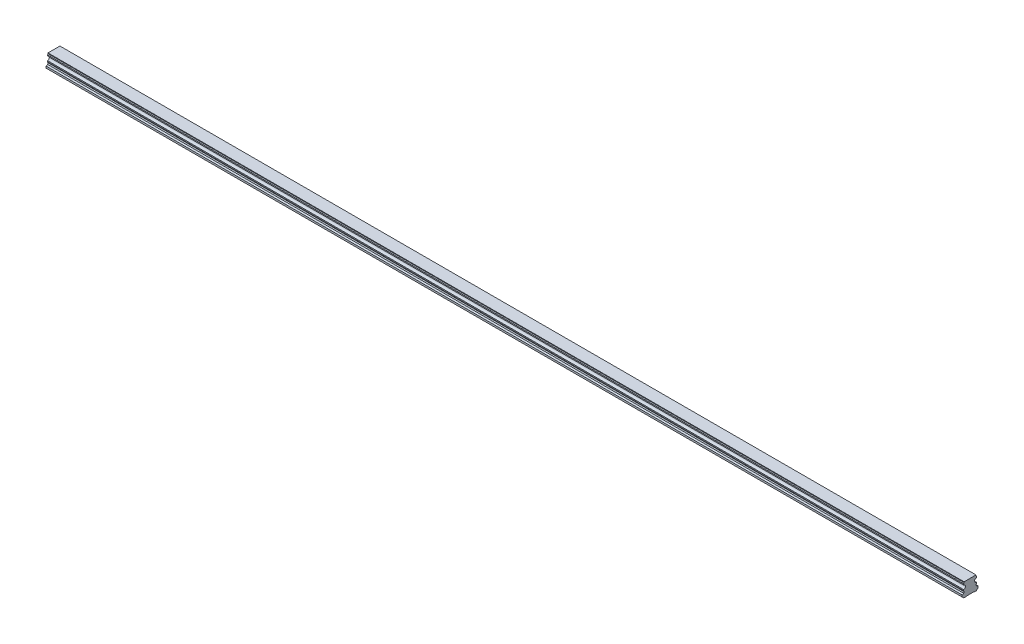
ISO-10303-21;
HEADER;
FILE_DESCRIPTION(('STEP AP214'),'2;1');
FILE_NAME('part.step','',(''),(''),'','','');
FILE_SCHEMA(('AUTOMOTIVE_DESIGN { 1 0 10303 214 1 1 1 1 }'));
ENDSEC;
DATA;
#1=APPLICATION_CONTEXT('core data for automotive mechanical design processes');
#2=APPLICATION_PROTOCOL_DEFINITION('international standard','automotive_design',2000,#1);
#3=PRODUCT_CONTEXT('',#1,'mechanical');
#4=PRODUCT('Part','Part','',(#3));
#5=PRODUCT_RELATED_PRODUCT_CATEGORY('part','',(#4));
#6=PRODUCT_DEFINITION_FORMATION('','',#4);
#7=PRODUCT_DEFINITION_CONTEXT('part definition',#1,'design');
#8=PRODUCT_DEFINITION('design','',#6,#7);
#9=PRODUCT_DEFINITION_SHAPE('','',#8);
#10=(LENGTH_UNIT() NAMED_UNIT(*) SI_UNIT(.MILLI.,.METRE.));
#11=(NAMED_UNIT(*) PLANE_ANGLE_UNIT() SI_UNIT($,.RADIAN.));
#12=(NAMED_UNIT(*) SI_UNIT($,.STERADIAN.) SOLID_ANGLE_UNIT());
#13=UNCERTAINTY_MEASURE_WITH_UNIT(LENGTH_MEASURE(1.E-05),#10,'distance_accuracy_value','');
#14=(GEOMETRIC_REPRESENTATION_CONTEXT(3) GLOBAL_UNCERTAINTY_ASSIGNED_CONTEXT((#13)) GLOBAL_UNIT_ASSIGNED_CONTEXT((#10,
#11,#12)) REPRESENTATION_CONTEXT('',''));
#15=CARTESIAN_POINT('',(0.,0.,0.));
#16=DIRECTION('',(0.,0.,1.));
#17=DIRECTION('',(1.,0.,0.));
#18=AXIS2_PLACEMENT_3D('',#15,#16,#17);
#19=CARTESIAN_POINT('',(1410.,0.499999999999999,0.));
#20=DIRECTION('',(0.,-1.,0.));
#21=DIRECTION('',(0.,0.,-1.));
#22=AXIS2_PLACEMENT_3D('',#19,#20,#21);
#23=CONICAL_SURFACE('',#22,3.5,0.785398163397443);
#24=CARTESIAN_POINT('',(1410.,1.00000000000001,0.));
#25=DIRECTION('',(0.,1.,0.));
#26=DIRECTION('',(0.,0.,1.));
#27=AXIS2_PLACEMENT_3D('',#24,#25,#26);
#28=CIRCLE('',#27,3.);
#29=CARTESIAN_POINT('',(1410.,1.00000000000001,3.));
#30=VERTEX_POINT('',#29);
#31=EDGE_CURVE('E11',#30,#30,#28,.F.);
#32=ORIENTED_EDGE('',*,*,#31,.F.);
#33=EDGE_LOOP('',(#32));
#34=FACE_BOUND('',#33,.T.);
#35=CARTESIAN_POINT('',(1410.,0.499999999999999,0.));
#36=DIRECTION('',(0.,1.,0.));
#37=DIRECTION('',(0.,0.,1.));
#38=AXIS2_PLACEMENT_3D('',#35,#36,#37);
#39=CIRCLE('',#38,3.5);
#40=CARTESIAN_POINT('',(1410.,0.5,3.5));
#41=VERTEX_POINT('',#40);
#42=EDGE_CURVE('E686',#41,#41,#39,.T.);
#43=ORIENTED_EDGE('',*,*,#42,.F.);
#44=EDGE_LOOP('',(#43));
#45=FACE_BOUND('',#44,.T.);
#46=ADVANCED_FACE('F39',(#34,#45),#23,.F.);
#47=CARTESIAN_POINT('',(1410.,12.,0.));
#48=DIRECTION('',(0.,-1.,0.));
#49=DIRECTION('',(0.,0.,-1.));
#50=AXIS2_PLACEMENT_3D('',#47,#48,#49);
#51=CYLINDRICAL_SURFACE('',#50,3.);
#52=ORIENTED_EDGE('',*,*,#31,.T.);
#53=EDGE_LOOP('',(#52));
#54=FACE_BOUND('',#53,.T.);
#55=CARTESIAN_POINT('',(1410.,12.,0.));
#56=DIRECTION('',(0.,-1.,0.));
#57=DIRECTION('',(0.,0.,-1.));
#58=AXIS2_PLACEMENT_3D('',#55,#56,#57);
#59=CIRCLE('',#58,3.);
#60=CARTESIAN_POINT('',(1410.,12.,-3.));
#61=VERTEX_POINT('',#60);
#62=EDGE_CURVE('E49',#61,#61,#59,.T.);
#63=ORIENTED_EDGE('',*,*,#62,.F.);
#64=EDGE_LOOP('',(#63));
#65=FACE_BOUND('',#64,.T.);
#66=ADVANCED_FACE('F969',(#54,#65),#51,.F.);
#67=CARTESIAN_POINT('',(1410.,12.,0.));
#68=DIRECTION('',(0.,-1.,0.));
#69=DIRECTION('',(0.,0.,-1.));
#70=AXIS2_PLACEMENT_3D('',#67,#68,#69);
#71=PLANE('',#70);
#72=CARTESIAN_POINT('',(1410.,12.,0.));
#73=DIRECTION('',(0.,-1.,0.));
#74=DIRECTION('',(0.,0.,-1.));
#75=AXIS2_PLACEMENT_3D('',#72,#73,#74);
#76=CIRCLE('',#75,2.5);
#77=CARTESIAN_POINT('',(1410.,12.,-2.5));
#78=VERTEX_POINT('',#77);
#79=EDGE_CURVE('E42',#78,#78,#76,.T.);
#80=ORIENTED_EDGE('',*,*,#79,.F.);
#81=EDGE_LOOP('',(#80));
#82=FACE_BOUND('',#81,.T.);
#83=ORIENTED_EDGE('',*,*,#62,.T.);
#84=EDGE_LOOP('',(#83));
#85=FACE_BOUND('',#84,.T.);
#86=ADVANCED_FACE('F974',(#82,#85),#71,.T.);
#87=CARTESIAN_POINT('',(1350.,0.499999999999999,0.));
#88=DIRECTION('',(0.,-1.,0.));
#89=DIRECTION('',(0.,0.,-1.));
#90=AXIS2_PLACEMENT_3D('',#87,#88,#89);
#91=CONICAL_SURFACE('',#90,3.5,0.785398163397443);
#92=CARTESIAN_POINT('',(1350.,1.00000000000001,0.));
#93=DIRECTION('',(0.,1.,0.));
#94=DIRECTION('',(0.,0.,1.));
#95=AXIS2_PLACEMENT_3D('',#92,#93,#94);
#96=CIRCLE('',#95,3.);
#97=CARTESIAN_POINT('',(1350.,1.00000000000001,3.));
#98=VERTEX_POINT('',#97);
#99=EDGE_CURVE('E682',#98,#98,#96,.F.);
#100=ORIENTED_EDGE('',*,*,#99,.F.);
#101=EDGE_LOOP('',(#100));
#102=FACE_BOUND('',#101,.T.);
#103=CARTESIAN_POINT('',(1350.,0.499999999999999,0.));
#104=DIRECTION('',(0.,1.,0.));
#105=DIRECTION('',(0.,0.,1.));
#106=AXIS2_PLACEMENT_3D('',#103,#104,#105);
#107=CIRCLE('',#106,3.5);
#108=CARTESIAN_POINT('',(1350.,0.5,3.5));
#109=VERTEX_POINT('',#108);
#110=EDGE_CURVE('E674',#109,#109,#107,.T.);
#111=ORIENTED_EDGE('',*,*,#110,.F.);
#112=EDGE_LOOP('',(#111));
#113=FACE_BOUND('',#112,.T.);
#114=ADVANCED_FACE('F1301',(#102,#113),#91,.F.);
#115=CARTESIAN_POINT('',(1350.,12.,0.));
#116=DIRECTION('',(0.,-1.,0.));
#117=DIRECTION('',(0.,0.,-1.));
#118=AXIS2_PLACEMENT_3D('',#115,#116,#117);
#119=CYLINDRICAL_SURFACE('',#118,3.);
#120=ORIENTED_EDGE('',*,*,#99,.T.);
#121=EDGE_LOOP('',(#120));
#122=FACE_BOUND('',#121,.T.);
#123=CARTESIAN_POINT('',(1350.,12.,0.));
#124=DIRECTION('',(0.,-1.,0.));
#125=DIRECTION('',(0.,0.,-1.));
#126=AXIS2_PLACEMENT_3D('',#123,#124,#125);
#127=CIRCLE('',#126,3.);
#128=CARTESIAN_POINT('',(1350.,12.,-3.));
#129=VERTEX_POINT('',#128);
#130=EDGE_CURVE('E678',#129,#129,#127,.T.);
#131=ORIENTED_EDGE('',*,*,#130,.F.);
#132=EDGE_LOOP('',(#131));
#133=FACE_BOUND('',#132,.T.);
#134=ADVANCED_FACE('F1297',(#122,#133),#119,.F.);
#135=CARTESIAN_POINT('',(1350.,12.,0.));
#136=DIRECTION('',(0.,-1.,0.));
#137=DIRECTION('',(0.,0.,-1.));
#138=AXIS2_PLACEMENT_3D('',#135,#136,#137);
#139=PLANE('',#138);
#140=CARTESIAN_POINT('',(1350.,12.,0.));
#141=DIRECTION('',(0.,-1.,0.));
#142=DIRECTION('',(0.,0.,-1.));
#143=AXIS2_PLACEMENT_3D('',#140,#141,#142);
#144=CIRCLE('',#143,2.5);
#145=CARTESIAN_POINT('',(1350.,12.,-2.5));
#146=VERTEX_POINT('',#145);
#147=EDGE_CURVE('E777',#146,#146,#144,.T.);
#148=ORIENTED_EDGE('',*,*,#147,.F.);
#149=EDGE_LOOP('',(#148));
#150=FACE_BOUND('',#149,.T.);
#151=ORIENTED_EDGE('',*,*,#130,.T.);
#152=EDGE_LOOP('',(#151));
#153=FACE_BOUND('',#152,.T.);
#154=ADVANCED_FACE('F1293',(#150,#153),#139,.T.);
#155=CARTESIAN_POINT('',(1290.,0.499999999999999,0.));
#156=DIRECTION('',(0.,-1.,0.));
#157=DIRECTION('',(0.,0.,-1.));
#158=AXIS2_PLACEMENT_3D('',#155,#156,#157);
#159=CONICAL_SURFACE('',#158,3.5,0.785398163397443);
#160=CARTESIAN_POINT('',(1290.,1.00000000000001,0.));
#161=DIRECTION('',(0.,1.,0.));
#162=DIRECTION('',(0.,0.,1.));
#163=AXIS2_PLACEMENT_3D('',#160,#161,#162);
#164=CIRCLE('',#163,3.);
#165=CARTESIAN_POINT('',(1290.,1.00000000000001,3.));
#166=VERTEX_POINT('',#165);
#167=EDGE_CURVE('E670',#166,#166,#164,.F.);
#168=ORIENTED_EDGE('',*,*,#167,.F.);
#169=EDGE_LOOP('',(#168));
#170=FACE_BOUND('',#169,.T.);
#171=CARTESIAN_POINT('',(1290.,0.499999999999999,0.));
#172=DIRECTION('',(0.,1.,0.));
#173=DIRECTION('',(0.,0.,1.));
#174=AXIS2_PLACEMENT_3D('',#171,#172,#173);
#175=CIRCLE('',#174,3.5);
#176=CARTESIAN_POINT('',(1290.,0.5,3.5));
#177=VERTEX_POINT('',#176);
#178=EDGE_CURVE('E662',#177,#177,#175,.T.);
#179=ORIENTED_EDGE('',*,*,#178,.F.);
#180=EDGE_LOOP('',(#179));
#181=FACE_BOUND('',#180,.T.);
#182=ADVANCED_FACE('F1289',(#170,#181),#159,.F.);
#183=CARTESIAN_POINT('',(1290.,12.,0.));
#184=DIRECTION('',(0.,-1.,0.));
#185=DIRECTION('',(0.,0.,-1.));
#186=AXIS2_PLACEMENT_3D('',#183,#184,#185);
#187=CYLINDRICAL_SURFACE('',#186,3.);
#188=ORIENTED_EDGE('',*,*,#167,.T.);
#189=EDGE_LOOP('',(#188));
#190=FACE_BOUND('',#189,.T.);
#191=CARTESIAN_POINT('',(1290.,12.,0.));
#192=DIRECTION('',(0.,-1.,0.));
#193=DIRECTION('',(0.,0.,-1.));
#194=AXIS2_PLACEMENT_3D('',#191,#192,#193);
#195=CIRCLE('',#194,3.);
#196=CARTESIAN_POINT('',(1290.,12.,-3.));
#197=VERTEX_POINT('',#196);
#198=EDGE_CURVE('E666',#197,#197,#195,.T.);
#199=ORIENTED_EDGE('',*,*,#198,.F.);
#200=EDGE_LOOP('',(#199));
#201=FACE_BOUND('',#200,.T.);
#202=ADVANCED_FACE('F1285',(#190,#201),#187,.F.);
#203=CARTESIAN_POINT('',(1290.,12.,0.));
#204=DIRECTION('',(0.,-1.,0.));
#205=DIRECTION('',(0.,0.,-1.));
#206=AXIS2_PLACEMENT_3D('',#203,#204,#205);
#207=PLANE('',#206);
#208=CARTESIAN_POINT('',(1290.,12.,0.));
#209=DIRECTION('',(0.,-1.,0.));
#210=DIRECTION('',(0.,0.,-1.));
#211=AXIS2_PLACEMENT_3D('',#208,#209,#210);
#212=CIRCLE('',#211,2.5);
#213=CARTESIAN_POINT('',(1290.,12.,-2.5));
#214=VERTEX_POINT('',#213);
#215=EDGE_CURVE('E774',#214,#214,#212,.T.);
#216=ORIENTED_EDGE('',*,*,#215,.F.);
#217=EDGE_LOOP('',(#216));
#218=FACE_BOUND('',#217,.T.);
#219=ORIENTED_EDGE('',*,*,#198,.T.);
#220=EDGE_LOOP('',(#219));
#221=FACE_BOUND('',#220,.T.);
#222=ADVANCED_FACE('F1281',(#218,#221),#207,.T.);
#223=CARTESIAN_POINT('',(1230.,0.499999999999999,0.));
#224=DIRECTION('',(0.,-1.,0.));
#225=DIRECTION('',(0.,0.,-1.));
#226=AXIS2_PLACEMENT_3D('',#223,#224,#225);
#227=CONICAL_SURFACE('',#226,3.5,0.785398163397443);
#228=CARTESIAN_POINT('',(1230.,1.00000000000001,0.));
#229=DIRECTION('',(0.,1.,0.));
#230=DIRECTION('',(0.,0.,1.));
#231=AXIS2_PLACEMENT_3D('',#228,#229,#230);
#232=CIRCLE('',#231,3.);
#233=CARTESIAN_POINT('',(1230.,1.00000000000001,3.));
#234=VERTEX_POINT('',#233);
#235=EDGE_CURVE('E658',#234,#234,#232,.F.);
#236=ORIENTED_EDGE('',*,*,#235,.F.);
#237=EDGE_LOOP('',(#236));
#238=FACE_BOUND('',#237,.T.);
#239=CARTESIAN_POINT('',(1230.,0.499999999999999,0.));
#240=DIRECTION('',(0.,1.,0.));
#241=DIRECTION('',(0.,0.,1.));
#242=AXIS2_PLACEMENT_3D('',#239,#240,#241);
#243=CIRCLE('',#242,3.5);
#244=CARTESIAN_POINT('',(1230.,0.5,3.5));
#245=VERTEX_POINT('',#244);
#246=EDGE_CURVE('E650',#245,#245,#243,.T.);
#247=ORIENTED_EDGE('',*,*,#246,.F.);
#248=EDGE_LOOP('',(#247));
#249=FACE_BOUND('',#248,.T.);
#250=ADVANCED_FACE('F1277',(#238,#249),#227,.F.);
#251=CARTESIAN_POINT('',(1230.,12.,0.));
#252=DIRECTION('',(0.,-1.,0.));
#253=DIRECTION('',(0.,0.,-1.));
#254=AXIS2_PLACEMENT_3D('',#251,#252,#253);
#255=CYLINDRICAL_SURFACE('',#254,3.);
#256=ORIENTED_EDGE('',*,*,#235,.T.);
#257=EDGE_LOOP('',(#256));
#258=FACE_BOUND('',#257,.T.);
#259=CARTESIAN_POINT('',(1230.,12.,0.));
#260=DIRECTION('',(0.,-1.,0.));
#261=DIRECTION('',(0.,0.,-1.));
#262=AXIS2_PLACEMENT_3D('',#259,#260,#261);
#263=CIRCLE('',#262,3.);
#264=CARTESIAN_POINT('',(1230.,12.,-3.));
#265=VERTEX_POINT('',#264);
#266=EDGE_CURVE('E654',#265,#265,#263,.T.);
#267=ORIENTED_EDGE('',*,*,#266,.F.);
#268=EDGE_LOOP('',(#267));
#269=FACE_BOUND('',#268,.T.);
#270=ADVANCED_FACE('F1273',(#258,#269),#255,.F.);
#271=CARTESIAN_POINT('',(1230.,12.,0.));
#272=DIRECTION('',(0.,-1.,0.));
#273=DIRECTION('',(0.,0.,-1.));
#274=AXIS2_PLACEMENT_3D('',#271,#272,#273);
#275=PLANE('',#274);
#276=CARTESIAN_POINT('',(1230.,12.,0.));
#277=DIRECTION('',(0.,-1.,0.));
#278=DIRECTION('',(0.,0.,-1.));
#279=AXIS2_PLACEMENT_3D('',#276,#277,#278);
#280=CIRCLE('',#279,2.5);
#281=CARTESIAN_POINT('',(1230.,12.,-2.5));
#282=VERTEX_POINT('',#281);
#283=EDGE_CURVE('E770',#282,#282,#280,.T.);
#284=ORIENTED_EDGE('',*,*,#283,.F.);
#285=EDGE_LOOP('',(#284));
#286=FACE_BOUND('',#285,.T.);
#287=ORIENTED_EDGE('',*,*,#266,.T.);
#288=EDGE_LOOP('',(#287));
#289=FACE_BOUND('',#288,.T.);
#290=ADVANCED_FACE('F1269',(#286,#289),#275,.T.);
#291=CARTESIAN_POINT('',(1170.,0.499999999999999,0.));
#292=DIRECTION('',(0.,-1.,0.));
#293=DIRECTION('',(0.,0.,-1.));
#294=AXIS2_PLACEMENT_3D('',#291,#292,#293);
#295=CONICAL_SURFACE('',#294,3.5,0.785398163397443);
#296=CARTESIAN_POINT('',(1170.,1.00000000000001,0.));
#297=DIRECTION('',(0.,1.,0.));
#298=DIRECTION('',(0.,0.,1.));
#299=AXIS2_PLACEMENT_3D('',#296,#297,#298);
#300=CIRCLE('',#299,3.);
#301=CARTESIAN_POINT('',(1170.,1.00000000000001,3.));
#302=VERTEX_POINT('',#301);
#303=EDGE_CURVE('E646',#302,#302,#300,.F.);
#304=ORIENTED_EDGE('',*,*,#303,.F.);
#305=EDGE_LOOP('',(#304));
#306=FACE_BOUND('',#305,.T.);
#307=CARTESIAN_POINT('',(1170.,0.499999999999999,0.));
#308=DIRECTION('',(0.,1.,0.));
#309=DIRECTION('',(0.,0.,1.));
#310=AXIS2_PLACEMENT_3D('',#307,#308,#309);
#311=CIRCLE('',#310,3.5);
#312=CARTESIAN_POINT('',(1170.,0.5,3.5));
#313=VERTEX_POINT('',#312);
#314=EDGE_CURVE('E638',#313,#313,#311,.T.);
#315=ORIENTED_EDGE('',*,*,#314,.F.);
#316=EDGE_LOOP('',(#315));
#317=FACE_BOUND('',#316,.T.);
#318=ADVANCED_FACE('F1265',(#306,#317),#295,.F.);
#319=CARTESIAN_POINT('',(1170.,12.,0.));
#320=DIRECTION('',(0.,-1.,0.));
#321=DIRECTION('',(0.,0.,-1.));
#322=AXIS2_PLACEMENT_3D('',#319,#320,#321);
#323=CYLINDRICAL_SURFACE('',#322,3.);
#324=ORIENTED_EDGE('',*,*,#303,.T.);
#325=EDGE_LOOP('',(#324));
#326=FACE_BOUND('',#325,.T.);
#327=CARTESIAN_POINT('',(1170.,12.,0.));
#328=DIRECTION('',(0.,-1.,0.));
#329=DIRECTION('',(0.,0.,-1.));
#330=AXIS2_PLACEMENT_3D('',#327,#328,#329);
#331=CIRCLE('',#330,3.);
#332=CARTESIAN_POINT('',(1170.,12.,-3.));
#333=VERTEX_POINT('',#332);
#334=EDGE_CURVE('E642',#333,#333,#331,.T.);
#335=ORIENTED_EDGE('',*,*,#334,.F.);
#336=EDGE_LOOP('',(#335));
#337=FACE_BOUND('',#336,.T.);
#338=ADVANCED_FACE('F1261',(#326,#337),#323,.F.);
#339=CARTESIAN_POINT('',(1170.,12.,0.));
#340=DIRECTION('',(0.,-1.,0.));
#341=DIRECTION('',(0.,0.,-1.));
#342=AXIS2_PLACEMENT_3D('',#339,#340,#341);
#343=PLANE('',#342);
#344=CARTESIAN_POINT('',(1170.,12.,0.));
#345=DIRECTION('',(0.,-1.,0.));
#346=DIRECTION('',(0.,0.,-1.));
#347=AXIS2_PLACEMENT_3D('',#344,#345,#346);
#348=CIRCLE('',#347,2.5);
#349=CARTESIAN_POINT('',(1170.,12.,-2.5));
#350=VERTEX_POINT('',#349);
#351=EDGE_CURVE('E766',#350,#350,#348,.T.);
#352=ORIENTED_EDGE('',*,*,#351,.F.);
#353=EDGE_LOOP('',(#352));
#354=FACE_BOUND('',#353,.T.);
#355=ORIENTED_EDGE('',*,*,#334,.T.);
#356=EDGE_LOOP('',(#355));
#357=FACE_BOUND('',#356,.T.);
#358=ADVANCED_FACE('F1257',(#354,#357),#343,.T.);
#359=CARTESIAN_POINT('',(1110.,0.499999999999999,0.));
#360=DIRECTION('',(0.,-1.,0.));
#361=DIRECTION('',(0.,0.,-1.));
#362=AXIS2_PLACEMENT_3D('',#359,#360,#361);
#363=CONICAL_SURFACE('',#362,3.5,0.785398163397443);
#364=CARTESIAN_POINT('',(1110.,1.00000000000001,0.));
#365=DIRECTION('',(0.,1.,0.));
#366=DIRECTION('',(0.,0.,1.));
#367=AXIS2_PLACEMENT_3D('',#364,#365,#366);
#368=CIRCLE('',#367,3.);
#369=CARTESIAN_POINT('',(1110.,1.00000000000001,3.));
#370=VERTEX_POINT('',#369);
#371=EDGE_CURVE('E634',#370,#370,#368,.F.);
#372=ORIENTED_EDGE('',*,*,#371,.F.);
#373=EDGE_LOOP('',(#372));
#374=FACE_BOUND('',#373,.T.);
#375=CARTESIAN_POINT('',(1110.,0.499999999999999,0.));
#376=DIRECTION('',(0.,1.,0.));
#377=DIRECTION('',(0.,0.,1.));
#378=AXIS2_PLACEMENT_3D('',#375,#376,#377);
#379=CIRCLE('',#378,3.5);
#380=CARTESIAN_POINT('',(1110.,0.5,3.5));
#381=VERTEX_POINT('',#380);
#382=EDGE_CURVE('E626',#381,#381,#379,.T.);
#383=ORIENTED_EDGE('',*,*,#382,.F.);
#384=EDGE_LOOP('',(#383));
#385=FACE_BOUND('',#384,.T.);
#386=ADVANCED_FACE('F1253',(#374,#385),#363,.F.);
#387=CARTESIAN_POINT('',(1110.,12.,0.));
#388=DIRECTION('',(0.,-1.,0.));
#389=DIRECTION('',(0.,0.,-1.));
#390=AXIS2_PLACEMENT_3D('',#387,#388,#389);
#391=CYLINDRICAL_SURFACE('',#390,3.);
#392=ORIENTED_EDGE('',*,*,#371,.T.);
#393=EDGE_LOOP('',(#392));
#394=FACE_BOUND('',#393,.T.);
#395=CARTESIAN_POINT('',(1110.,12.,0.));
#396=DIRECTION('',(0.,-1.,0.));
#397=DIRECTION('',(0.,0.,-1.));
#398=AXIS2_PLACEMENT_3D('',#395,#396,#397);
#399=CIRCLE('',#398,3.);
#400=CARTESIAN_POINT('',(1110.,12.,-3.));
#401=VERTEX_POINT('',#400);
#402=EDGE_CURVE('E630',#401,#401,#399,.T.);
#403=ORIENTED_EDGE('',*,*,#402,.F.);
#404=EDGE_LOOP('',(#403));
#405=FACE_BOUND('',#404,.T.);
#406=ADVANCED_FACE('F1249',(#394,#405),#391,.F.);
#407=CARTESIAN_POINT('',(1110.,12.,0.));
#408=DIRECTION('',(0.,-1.,0.));
#409=DIRECTION('',(0.,0.,-1.));
#410=AXIS2_PLACEMENT_3D('',#407,#408,#409);
#411=PLANE('',#410);
#412=CARTESIAN_POINT('',(1110.,12.,0.));
#413=DIRECTION('',(0.,-1.,0.));
#414=DIRECTION('',(0.,0.,-1.));
#415=AXIS2_PLACEMENT_3D('',#412,#413,#414);
#416=CIRCLE('',#415,2.5);
#417=CARTESIAN_POINT('',(1110.,12.,-2.5));
#418=VERTEX_POINT('',#417);
#419=EDGE_CURVE('E762',#418,#418,#416,.T.);
#420=ORIENTED_EDGE('',*,*,#419,.F.);
#421=EDGE_LOOP('',(#420));
#422=FACE_BOUND('',#421,.T.);
#423=ORIENTED_EDGE('',*,*,#402,.T.);
#424=EDGE_LOOP('',(#423));
#425=FACE_BOUND('',#424,.T.);
#426=ADVANCED_FACE('F1245',(#422,#425),#411,.T.);
#427=CARTESIAN_POINT('',(1050.,0.499999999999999,0.));
#428=DIRECTION('',(0.,-1.,0.));
#429=DIRECTION('',(0.,0.,-1.));
#430=AXIS2_PLACEMENT_3D('',#427,#428,#429);
#431=CONICAL_SURFACE('',#430,3.5,0.785398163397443);
#432=CARTESIAN_POINT('',(1050.,1.00000000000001,0.));
#433=DIRECTION('',(0.,1.,0.));
#434=DIRECTION('',(0.,0.,1.));
#435=AXIS2_PLACEMENT_3D('',#432,#433,#434);
#436=CIRCLE('',#435,3.);
#437=CARTESIAN_POINT('',(1050.,1.00000000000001,3.));
#438=VERTEX_POINT('',#437);
#439=EDGE_CURVE('E622',#438,#438,#436,.F.);
#440=ORIENTED_EDGE('',*,*,#439,.F.);
#441=EDGE_LOOP('',(#440));
#442=FACE_BOUND('',#441,.T.);
#443=CARTESIAN_POINT('',(1050.,0.499999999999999,0.));
#444=DIRECTION('',(0.,1.,0.));
#445=DIRECTION('',(0.,0.,1.));
#446=AXIS2_PLACEMENT_3D('',#443,#444,#445);
#447=CIRCLE('',#446,3.5);
#448=CARTESIAN_POINT('',(1050.,0.5,3.5));
#449=VERTEX_POINT('',#448);
#450=EDGE_CURVE('E614',#449,#449,#447,.T.);
#451=ORIENTED_EDGE('',*,*,#450,.F.);
#452=EDGE_LOOP('',(#451));
#453=FACE_BOUND('',#452,.T.);
#454=ADVANCED_FACE('F1241',(#442,#453),#431,.F.);
#455=CARTESIAN_POINT('',(1050.,12.,0.));
#456=DIRECTION('',(0.,-1.,0.));
#457=DIRECTION('',(0.,0.,-1.));
#458=AXIS2_PLACEMENT_3D('',#455,#456,#457);
#459=CYLINDRICAL_SURFACE('',#458,3.);
#460=ORIENTED_EDGE('',*,*,#439,.T.);
#461=EDGE_LOOP('',(#460));
#462=FACE_BOUND('',#461,.T.);
#463=CARTESIAN_POINT('',(1050.,12.,0.));
#464=DIRECTION('',(0.,-1.,0.));
#465=DIRECTION('',(0.,0.,-1.));
#466=AXIS2_PLACEMENT_3D('',#463,#464,#465);
#467=CIRCLE('',#466,3.);
#468=CARTESIAN_POINT('',(1050.,12.,-3.));
#469=VERTEX_POINT('',#468);
#470=EDGE_CURVE('E618',#469,#469,#467,.T.);
#471=ORIENTED_EDGE('',*,*,#470,.F.);
#472=EDGE_LOOP('',(#471));
#473=FACE_BOUND('',#472,.T.);
#474=ADVANCED_FACE('F1237',(#462,#473),#459,.F.);
#475=CARTESIAN_POINT('',(1050.,12.,0.));
#476=DIRECTION('',(0.,-1.,0.));
#477=DIRECTION('',(0.,0.,-1.));
#478=AXIS2_PLACEMENT_3D('',#475,#476,#477);
#479=PLANE('',#478);
#480=CARTESIAN_POINT('',(1050.,12.,0.));
#481=DIRECTION('',(0.,-1.,0.));
#482=DIRECTION('',(0.,0.,-1.));
#483=AXIS2_PLACEMENT_3D('',#480,#481,#482);
#484=CIRCLE('',#483,2.5);
#485=CARTESIAN_POINT('',(1050.,12.,-2.5));
#486=VERTEX_POINT('',#485);
#487=EDGE_CURVE('E758',#486,#486,#484,.T.);
#488=ORIENTED_EDGE('',*,*,#487,.F.);
#489=EDGE_LOOP('',(#488));
#490=FACE_BOUND('',#489,.T.);
#491=ORIENTED_EDGE('',*,*,#470,.T.);
#492=EDGE_LOOP('',(#491));
#493=FACE_BOUND('',#492,.T.);
#494=ADVANCED_FACE('F1233',(#490,#493),#479,.T.);
#495=CARTESIAN_POINT('',(990.,0.499999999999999,0.));
#496=DIRECTION('',(0.,-1.,0.));
#497=DIRECTION('',(0.,0.,-1.));
#498=AXIS2_PLACEMENT_3D('',#495,#496,#497);
#499=CONICAL_SURFACE('',#498,3.5,0.785398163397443);
#500=CARTESIAN_POINT('',(990.,1.00000000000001,0.));
#501=DIRECTION('',(0.,1.,0.));
#502=DIRECTION('',(0.,0.,1.));
#503=AXIS2_PLACEMENT_3D('',#500,#501,#502);
#504=CIRCLE('',#503,3.);
#505=CARTESIAN_POINT('',(990.,1.00000000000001,3.));
#506=VERTEX_POINT('',#505);
#507=EDGE_CURVE('E610',#506,#506,#504,.F.);
#508=ORIENTED_EDGE('',*,*,#507,.F.);
#509=EDGE_LOOP('',(#508));
#510=FACE_BOUND('',#509,.T.);
#511=CARTESIAN_POINT('',(990.,0.499999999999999,0.));
#512=DIRECTION('',(0.,1.,0.));
#513=DIRECTION('',(0.,0.,1.));
#514=AXIS2_PLACEMENT_3D('',#511,#512,#513);
#515=CIRCLE('',#514,3.5);
#516=CARTESIAN_POINT('',(990.,0.5,3.5));
#517=VERTEX_POINT('',#516);
#518=EDGE_CURVE('E602',#517,#517,#515,.T.);
#519=ORIENTED_EDGE('',*,*,#518,.F.);
#520=EDGE_LOOP('',(#519));
#521=FACE_BOUND('',#520,.T.);
#522=ADVANCED_FACE('F1229',(#510,#521),#499,.F.);
#523=CARTESIAN_POINT('',(990.,12.,0.));
#524=DIRECTION('',(0.,-1.,0.));
#525=DIRECTION('',(0.,0.,-1.));
#526=AXIS2_PLACEMENT_3D('',#523,#524,#525);
#527=CYLINDRICAL_SURFACE('',#526,3.);
#528=ORIENTED_EDGE('',*,*,#507,.T.);
#529=EDGE_LOOP('',(#528));
#530=FACE_BOUND('',#529,.T.);
#531=CARTESIAN_POINT('',(990.,12.,0.));
#532=DIRECTION('',(0.,-1.,0.));
#533=DIRECTION('',(0.,0.,-1.));
#534=AXIS2_PLACEMENT_3D('',#531,#532,#533);
#535=CIRCLE('',#534,3.);
#536=CARTESIAN_POINT('',(990.,12.,-3.));
#537=VERTEX_POINT('',#536);
#538=EDGE_CURVE('E606',#537,#537,#535,.T.);
#539=ORIENTED_EDGE('',*,*,#538,.F.);
#540=EDGE_LOOP('',(#539));
#541=FACE_BOUND('',#540,.T.);
#542=ADVANCED_FACE('F1225',(#530,#541),#527,.F.);
#543=CARTESIAN_POINT('',(990.,12.,0.));
#544=DIRECTION('',(0.,-1.,0.));
#545=DIRECTION('',(0.,0.,-1.));
#546=AXIS2_PLACEMENT_3D('',#543,#544,#545);
#547=PLANE('',#546);
#548=CARTESIAN_POINT('',(990.,12.,0.));
#549=DIRECTION('',(0.,-1.,0.));
#550=DIRECTION('',(0.,0.,-1.));
#551=AXIS2_PLACEMENT_3D('',#548,#549,#550);
#552=CIRCLE('',#551,2.5);
#553=CARTESIAN_POINT('',(990.,12.,-2.5));
#554=VERTEX_POINT('',#553);
#555=EDGE_CURVE('E754',#554,#554,#552,.T.);
#556=ORIENTED_EDGE('',*,*,#555,.F.);
#557=EDGE_LOOP('',(#556));
#558=FACE_BOUND('',#557,.T.);
#559=ORIENTED_EDGE('',*,*,#538,.T.);
#560=EDGE_LOOP('',(#559));
#561=FACE_BOUND('',#560,.T.);
#562=ADVANCED_FACE('F1221',(#558,#561),#547,.T.);
#563=CARTESIAN_POINT('',(930.,0.499999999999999,0.));
#564=DIRECTION('',(0.,-1.,0.));
#565=DIRECTION('',(0.,0.,-1.));
#566=AXIS2_PLACEMENT_3D('',#563,#564,#565);
#567=CONICAL_SURFACE('',#566,3.5,0.785398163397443);
#568=CARTESIAN_POINT('',(930.,1.00000000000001,0.));
#569=DIRECTION('',(0.,1.,0.));
#570=DIRECTION('',(0.,0.,1.));
#571=AXIS2_PLACEMENT_3D('',#568,#569,#570);
#572=CIRCLE('',#571,3.);
#573=CARTESIAN_POINT('',(930.,1.00000000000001,3.));
#574=VERTEX_POINT('',#573);
#575=EDGE_CURVE('E598',#574,#574,#572,.F.);
#576=ORIENTED_EDGE('',*,*,#575,.F.);
#577=EDGE_LOOP('',(#576));
#578=FACE_BOUND('',#577,.T.);
#579=CARTESIAN_POINT('',(930.,0.499999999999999,0.));
#580=DIRECTION('',(0.,1.,0.));
#581=DIRECTION('',(0.,0.,1.));
#582=AXIS2_PLACEMENT_3D('',#579,#580,#581);
#583=CIRCLE('',#582,3.5);
#584=CARTESIAN_POINT('',(930.,0.5,3.5));
#585=VERTEX_POINT('',#584);
#586=EDGE_CURVE('E590',#585,#585,#583,.T.);
#587=ORIENTED_EDGE('',*,*,#586,.F.);
#588=EDGE_LOOP('',(#587));
#589=FACE_BOUND('',#588,.T.);
#590=ADVANCED_FACE('F1217',(#578,#589),#567,.F.);
#591=CARTESIAN_POINT('',(930.,12.,0.));
#592=DIRECTION('',(0.,-1.,0.));
#593=DIRECTION('',(0.,0.,-1.));
#594=AXIS2_PLACEMENT_3D('',#591,#592,#593);
#595=CYLINDRICAL_SURFACE('',#594,3.);
#596=ORIENTED_EDGE('',*,*,#575,.T.);
#597=EDGE_LOOP('',(#596));
#598=FACE_BOUND('',#597,.T.);
#599=CARTESIAN_POINT('',(930.,12.,0.));
#600=DIRECTION('',(0.,-1.,0.));
#601=DIRECTION('',(0.,0.,-1.));
#602=AXIS2_PLACEMENT_3D('',#599,#600,#601);
#603=CIRCLE('',#602,3.);
#604=CARTESIAN_POINT('',(930.,12.,-3.));
#605=VERTEX_POINT('',#604);
#606=EDGE_CURVE('E594',#605,#605,#603,.T.);
#607=ORIENTED_EDGE('',*,*,#606,.F.);
#608=EDGE_LOOP('',(#607));
#609=FACE_BOUND('',#608,.T.);
#610=ADVANCED_FACE('F1213',(#598,#609),#595,.F.);
#611=CARTESIAN_POINT('',(930.,12.,0.));
#612=DIRECTION('',(0.,-1.,0.));
#613=DIRECTION('',(0.,0.,-1.));
#614=AXIS2_PLACEMENT_3D('',#611,#612,#613);
#615=PLANE('',#614);
#616=CARTESIAN_POINT('',(930.,12.,0.));
#617=DIRECTION('',(0.,-1.,0.));
#618=DIRECTION('',(0.,0.,-1.));
#619=AXIS2_PLACEMENT_3D('',#616,#617,#618);
#620=CIRCLE('',#619,2.5);
#621=CARTESIAN_POINT('',(930.,12.,-2.5));
#622=VERTEX_POINT('',#621);
#623=EDGE_CURVE('E750',#622,#622,#620,.T.);
#624=ORIENTED_EDGE('',*,*,#623,.F.);
#625=EDGE_LOOP('',(#624));
#626=FACE_BOUND('',#625,.T.);
#627=ORIENTED_EDGE('',*,*,#606,.T.);
#628=EDGE_LOOP('',(#627));
#629=FACE_BOUND('',#628,.T.);
#630=ADVANCED_FACE('F1209',(#626,#629),#615,.T.);
#631=CARTESIAN_POINT('',(870.,0.499999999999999,0.));
#632=DIRECTION('',(0.,-1.,0.));
#633=DIRECTION('',(0.,0.,-1.));
#634=AXIS2_PLACEMENT_3D('',#631,#632,#633);
#635=CONICAL_SURFACE('',#634,3.5,0.785398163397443);
#636=CARTESIAN_POINT('',(870.,1.00000000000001,0.));
#637=DIRECTION('',(0.,1.,0.));
#638=DIRECTION('',(0.,0.,1.));
#639=AXIS2_PLACEMENT_3D('',#636,#637,#638);
#640=CIRCLE('',#639,3.);
#641=CARTESIAN_POINT('',(870.,1.00000000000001,3.));
#642=VERTEX_POINT('',#641);
#643=EDGE_CURVE('E586',#642,#642,#640,.F.);
#644=ORIENTED_EDGE('',*,*,#643,.F.);
#645=EDGE_LOOP('',(#644));
#646=FACE_BOUND('',#645,.T.);
#647=CARTESIAN_POINT('',(870.,0.499999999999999,0.));
#648=DIRECTION('',(0.,1.,0.));
#649=DIRECTION('',(0.,0.,1.));
#650=AXIS2_PLACEMENT_3D('',#647,#648,#649);
#651=CIRCLE('',#650,3.5);
#652=CARTESIAN_POINT('',(870.,0.5,3.5));
#653=VERTEX_POINT('',#652);
#654=EDGE_CURVE('E578',#653,#653,#651,.T.);
#655=ORIENTED_EDGE('',*,*,#654,.F.);
#656=EDGE_LOOP('',(#655));
#657=FACE_BOUND('',#656,.T.);
#658=ADVANCED_FACE('F1205',(#646,#657),#635,.F.);
#659=CARTESIAN_POINT('',(870.,12.,0.));
#660=DIRECTION('',(0.,-1.,0.));
#661=DIRECTION('',(0.,0.,-1.));
#662=AXIS2_PLACEMENT_3D('',#659,#660,#661);
#663=CYLINDRICAL_SURFACE('',#662,3.);
#664=ORIENTED_EDGE('',*,*,#643,.T.);
#665=EDGE_LOOP('',(#664));
#666=FACE_BOUND('',#665,.T.);
#667=CARTESIAN_POINT('',(870.,12.,0.));
#668=DIRECTION('',(0.,-1.,0.));
#669=DIRECTION('',(0.,0.,-1.));
#670=AXIS2_PLACEMENT_3D('',#667,#668,#669);
#671=CIRCLE('',#670,3.);
#672=CARTESIAN_POINT('',(870.,12.,-3.));
#673=VERTEX_POINT('',#672);
#674=EDGE_CURVE('E582',#673,#673,#671,.T.);
#675=ORIENTED_EDGE('',*,*,#674,.F.);
#676=EDGE_LOOP('',(#675));
#677=FACE_BOUND('',#676,.T.);
#678=ADVANCED_FACE('F1201',(#666,#677),#663,.F.);
#679=CARTESIAN_POINT('',(870.,12.,0.));
#680=DIRECTION('',(0.,-1.,0.));
#681=DIRECTION('',(0.,0.,-1.));
#682=AXIS2_PLACEMENT_3D('',#679,#680,#681);
#683=PLANE('',#682);
#684=CARTESIAN_POINT('',(870.,12.,0.));
#685=DIRECTION('',(0.,-1.,0.));
#686=DIRECTION('',(0.,0.,-1.));
#687=AXIS2_PLACEMENT_3D('',#684,#685,#686);
#688=CIRCLE('',#687,2.5);
#689=CARTESIAN_POINT('',(870.,12.,-2.5));
#690=VERTEX_POINT('',#689);
#691=EDGE_CURVE('E746',#690,#690,#688,.T.);
#692=ORIENTED_EDGE('',*,*,#691,.F.);
#693=EDGE_LOOP('',(#692));
#694=FACE_BOUND('',#693,.T.);
#695=ORIENTED_EDGE('',*,*,#674,.T.);
#696=EDGE_LOOP('',(#695));
#697=FACE_BOUND('',#696,.T.);
#698=ADVANCED_FACE('F1197',(#694,#697),#683,.T.);
#699=CARTESIAN_POINT('',(810.,0.499999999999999,0.));
#700=DIRECTION('',(0.,-1.,0.));
#701=DIRECTION('',(0.,0.,-1.));
#702=AXIS2_PLACEMENT_3D('',#699,#700,#701);
#703=CONICAL_SURFACE('',#702,3.5,0.785398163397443);
#704=CARTESIAN_POINT('',(810.,1.00000000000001,0.));
#705=DIRECTION('',(0.,1.,0.));
#706=DIRECTION('',(0.,0.,1.));
#707=AXIS2_PLACEMENT_3D('',#704,#705,#706);
#708=CIRCLE('',#707,3.);
#709=CARTESIAN_POINT('',(810.,1.00000000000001,3.));
#710=VERTEX_POINT('',#709);
#711=EDGE_CURVE('E574',#710,#710,#708,.F.);
#712=ORIENTED_EDGE('',*,*,#711,.F.);
#713=EDGE_LOOP('',(#712));
#714=FACE_BOUND('',#713,.T.);
#715=CARTESIAN_POINT('',(810.,0.499999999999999,0.));
#716=DIRECTION('',(0.,1.,0.));
#717=DIRECTION('',(0.,0.,1.));
#718=AXIS2_PLACEMENT_3D('',#715,#716,#717);
#719=CIRCLE('',#718,3.5);
#720=CARTESIAN_POINT('',(810.,0.5,3.5));
#721=VERTEX_POINT('',#720);
#722=EDGE_CURVE('E566',#721,#721,#719,.T.);
#723=ORIENTED_EDGE('',*,*,#722,.F.);
#724=EDGE_LOOP('',(#723));
#725=FACE_BOUND('',#724,.T.);
#726=ADVANCED_FACE('F1193',(#714,#725),#703,.F.);
#727=CARTESIAN_POINT('',(810.,12.,0.));
#728=DIRECTION('',(0.,-1.,0.));
#729=DIRECTION('',(0.,0.,-1.));
#730=AXIS2_PLACEMENT_3D('',#727,#728,#729);
#731=CYLINDRICAL_SURFACE('',#730,3.);
#732=ORIENTED_EDGE('',*,*,#711,.T.);
#733=EDGE_LOOP('',(#732));
#734=FACE_BOUND('',#733,.T.);
#735=CARTESIAN_POINT('',(810.,12.,0.));
#736=DIRECTION('',(0.,-1.,0.));
#737=DIRECTION('',(0.,0.,-1.));
#738=AXIS2_PLACEMENT_3D('',#735,#736,#737);
#739=CIRCLE('',#738,3.);
#740=CARTESIAN_POINT('',(810.,12.,-3.));
#741=VERTEX_POINT('',#740);
#742=EDGE_CURVE('E570',#741,#741,#739,.T.);
#743=ORIENTED_EDGE('',*,*,#742,.F.);
#744=EDGE_LOOP('',(#743));
#745=FACE_BOUND('',#744,.T.);
#746=ADVANCED_FACE('F1189',(#734,#745),#731,.F.);
#747=CARTESIAN_POINT('',(810.,12.,0.));
#748=DIRECTION('',(0.,-1.,0.));
#749=DIRECTION('',(0.,0.,-1.));
#750=AXIS2_PLACEMENT_3D('',#747,#748,#749);
#751=PLANE('',#750);
#752=CARTESIAN_POINT('',(810.,12.,0.));
#753=DIRECTION('',(0.,-1.,0.));
#754=DIRECTION('',(0.,0.,-1.));
#755=AXIS2_PLACEMENT_3D('',#752,#753,#754);
#756=CIRCLE('',#755,2.5);
#757=CARTESIAN_POINT('',(810.,12.,-2.5));
#758=VERTEX_POINT('',#757);
#759=EDGE_CURVE('E742',#758,#758,#756,.T.);
#760=ORIENTED_EDGE('',*,*,#759,.F.);
#761=EDGE_LOOP('',(#760));
#762=FACE_BOUND('',#761,.T.);
#763=ORIENTED_EDGE('',*,*,#742,.T.);
#764=EDGE_LOOP('',(#763));
#765=FACE_BOUND('',#764,.T.);
#766=ADVANCED_FACE('F1185',(#762,#765),#751,.T.);
#767=CARTESIAN_POINT('',(750.,0.499999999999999,0.));
#768=DIRECTION('',(0.,-1.,0.));
#769=DIRECTION('',(0.,0.,-1.));
#770=AXIS2_PLACEMENT_3D('',#767,#768,#769);
#771=CONICAL_SURFACE('',#770,3.5,0.785398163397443);
#772=CARTESIAN_POINT('',(750.,1.00000000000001,0.));
#773=DIRECTION('',(0.,1.,0.));
#774=DIRECTION('',(0.,0.,1.));
#775=AXIS2_PLACEMENT_3D('',#772,#773,#774);
#776=CIRCLE('',#775,3.);
#777=CARTESIAN_POINT('',(750.,1.00000000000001,3.));
#778=VERTEX_POINT('',#777);
#779=EDGE_CURVE('E562',#778,#778,#776,.F.);
#780=ORIENTED_EDGE('',*,*,#779,.F.);
#781=EDGE_LOOP('',(#780));
#782=FACE_BOUND('',#781,.T.);
#783=CARTESIAN_POINT('',(750.,0.499999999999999,0.));
#784=DIRECTION('',(0.,1.,0.));
#785=DIRECTION('',(0.,0.,1.));
#786=AXIS2_PLACEMENT_3D('',#783,#784,#785);
#787=CIRCLE('',#786,3.5);
#788=CARTESIAN_POINT('',(750.,0.5,3.5));
#789=VERTEX_POINT('',#788);
#790=EDGE_CURVE('E554',#789,#789,#787,.T.);
#791=ORIENTED_EDGE('',*,*,#790,.F.);
#792=EDGE_LOOP('',(#791));
#793=FACE_BOUND('',#792,.T.);
#794=ADVANCED_FACE('F1181',(#782,#793),#771,.F.);
#795=CARTESIAN_POINT('',(750.,12.,0.));
#796=DIRECTION('',(0.,-1.,0.));
#797=DIRECTION('',(0.,0.,-1.));
#798=AXIS2_PLACEMENT_3D('',#795,#796,#797);
#799=CYLINDRICAL_SURFACE('',#798,3.);
#800=ORIENTED_EDGE('',*,*,#779,.T.);
#801=EDGE_LOOP('',(#800));
#802=FACE_BOUND('',#801,.T.);
#803=CARTESIAN_POINT('',(750.,12.,0.));
#804=DIRECTION('',(0.,-1.,0.));
#805=DIRECTION('',(0.,0.,-1.));
#806=AXIS2_PLACEMENT_3D('',#803,#804,#805);
#807=CIRCLE('',#806,3.);
#808=CARTESIAN_POINT('',(750.,12.,-3.));
#809=VERTEX_POINT('',#808);
#810=EDGE_CURVE('E558',#809,#809,#807,.T.);
#811=ORIENTED_EDGE('',*,*,#810,.F.);
#812=EDGE_LOOP('',(#811));
#813=FACE_BOUND('',#812,.T.);
#814=ADVANCED_FACE('F1177',(#802,#813),#799,.F.);
#815=CARTESIAN_POINT('',(750.,12.,0.));
#816=DIRECTION('',(0.,-1.,0.));
#817=DIRECTION('',(0.,0.,-1.));
#818=AXIS2_PLACEMENT_3D('',#815,#816,#817);
#819=PLANE('',#818);
#820=CARTESIAN_POINT('',(750.,12.,0.));
#821=DIRECTION('',(0.,-1.,0.));
#822=DIRECTION('',(0.,0.,-1.));
#823=AXIS2_PLACEMENT_3D('',#820,#821,#822);
#824=CIRCLE('',#823,2.5);
#825=CARTESIAN_POINT('',(750.,12.,-2.5));
#826=VERTEX_POINT('',#825);
#827=EDGE_CURVE('E738',#826,#826,#824,.T.);
#828=ORIENTED_EDGE('',*,*,#827,.F.);
#829=EDGE_LOOP('',(#828));
#830=FACE_BOUND('',#829,.T.);
#831=ORIENTED_EDGE('',*,*,#810,.T.);
#832=EDGE_LOOP('',(#831));
#833=FACE_BOUND('',#832,.T.);
#834=ADVANCED_FACE('F1173',(#830,#833),#819,.T.);
#835=CARTESIAN_POINT('',(690.,0.499999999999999,0.));
#836=DIRECTION('',(0.,-1.,0.));
#837=DIRECTION('',(0.,0.,-1.));
#838=AXIS2_PLACEMENT_3D('',#835,#836,#837);
#839=CONICAL_SURFACE('',#838,3.5,0.785398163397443);
#840=CARTESIAN_POINT('',(690.,1.00000000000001,0.));
#841=DIRECTION('',(0.,1.,0.));
#842=DIRECTION('',(0.,0.,1.));
#843=AXIS2_PLACEMENT_3D('',#840,#841,#842);
#844=CIRCLE('',#843,3.);
#845=CARTESIAN_POINT('',(690.,1.00000000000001,3.));
#846=VERTEX_POINT('',#845);
#847=EDGE_CURVE('E550',#846,#846,#844,.F.);
#848=ORIENTED_EDGE('',*,*,#847,.F.);
#849=EDGE_LOOP('',(#848));
#850=FACE_BOUND('',#849,.T.);
#851=CARTESIAN_POINT('',(690.,0.499999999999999,0.));
#852=DIRECTION('',(0.,1.,0.));
#853=DIRECTION('',(0.,0.,1.));
#854=AXIS2_PLACEMENT_3D('',#851,#852,#853);
#855=CIRCLE('',#854,3.5);
#856=CARTESIAN_POINT('',(690.,0.5,3.5));
#857=VERTEX_POINT('',#856);
#858=EDGE_CURVE('E542',#857,#857,#855,.T.);
#859=ORIENTED_EDGE('',*,*,#858,.F.);
#860=EDGE_LOOP('',(#859));
#861=FACE_BOUND('',#860,.T.);
#862=ADVANCED_FACE('F1169',(#850,#861),#839,.F.);
#863=CARTESIAN_POINT('',(690.,12.,0.));
#864=DIRECTION('',(0.,-1.,0.));
#865=DIRECTION('',(0.,0.,-1.));
#866=AXIS2_PLACEMENT_3D('',#863,#864,#865);
#867=CYLINDRICAL_SURFACE('',#866,3.);
#868=ORIENTED_EDGE('',*,*,#847,.T.);
#869=EDGE_LOOP('',(#868));
#870=FACE_BOUND('',#869,.T.);
#871=CARTESIAN_POINT('',(690.,12.,0.));
#872=DIRECTION('',(0.,-1.,0.));
#873=DIRECTION('',(0.,0.,-1.));
#874=AXIS2_PLACEMENT_3D('',#871,#872,#873);
#875=CIRCLE('',#874,3.);
#876=CARTESIAN_POINT('',(690.,12.,-3.));
#877=VERTEX_POINT('',#876);
#878=EDGE_CURVE('E546',#877,#877,#875,.T.);
#879=ORIENTED_EDGE('',*,*,#878,.F.);
#880=EDGE_LOOP('',(#879));
#881=FACE_BOUND('',#880,.T.);
#882=ADVANCED_FACE('F1165',(#870,#881),#867,.F.);
#883=CARTESIAN_POINT('',(690.,12.,0.));
#884=DIRECTION('',(0.,-1.,0.));
#885=DIRECTION('',(0.,0.,-1.));
#886=AXIS2_PLACEMENT_3D('',#883,#884,#885);
#887=PLANE('',#886);
#888=CARTESIAN_POINT('',(690.,12.,0.));
#889=DIRECTION('',(0.,-1.,0.));
#890=DIRECTION('',(0.,0.,-1.));
#891=AXIS2_PLACEMENT_3D('',#888,#889,#890);
#892=CIRCLE('',#891,2.5);
#893=CARTESIAN_POINT('',(690.,12.,-2.5));
#894=VERTEX_POINT('',#893);
#895=EDGE_CURVE('E734',#894,#894,#892,.T.);
#896=ORIENTED_EDGE('',*,*,#895,.F.);
#897=EDGE_LOOP('',(#896));
#898=FACE_BOUND('',#897,.T.);
#899=ORIENTED_EDGE('',*,*,#878,.T.);
#900=EDGE_LOOP('',(#899));
#901=FACE_BOUND('',#900,.T.);
#902=ADVANCED_FACE('F1161',(#898,#901),#887,.T.);
#903=CARTESIAN_POINT('',(630.,0.499999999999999,0.));
#904=DIRECTION('',(0.,-1.,0.));
#905=DIRECTION('',(0.,0.,-1.));
#906=AXIS2_PLACEMENT_3D('',#903,#904,#905);
#907=CONICAL_SURFACE('',#906,3.5,0.785398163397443);
#908=CARTESIAN_POINT('',(630.,1.00000000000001,0.));
#909=DIRECTION('',(0.,1.,0.));
#910=DIRECTION('',(0.,0.,1.));
#911=AXIS2_PLACEMENT_3D('',#908,#909,#910);
#912=CIRCLE('',#911,3.);
#913=CARTESIAN_POINT('',(630.,1.00000000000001,3.));
#914=VERTEX_POINT('',#913);
#915=EDGE_CURVE('E538',#914,#914,#912,.F.);
#916=ORIENTED_EDGE('',*,*,#915,.F.);
#917=EDGE_LOOP('',(#916));
#918=FACE_BOUND('',#917,.T.);
#919=CARTESIAN_POINT('',(630.,0.499999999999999,0.));
#920=DIRECTION('',(0.,1.,0.));
#921=DIRECTION('',(0.,0.,1.));
#922=AXIS2_PLACEMENT_3D('',#919,#920,#921);
#923=CIRCLE('',#922,3.5);
#924=CARTESIAN_POINT('',(630.,0.5,3.5));
#925=VERTEX_POINT('',#924);
#926=EDGE_CURVE('E530',#925,#925,#923,.T.);
#927=ORIENTED_EDGE('',*,*,#926,.F.);
#928=EDGE_LOOP('',(#927));
#929=FACE_BOUND('',#928,.T.);
#930=ADVANCED_FACE('F1157',(#918,#929),#907,.F.);
#931=CARTESIAN_POINT('',(630.,12.,0.));
#932=DIRECTION('',(0.,-1.,0.));
#933=DIRECTION('',(0.,0.,-1.));
#934=AXIS2_PLACEMENT_3D('',#931,#932,#933);
#935=CYLINDRICAL_SURFACE('',#934,3.);
#936=ORIENTED_EDGE('',*,*,#915,.T.);
#937=EDGE_LOOP('',(#936));
#938=FACE_BOUND('',#937,.T.);
#939=CARTESIAN_POINT('',(630.,12.,0.));
#940=DIRECTION('',(0.,-1.,0.));
#941=DIRECTION('',(0.,0.,-1.));
#942=AXIS2_PLACEMENT_3D('',#939,#940,#941);
#943=CIRCLE('',#942,3.);
#944=CARTESIAN_POINT('',(630.,12.,-3.));
#945=VERTEX_POINT('',#944);
#946=EDGE_CURVE('E534',#945,#945,#943,.T.);
#947=ORIENTED_EDGE('',*,*,#946,.F.);
#948=EDGE_LOOP('',(#947));
#949=FACE_BOUND('',#948,.T.);
#950=ADVANCED_FACE('F1153',(#938,#949),#935,.F.);
#951=CARTESIAN_POINT('',(630.,12.,0.));
#952=DIRECTION('',(0.,-1.,0.));
#953=DIRECTION('',(0.,0.,-1.));
#954=AXIS2_PLACEMENT_3D('',#951,#952,#953);
#955=PLANE('',#954);
#956=CARTESIAN_POINT('',(630.,12.,0.));
#957=DIRECTION('',(0.,-1.,0.));
#958=DIRECTION('',(0.,0.,-1.));
#959=AXIS2_PLACEMENT_3D('',#956,#957,#958);
#960=CIRCLE('',#959,2.5);
#961=CARTESIAN_POINT('',(630.,12.,-2.5));
#962=VERTEX_POINT('',#961);
#963=EDGE_CURVE('E730',#962,#962,#960,.T.);
#964=ORIENTED_EDGE('',*,*,#963,.F.);
#965=EDGE_LOOP('',(#964));
#966=FACE_BOUND('',#965,.T.);
#967=ORIENTED_EDGE('',*,*,#946,.T.);
#968=EDGE_LOOP('',(#967));
#969=FACE_BOUND('',#968,.T.);
#970=ADVANCED_FACE('F1149',(#966,#969),#955,.T.);
#971=CARTESIAN_POINT('',(570.,0.499999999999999,0.));
#972=DIRECTION('',(0.,-1.,0.));
#973=DIRECTION('',(0.,0.,-1.));
#974=AXIS2_PLACEMENT_3D('',#971,#972,#973);
#975=CONICAL_SURFACE('',#974,3.5,0.785398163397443);
#976=CARTESIAN_POINT('',(570.,1.00000000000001,0.));
#977=DIRECTION('',(0.,1.,0.));
#978=DIRECTION('',(0.,0.,1.));
#979=AXIS2_PLACEMENT_3D('',#976,#977,#978);
#980=CIRCLE('',#979,3.);
#981=CARTESIAN_POINT('',(570.,1.00000000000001,3.));
#982=VERTEX_POINT('',#981);
#983=EDGE_CURVE('E526',#982,#982,#980,.F.);
#984=ORIENTED_EDGE('',*,*,#983,.F.);
#985=EDGE_LOOP('',(#984));
#986=FACE_BOUND('',#985,.T.);
#987=CARTESIAN_POINT('',(570.,0.499999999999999,0.));
#988=DIRECTION('',(0.,1.,0.));
#989=DIRECTION('',(0.,0.,1.));
#990=AXIS2_PLACEMENT_3D('',#987,#988,#989);
#991=CIRCLE('',#990,3.5);
#992=CARTESIAN_POINT('',(570.,0.5,3.5));
#993=VERTEX_POINT('',#992);
#994=EDGE_CURVE('E518',#993,#993,#991,.T.);
#995=ORIENTED_EDGE('',*,*,#994,.F.);
#996=EDGE_LOOP('',(#995));
#997=FACE_BOUND('',#996,.T.);
#998=ADVANCED_FACE('F1145',(#986,#997),#975,.F.);
#999=CARTESIAN_POINT('',(570.,12.,0.));
#1000=DIRECTION('',(0.,-1.,0.));
#1001=DIRECTION('',(0.,0.,-1.));
#1002=AXIS2_PLACEMENT_3D('',#999,#1000,#1001);
#1003=CYLINDRICAL_SURFACE('',#1002,3.);
#1004=ORIENTED_EDGE('',*,*,#983,.T.);
#1005=EDGE_LOOP('',(#1004));
#1006=FACE_BOUND('',#1005,.T.);
#1007=CARTESIAN_POINT('',(570.,12.,0.));
#1008=DIRECTION('',(0.,-1.,0.));
#1009=DIRECTION('',(0.,0.,-1.));
#1010=AXIS2_PLACEMENT_3D('',#1007,#1008,#1009);
#1011=CIRCLE('',#1010,3.);
#1012=CARTESIAN_POINT('',(570.,12.,-3.));
#1013=VERTEX_POINT('',#1012);
#1014=EDGE_CURVE('E522',#1013,#1013,#1011,.T.);
#1015=ORIENTED_EDGE('',*,*,#1014,.F.);
#1016=EDGE_LOOP('',(#1015));
#1017=FACE_BOUND('',#1016,.T.);
#1018=ADVANCED_FACE('F1141',(#1006,#1017),#1003,.F.);
#1019=CARTESIAN_POINT('',(570.,12.,0.));
#1020=DIRECTION('',(0.,-1.,0.));
#1021=DIRECTION('',(0.,0.,-1.));
#1022=AXIS2_PLACEMENT_3D('',#1019,#1020,#1021);
#1023=PLANE('',#1022);
#1024=CARTESIAN_POINT('',(570.,12.,0.));
#1025=DIRECTION('',(0.,-1.,0.));
#1026=DIRECTION('',(0.,0.,-1.));
#1027=AXIS2_PLACEMENT_3D('',#1024,#1025,#1026);
#1028=CIRCLE('',#1027,2.5);
#1029=CARTESIAN_POINT('',(570.,12.,-2.5));
#1030=VERTEX_POINT('',#1029);
#1031=EDGE_CURVE('E726',#1030,#1030,#1028,.T.);
#1032=ORIENTED_EDGE('',*,*,#1031,.F.);
#1033=EDGE_LOOP('',(#1032));
#1034=FACE_BOUND('',#1033,.T.);
#1035=ORIENTED_EDGE('',*,*,#1014,.T.);
#1036=EDGE_LOOP('',(#1035));
#1037=FACE_BOUND('',#1036,.T.);
#1038=ADVANCED_FACE('F1137',(#1034,#1037),#1023,.T.);
#1039=CARTESIAN_POINT('',(510.,0.499999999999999,0.));
#1040=DIRECTION('',(0.,-1.,0.));
#1041=DIRECTION('',(0.,0.,-1.));
#1042=AXIS2_PLACEMENT_3D('',#1039,#1040,#1041);
#1043=CONICAL_SURFACE('',#1042,3.5,0.785398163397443);
#1044=CARTESIAN_POINT('',(510.,1.00000000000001,0.));
#1045=DIRECTION('',(0.,1.,0.));
#1046=DIRECTION('',(0.,0.,1.));
#1047=AXIS2_PLACEMENT_3D('',#1044,#1045,#1046);
#1048=CIRCLE('',#1047,3.);
#1049=CARTESIAN_POINT('',(510.,1.00000000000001,3.));
#1050=VERTEX_POINT('',#1049);
#1051=EDGE_CURVE('E514',#1050,#1050,#1048,.F.);
#1052=ORIENTED_EDGE('',*,*,#1051,.F.);
#1053=EDGE_LOOP('',(#1052));
#1054=FACE_BOUND('',#1053,.T.);
#1055=CARTESIAN_POINT('',(510.,0.499999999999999,0.));
#1056=DIRECTION('',(0.,1.,0.));
#1057=DIRECTION('',(0.,0.,1.));
#1058=AXIS2_PLACEMENT_3D('',#1055,#1056,#1057);
#1059=CIRCLE('',#1058,3.5);
#1060=CARTESIAN_POINT('',(510.,0.5,3.5));
#1061=VERTEX_POINT('',#1060);
#1062=EDGE_CURVE('E506',#1061,#1061,#1059,.T.);
#1063=ORIENTED_EDGE('',*,*,#1062,.F.);
#1064=EDGE_LOOP('',(#1063));
#1065=FACE_BOUND('',#1064,.T.);
#1066=ADVANCED_FACE('F1133',(#1054,#1065),#1043,.F.);
#1067=CARTESIAN_POINT('',(510.,12.,0.));
#1068=DIRECTION('',(0.,-1.,0.));
#1069=DIRECTION('',(0.,0.,-1.));
#1070=AXIS2_PLACEMENT_3D('',#1067,#1068,#1069);
#1071=CYLINDRICAL_SURFACE('',#1070,3.);
#1072=ORIENTED_EDGE('',*,*,#1051,.T.);
#1073=EDGE_LOOP('',(#1072));
#1074=FACE_BOUND('',#1073,.T.);
#1075=CARTESIAN_POINT('',(510.,12.,0.));
#1076=DIRECTION('',(0.,-1.,0.));
#1077=DIRECTION('',(0.,0.,-1.));
#1078=AXIS2_PLACEMENT_3D('',#1075,#1076,#1077);
#1079=CIRCLE('',#1078,3.);
#1080=CARTESIAN_POINT('',(510.,12.,-3.));
#1081=VERTEX_POINT('',#1080);
#1082=EDGE_CURVE('E510',#1081,#1081,#1079,.T.);
#1083=ORIENTED_EDGE('',*,*,#1082,.F.);
#1084=EDGE_LOOP('',(#1083));
#1085=FACE_BOUND('',#1084,.T.);
#1086=ADVANCED_FACE('F1129',(#1074,#1085),#1071,.F.);
#1087=CARTESIAN_POINT('',(510.,12.,0.));
#1088=DIRECTION('',(0.,-1.,0.));
#1089=DIRECTION('',(0.,0.,-1.));
#1090=AXIS2_PLACEMENT_3D('',#1087,#1088,#1089);
#1091=PLANE('',#1090);
#1092=CARTESIAN_POINT('',(510.,12.,0.));
#1093=DIRECTION('',(0.,-1.,0.));
#1094=DIRECTION('',(0.,0.,-1.));
#1095=AXIS2_PLACEMENT_3D('',#1092,#1093,#1094);
#1096=CIRCLE('',#1095,2.5);
#1097=CARTESIAN_POINT('',(510.,12.,-2.5));
#1098=VERTEX_POINT('',#1097);
#1099=EDGE_CURVE('E722',#1098,#1098,#1096,.T.);
#1100=ORIENTED_EDGE('',*,*,#1099,.F.);
#1101=EDGE_LOOP('',(#1100));
#1102=FACE_BOUND('',#1101,.T.);
#1103=ORIENTED_EDGE('',*,*,#1082,.T.);
#1104=EDGE_LOOP('',(#1103));
#1105=FACE_BOUND('',#1104,.T.);
#1106=ADVANCED_FACE('F1125',(#1102,#1105),#1091,.T.);
#1107=CARTESIAN_POINT('',(450.,0.499999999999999,0.));
#1108=DIRECTION('',(0.,-1.,0.));
#1109=DIRECTION('',(0.,0.,-1.));
#1110=AXIS2_PLACEMENT_3D('',#1107,#1108,#1109);
#1111=CONICAL_SURFACE('',#1110,3.5,0.785398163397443);
#1112=CARTESIAN_POINT('',(450.,1.00000000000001,0.));
#1113=DIRECTION('',(0.,1.,0.));
#1114=DIRECTION('',(0.,0.,1.));
#1115=AXIS2_PLACEMENT_3D('',#1112,#1113,#1114);
#1116=CIRCLE('',#1115,3.);
#1117=CARTESIAN_POINT('',(450.,1.00000000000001,3.));
#1118=VERTEX_POINT('',#1117);
#1119=EDGE_CURVE('E502',#1118,#1118,#1116,.F.);
#1120=ORIENTED_EDGE('',*,*,#1119,.F.);
#1121=EDGE_LOOP('',(#1120));
#1122=FACE_BOUND('',#1121,.T.);
#1123=CARTESIAN_POINT('',(450.,0.499999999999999,0.));
#1124=DIRECTION('',(0.,1.,0.));
#1125=DIRECTION('',(0.,0.,1.));
#1126=AXIS2_PLACEMENT_3D('',#1123,#1124,#1125);
#1127=CIRCLE('',#1126,3.5);
#1128=CARTESIAN_POINT('',(450.,0.5,3.5));
#1129=VERTEX_POINT('',#1128);
#1130=EDGE_CURVE('E494',#1129,#1129,#1127,.T.);
#1131=ORIENTED_EDGE('',*,*,#1130,.F.);
#1132=EDGE_LOOP('',(#1131));
#1133=FACE_BOUND('',#1132,.T.);
#1134=ADVANCED_FACE('F1121',(#1122,#1133),#1111,.F.);
#1135=CARTESIAN_POINT('',(450.,12.,0.));
#1136=DIRECTION('',(0.,-1.,0.));
#1137=DIRECTION('',(0.,0.,-1.));
#1138=AXIS2_PLACEMENT_3D('',#1135,#1136,#1137);
#1139=CYLINDRICAL_SURFACE('',#1138,3.);
#1140=ORIENTED_EDGE('',*,*,#1119,.T.);
#1141=EDGE_LOOP('',(#1140));
#1142=FACE_BOUND('',#1141,.T.);
#1143=CARTESIAN_POINT('',(450.,12.,0.));
#1144=DIRECTION('',(0.,-1.,0.));
#1145=DIRECTION('',(0.,0.,-1.));
#1146=AXIS2_PLACEMENT_3D('',#1143,#1144,#1145);
#1147=CIRCLE('',#1146,3.);
#1148=CARTESIAN_POINT('',(450.,12.,-3.));
#1149=VERTEX_POINT('',#1148);
#1150=EDGE_CURVE('E498',#1149,#1149,#1147,.T.);
#1151=ORIENTED_EDGE('',*,*,#1150,.F.);
#1152=EDGE_LOOP('',(#1151));
#1153=FACE_BOUND('',#1152,.T.);
#1154=ADVANCED_FACE('F1117',(#1142,#1153),#1139,.F.);
#1155=CARTESIAN_POINT('',(450.,12.,0.));
#1156=DIRECTION('',(0.,-1.,0.));
#1157=DIRECTION('',(0.,0.,-1.));
#1158=AXIS2_PLACEMENT_3D('',#1155,#1156,#1157);
#1159=PLANE('',#1158);
#1160=CARTESIAN_POINT('',(450.,12.,0.));
#1161=DIRECTION('',(0.,-1.,0.));
#1162=DIRECTION('',(0.,0.,-1.));
#1163=AXIS2_PLACEMENT_3D('',#1160,#1161,#1162);
#1164=CIRCLE('',#1163,2.5);
#1165=CARTESIAN_POINT('',(450.,12.,-2.5));
#1166=VERTEX_POINT('',#1165);
#1167=EDGE_CURVE('E718',#1166,#1166,#1164,.T.);
#1168=ORIENTED_EDGE('',*,*,#1167,.F.);
#1169=EDGE_LOOP('',(#1168));
#1170=FACE_BOUND('',#1169,.T.);
#1171=ORIENTED_EDGE('',*,*,#1150,.T.);
#1172=EDGE_LOOP('',(#1171));
#1173=FACE_BOUND('',#1172,.T.);
#1174=ADVANCED_FACE('F1113',(#1170,#1173),#1159,.T.);
#1175=CARTESIAN_POINT('',(390.,0.499999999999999,0.));
#1176=DIRECTION('',(0.,-1.,0.));
#1177=DIRECTION('',(0.,0.,-1.));
#1178=AXIS2_PLACEMENT_3D('',#1175,#1176,#1177);
#1179=CONICAL_SURFACE('',#1178,3.5,0.785398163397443);
#1180=CARTESIAN_POINT('',(390.,1.00000000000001,0.));
#1181=DIRECTION('',(0.,1.,0.));
#1182=DIRECTION('',(0.,0.,1.));
#1183=AXIS2_PLACEMENT_3D('',#1180,#1181,#1182);
#1184=CIRCLE('',#1183,3.);
#1185=CARTESIAN_POINT('',(390.,1.00000000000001,3.));
#1186=VERTEX_POINT('',#1185);
#1187=EDGE_CURVE('E490',#1186,#1186,#1184,.F.);
#1188=ORIENTED_EDGE('',*,*,#1187,.F.);
#1189=EDGE_LOOP('',(#1188));
#1190=FACE_BOUND('',#1189,.T.);
#1191=CARTESIAN_POINT('',(390.,0.499999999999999,0.));
#1192=DIRECTION('',(0.,1.,0.));
#1193=DIRECTION('',(0.,0.,1.));
#1194=AXIS2_PLACEMENT_3D('',#1191,#1192,#1193);
#1195=CIRCLE('',#1194,3.5);
#1196=CARTESIAN_POINT('',(390.,0.5,3.5));
#1197=VERTEX_POINT('',#1196);
#1198=EDGE_CURVE('E482',#1197,#1197,#1195,.T.);
#1199=ORIENTED_EDGE('',*,*,#1198,.F.);
#1200=EDGE_LOOP('',(#1199));
#1201=FACE_BOUND('',#1200,.T.);
#1202=ADVANCED_FACE('F1109',(#1190,#1201),#1179,.F.);
#1203=CARTESIAN_POINT('',(390.,12.,0.));
#1204=DIRECTION('',(0.,-1.,0.));
#1205=DIRECTION('',(0.,0.,-1.));
#1206=AXIS2_PLACEMENT_3D('',#1203,#1204,#1205);
#1207=CYLINDRICAL_SURFACE('',#1206,3.);
#1208=ORIENTED_EDGE('',*,*,#1187,.T.);
#1209=EDGE_LOOP('',(#1208));
#1210=FACE_BOUND('',#1209,.T.);
#1211=CARTESIAN_POINT('',(390.,12.,0.));
#1212=DIRECTION('',(0.,-1.,0.));
#1213=DIRECTION('',(0.,0.,-1.));
#1214=AXIS2_PLACEMENT_3D('',#1211,#1212,#1213);
#1215=CIRCLE('',#1214,3.);
#1216=CARTESIAN_POINT('',(390.,12.,-3.));
#1217=VERTEX_POINT('',#1216);
#1218=EDGE_CURVE('E486',#1217,#1217,#1215,.T.);
#1219=ORIENTED_EDGE('',*,*,#1218,.F.);
#1220=EDGE_LOOP('',(#1219));
#1221=FACE_BOUND('',#1220,.T.);
#1222=ADVANCED_FACE('F1105',(#1210,#1221),#1207,.F.);
#1223=CARTESIAN_POINT('',(390.,12.,0.));
#1224=DIRECTION('',(0.,-1.,0.));
#1225=DIRECTION('',(0.,0.,-1.));
#1226=AXIS2_PLACEMENT_3D('',#1223,#1224,#1225);
#1227=PLANE('',#1226);
#1228=CARTESIAN_POINT('',(390.,12.,0.));
#1229=DIRECTION('',(0.,-1.,0.));
#1230=DIRECTION('',(0.,0.,-1.));
#1231=AXIS2_PLACEMENT_3D('',#1228,#1229,#1230);
#1232=CIRCLE('',#1231,2.5);
#1233=CARTESIAN_POINT('',(390.,12.,-2.5));
#1234=VERTEX_POINT('',#1233);
#1235=EDGE_CURVE('E714',#1234,#1234,#1232,.T.);
#1236=ORIENTED_EDGE('',*,*,#1235,.F.);
#1237=EDGE_LOOP('',(#1236));
#1238=FACE_BOUND('',#1237,.T.);
#1239=ORIENTED_EDGE('',*,*,#1218,.T.);
#1240=EDGE_LOOP('',(#1239));
#1241=FACE_BOUND('',#1240,.T.);
#1242=ADVANCED_FACE('F1101',(#1238,#1241),#1227,.T.);
#1243=CARTESIAN_POINT('',(330.,0.499999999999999,0.));
#1244=DIRECTION('',(0.,-1.,0.));
#1245=DIRECTION('',(0.,0.,-1.));
#1246=AXIS2_PLACEMENT_3D('',#1243,#1244,#1245);
#1247=CONICAL_SURFACE('',#1246,3.5,0.785398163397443);
#1248=CARTESIAN_POINT('',(330.,1.00000000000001,0.));
#1249=DIRECTION('',(0.,1.,0.));
#1250=DIRECTION('',(0.,0.,1.));
#1251=AXIS2_PLACEMENT_3D('',#1248,#1249,#1250);
#1252=CIRCLE('',#1251,3.);
#1253=CARTESIAN_POINT('',(330.,1.00000000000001,3.));
#1254=VERTEX_POINT('',#1253);
#1255=EDGE_CURVE('E478',#1254,#1254,#1252,.F.);
#1256=ORIENTED_EDGE('',*,*,#1255,.F.);
#1257=EDGE_LOOP('',(#1256));
#1258=FACE_BOUND('',#1257,.T.);
#1259=CARTESIAN_POINT('',(330.,0.499999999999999,0.));
#1260=DIRECTION('',(0.,1.,0.));
#1261=DIRECTION('',(0.,0.,1.));
#1262=AXIS2_PLACEMENT_3D('',#1259,#1260,#1261);
#1263=CIRCLE('',#1262,3.5);
#1264=CARTESIAN_POINT('',(330.,0.5,3.5));
#1265=VERTEX_POINT('',#1264);
#1266=EDGE_CURVE('E470',#1265,#1265,#1263,.T.);
#1267=ORIENTED_EDGE('',*,*,#1266,.F.);
#1268=EDGE_LOOP('',(#1267));
#1269=FACE_BOUND('',#1268,.T.);
#1270=ADVANCED_FACE('F1097',(#1258,#1269),#1247,.F.);
#1271=CARTESIAN_POINT('',(330.,12.,0.));
#1272=DIRECTION('',(0.,-1.,0.));
#1273=DIRECTION('',(0.,0.,-1.));
#1274=AXIS2_PLACEMENT_3D('',#1271,#1272,#1273);
#1275=CYLINDRICAL_SURFACE('',#1274,3.);
#1276=ORIENTED_EDGE('',*,*,#1255,.T.);
#1277=EDGE_LOOP('',(#1276));
#1278=FACE_BOUND('',#1277,.T.);
#1279=CARTESIAN_POINT('',(330.,12.,0.));
#1280=DIRECTION('',(0.,-1.,0.));
#1281=DIRECTION('',(0.,0.,-1.));
#1282=AXIS2_PLACEMENT_3D('',#1279,#1280,#1281);
#1283=CIRCLE('',#1282,3.);
#1284=CARTESIAN_POINT('',(330.,12.,-3.));
#1285=VERTEX_POINT('',#1284);
#1286=EDGE_CURVE('E474',#1285,#1285,#1283,.T.);
#1287=ORIENTED_EDGE('',*,*,#1286,.F.);
#1288=EDGE_LOOP('',(#1287));
#1289=FACE_BOUND('',#1288,.T.);
#1290=ADVANCED_FACE('F1093',(#1278,#1289),#1275,.F.);
#1291=CARTESIAN_POINT('',(330.,12.,0.));
#1292=DIRECTION('',(0.,-1.,0.));
#1293=DIRECTION('',(0.,0.,-1.));
#1294=AXIS2_PLACEMENT_3D('',#1291,#1292,#1293);
#1295=PLANE('',#1294);
#1296=CARTESIAN_POINT('',(330.,12.,0.));
#1297=DIRECTION('',(0.,-1.,0.));
#1298=DIRECTION('',(0.,0.,-1.));
#1299=AXIS2_PLACEMENT_3D('',#1296,#1297,#1298);
#1300=CIRCLE('',#1299,2.5);
#1301=CARTESIAN_POINT('',(330.,12.,-2.5));
#1302=VERTEX_POINT('',#1301);
#1303=EDGE_CURVE('E710',#1302,#1302,#1300,.T.);
#1304=ORIENTED_EDGE('',*,*,#1303,.F.);
#1305=EDGE_LOOP('',(#1304));
#1306=FACE_BOUND('',#1305,.T.);
#1307=ORIENTED_EDGE('',*,*,#1286,.T.);
#1308=EDGE_LOOP('',(#1307));
#1309=FACE_BOUND('',#1308,.T.);
#1310=ADVANCED_FACE('F1089',(#1306,#1309),#1295,.T.);
#1311=CARTESIAN_POINT('',(270.,0.499999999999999,0.));
#1312=DIRECTION('',(0.,-1.,0.));
#1313=DIRECTION('',(0.,0.,-1.));
#1314=AXIS2_PLACEMENT_3D('',#1311,#1312,#1313);
#1315=CONICAL_SURFACE('',#1314,3.5,0.785398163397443);
#1316=CARTESIAN_POINT('',(270.,1.00000000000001,0.));
#1317=DIRECTION('',(0.,1.,0.));
#1318=DIRECTION('',(0.,0.,1.));
#1319=AXIS2_PLACEMENT_3D('',#1316,#1317,#1318);
#1320=CIRCLE('',#1319,3.);
#1321=CARTESIAN_POINT('',(270.,1.00000000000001,3.));
#1322=VERTEX_POINT('',#1321);
#1323=EDGE_CURVE('E466',#1322,#1322,#1320,.F.);
#1324=ORIENTED_EDGE('',*,*,#1323,.F.);
#1325=EDGE_LOOP('',(#1324));
#1326=FACE_BOUND('',#1325,.T.);
#1327=CARTESIAN_POINT('',(270.,0.499999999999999,0.));
#1328=DIRECTION('',(0.,1.,0.));
#1329=DIRECTION('',(0.,0.,1.));
#1330=AXIS2_PLACEMENT_3D('',#1327,#1328,#1329);
#1331=CIRCLE('',#1330,3.5);
#1332=CARTESIAN_POINT('',(270.,0.5,3.5));
#1333=VERTEX_POINT('',#1332);
#1334=EDGE_CURVE('E458',#1333,#1333,#1331,.T.);
#1335=ORIENTED_EDGE('',*,*,#1334,.F.);
#1336=EDGE_LOOP('',(#1335));
#1337=FACE_BOUND('',#1336,.T.);
#1338=ADVANCED_FACE('F1085',(#1326,#1337),#1315,.F.);
#1339=CARTESIAN_POINT('',(270.,12.,0.));
#1340=DIRECTION('',(0.,-1.,0.));
#1341=DIRECTION('',(0.,0.,-1.));
#1342=AXIS2_PLACEMENT_3D('',#1339,#1340,#1341);
#1343=CYLINDRICAL_SURFACE('',#1342,3.);
#1344=ORIENTED_EDGE('',*,*,#1323,.T.);
#1345=EDGE_LOOP('',(#1344));
#1346=FACE_BOUND('',#1345,.T.);
#1347=CARTESIAN_POINT('',(270.,12.,0.));
#1348=DIRECTION('',(0.,-1.,0.));
#1349=DIRECTION('',(0.,0.,-1.));
#1350=AXIS2_PLACEMENT_3D('',#1347,#1348,#1349);
#1351=CIRCLE('',#1350,3.);
#1352=CARTESIAN_POINT('',(270.,12.,-3.));
#1353=VERTEX_POINT('',#1352);
#1354=EDGE_CURVE('E462',#1353,#1353,#1351,.T.);
#1355=ORIENTED_EDGE('',*,*,#1354,.F.);
#1356=EDGE_LOOP('',(#1355));
#1357=FACE_BOUND('',#1356,.T.);
#1358=ADVANCED_FACE('F1081',(#1346,#1357),#1343,.F.);
#1359=CARTESIAN_POINT('',(270.,12.,0.));
#1360=DIRECTION('',(0.,-1.,0.));
#1361=DIRECTION('',(0.,0.,-1.));
#1362=AXIS2_PLACEMENT_3D('',#1359,#1360,#1361);
#1363=PLANE('',#1362);
#1364=CARTESIAN_POINT('',(270.,12.,0.));
#1365=DIRECTION('',(0.,-1.,0.));
#1366=DIRECTION('',(0.,0.,-1.));
#1367=AXIS2_PLACEMENT_3D('',#1364,#1365,#1366);
#1368=CIRCLE('',#1367,2.5);
#1369=CARTESIAN_POINT('',(270.,12.,-2.5));
#1370=VERTEX_POINT('',#1369);
#1371=EDGE_CURVE('E706',#1370,#1370,#1368,.T.);
#1372=ORIENTED_EDGE('',*,*,#1371,.F.);
#1373=EDGE_LOOP('',(#1372));
#1374=FACE_BOUND('',#1373,.T.);
#1375=ORIENTED_EDGE('',*,*,#1354,.T.);
#1376=EDGE_LOOP('',(#1375));
#1377=FACE_BOUND('',#1376,.T.);
#1378=ADVANCED_FACE('F1077',(#1374,#1377),#1363,.T.);
#1379=CARTESIAN_POINT('',(210.,0.499999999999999,0.));
#1380=DIRECTION('',(0.,-1.,0.));
#1381=DIRECTION('',(0.,0.,-1.));
#1382=AXIS2_PLACEMENT_3D('',#1379,#1380,#1381);
#1383=CONICAL_SURFACE('',#1382,3.5,0.785398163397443);
#1384=CARTESIAN_POINT('',(210.,1.00000000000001,0.));
#1385=DIRECTION('',(0.,1.,0.));
#1386=DIRECTION('',(0.,0.,1.));
#1387=AXIS2_PLACEMENT_3D('',#1384,#1385,#1386);
#1388=CIRCLE('',#1387,3.);
#1389=CARTESIAN_POINT('',(210.,1.00000000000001,3.));
#1390=VERTEX_POINT('',#1389);
#1391=EDGE_CURVE('E454',#1390,#1390,#1388,.F.);
#1392=ORIENTED_EDGE('',*,*,#1391,.F.);
#1393=EDGE_LOOP('',(#1392));
#1394=FACE_BOUND('',#1393,.T.);
#1395=CARTESIAN_POINT('',(210.,0.499999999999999,0.));
#1396=DIRECTION('',(0.,1.,0.));
#1397=DIRECTION('',(0.,0.,1.));
#1398=AXIS2_PLACEMENT_3D('',#1395,#1396,#1397);
#1399=CIRCLE('',#1398,3.5);
#1400=CARTESIAN_POINT('',(210.,0.5,3.5));
#1401=VERTEX_POINT('',#1400);
#1402=EDGE_CURVE('E446',#1401,#1401,#1399,.T.);
#1403=ORIENTED_EDGE('',*,*,#1402,.F.);
#1404=EDGE_LOOP('',(#1403));
#1405=FACE_BOUND('',#1404,.T.);
#1406=ADVANCED_FACE('F1073',(#1394,#1405),#1383,.F.);
#1407=CARTESIAN_POINT('',(210.,12.,0.));
#1408=DIRECTION('',(0.,-1.,0.));
#1409=DIRECTION('',(0.,0.,-1.));
#1410=AXIS2_PLACEMENT_3D('',#1407,#1408,#1409);
#1411=CYLINDRICAL_SURFACE('',#1410,3.);
#1412=ORIENTED_EDGE('',*,*,#1391,.T.);
#1413=EDGE_LOOP('',(#1412));
#1414=FACE_BOUND('',#1413,.T.);
#1415=CARTESIAN_POINT('',(210.,12.,0.));
#1416=DIRECTION('',(0.,-1.,0.));
#1417=DIRECTION('',(0.,0.,-1.));
#1418=AXIS2_PLACEMENT_3D('',#1415,#1416,#1417);
#1419=CIRCLE('',#1418,3.);
#1420=CARTESIAN_POINT('',(210.,12.,-3.));
#1421=VERTEX_POINT('',#1420);
#1422=EDGE_CURVE('E450',#1421,#1421,#1419,.T.);
#1423=ORIENTED_EDGE('',*,*,#1422,.F.);
#1424=EDGE_LOOP('',(#1423));
#1425=FACE_BOUND('',#1424,.T.);
#1426=ADVANCED_FACE('F1069',(#1414,#1425),#1411,.F.);
#1427=CARTESIAN_POINT('',(210.,12.,0.));
#1428=DIRECTION('',(0.,-1.,0.));
#1429=DIRECTION('',(0.,0.,-1.));
#1430=AXIS2_PLACEMENT_3D('',#1427,#1428,#1429);
#1431=PLANE('',#1430);
#1432=CARTESIAN_POINT('',(210.,12.,0.));
#1433=DIRECTION('',(0.,-1.,0.));
#1434=DIRECTION('',(0.,0.,-1.));
#1435=AXIS2_PLACEMENT_3D('',#1432,#1433,#1434);
#1436=CIRCLE('',#1435,2.5);
#1437=CARTESIAN_POINT('',(210.,12.,-2.5));
#1438=VERTEX_POINT('',#1437);
#1439=EDGE_CURVE('E702',#1438,#1438,#1436,.T.);
#1440=ORIENTED_EDGE('',*,*,#1439,.F.);
#1441=EDGE_LOOP('',(#1440));
#1442=FACE_BOUND('',#1441,.T.);
#1443=ORIENTED_EDGE('',*,*,#1422,.T.);
#1444=EDGE_LOOP('',(#1443));
#1445=FACE_BOUND('',#1444,.T.);
#1446=ADVANCED_FACE('F1065',(#1442,#1445),#1431,.T.);
#1447=CARTESIAN_POINT('',(150.,0.499999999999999,0.));
#1448=DIRECTION('',(0.,-1.,0.));
#1449=DIRECTION('',(0.,0.,-1.));
#1450=AXIS2_PLACEMENT_3D('',#1447,#1448,#1449);
#1451=CONICAL_SURFACE('',#1450,3.5,0.785398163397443);
#1452=CARTESIAN_POINT('',(150.,1.00000000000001,0.));
#1453=DIRECTION('',(0.,1.,0.));
#1454=DIRECTION('',(0.,0.,1.));
#1455=AXIS2_PLACEMENT_3D('',#1452,#1453,#1454);
#1456=CIRCLE('',#1455,3.);
#1457=CARTESIAN_POINT('',(150.,1.00000000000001,3.));
#1458=VERTEX_POINT('',#1457);
#1459=EDGE_CURVE('E442',#1458,#1458,#1456,.F.);
#1460=ORIENTED_EDGE('',*,*,#1459,.F.);
#1461=EDGE_LOOP('',(#1460));
#1462=FACE_BOUND('',#1461,.T.);
#1463=CARTESIAN_POINT('',(150.,0.499999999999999,0.));
#1464=DIRECTION('',(0.,1.,0.));
#1465=DIRECTION('',(0.,0.,1.));
#1466=AXIS2_PLACEMENT_3D('',#1463,#1464,#1465);
#1467=CIRCLE('',#1466,3.5);
#1468=CARTESIAN_POINT('',(150.,0.5,3.5));
#1469=VERTEX_POINT('',#1468);
#1470=EDGE_CURVE('E434',#1469,#1469,#1467,.T.);
#1471=ORIENTED_EDGE('',*,*,#1470,.F.);
#1472=EDGE_LOOP('',(#1471));
#1473=FACE_BOUND('',#1472,.T.);
#1474=ADVANCED_FACE('F1061',(#1462,#1473),#1451,.F.);
#1475=CARTESIAN_POINT('',(150.,12.,0.));
#1476=DIRECTION('',(0.,-1.,0.));
#1477=DIRECTION('',(0.,0.,-1.));
#1478=AXIS2_PLACEMENT_3D('',#1475,#1476,#1477);
#1479=CYLINDRICAL_SURFACE('',#1478,3.);
#1480=ORIENTED_EDGE('',*,*,#1459,.T.);
#1481=EDGE_LOOP('',(#1480));
#1482=FACE_BOUND('',#1481,.T.);
#1483=CARTESIAN_POINT('',(150.,12.,0.));
#1484=DIRECTION('',(0.,-1.,0.));
#1485=DIRECTION('',(0.,0.,-1.));
#1486=AXIS2_PLACEMENT_3D('',#1483,#1484,#1485);
#1487=CIRCLE('',#1486,3.);
#1488=CARTESIAN_POINT('',(150.,12.,-3.));
#1489=VERTEX_POINT('',#1488);
#1490=EDGE_CURVE('E438',#1489,#1489,#1487,.T.);
#1491=ORIENTED_EDGE('',*,*,#1490,.F.);
#1492=EDGE_LOOP('',(#1491));
#1493=FACE_BOUND('',#1492,.T.);
#1494=ADVANCED_FACE('F1057',(#1482,#1493),#1479,.F.);
#1495=CARTESIAN_POINT('',(150.,12.,0.));
#1496=DIRECTION('',(0.,-1.,0.));
#1497=DIRECTION('',(0.,0.,-1.));
#1498=AXIS2_PLACEMENT_3D('',#1495,#1496,#1497);
#1499=PLANE('',#1498);
#1500=CARTESIAN_POINT('',(150.,12.,0.));
#1501=DIRECTION('',(0.,-1.,0.));
#1502=DIRECTION('',(0.,0.,-1.));
#1503=AXIS2_PLACEMENT_3D('',#1500,#1501,#1502);
#1504=CIRCLE('',#1503,2.5);
#1505=CARTESIAN_POINT('',(150.,12.,-2.5));
#1506=VERTEX_POINT('',#1505);
#1507=EDGE_CURVE('E697',#1506,#1506,#1504,.T.);
#1508=ORIENTED_EDGE('',*,*,#1507,.F.);
#1509=EDGE_LOOP('',(#1508));
#1510=FACE_BOUND('',#1509,.T.);
#1511=ORIENTED_EDGE('',*,*,#1490,.T.);
#1512=EDGE_LOOP('',(#1511));
#1513=FACE_BOUND('',#1512,.T.);
#1514=ADVANCED_FACE('F1047',(#1510,#1513),#1499,.T.);
#1515=CARTESIAN_POINT('',(1440.,21.8,-9.375));
#1516=DIRECTION('',(0.,0.,1.));
#1517=DIRECTION('',(0.,-1.,0.));
#1518=AXIS2_PLACEMENT_3D('',#1515,#1516,#1517);
#1519=PLANE('',#1518);
#1520=DIRECTION('',(0.,1.,0.));
#1521=VECTOR('',#1520,1.);
#1522=CARTESIAN_POINT('',(0.,21.8,-9.375));
#1523=LINE('',#1522,#1521);
#1524=CARTESIAN_POINT('',(0.,20.756,-9.375));
#1525=VERTEX_POINT('',#1524);
#1526=CARTESIAN_POINT('',(0.,21.8,-9.375));
#1527=VERTEX_POINT('',#1526);
#1528=EDGE_CURVE('E256',#1525,#1527,#1523,.T.);
#1529=ORIENTED_EDGE('',*,*,#1528,.T.);
#1530=DIRECTION('',(-1.,0.,0.));
#1531=VECTOR('',#1530,1.);
#1532=CARTESIAN_POINT('',(1440.,21.8,-9.375));
#1533=LINE('',#1532,#1531);
#1534=CARTESIAN_POINT('',(1440.,21.8,-9.375));
#1535=VERTEX_POINT('',#1534);
#1536=EDGE_CURVE('E423',#1535,#1527,#1533,.T.);
#1537=ORIENTED_EDGE('',*,*,#1536,.F.);
#1538=DIRECTION('',(0.,1.,0.));
#1539=VECTOR('',#1538,1.);
#1540=CARTESIAN_POINT('',(1440.,21.8,-9.375));
#1541=LINE('',#1540,#1539);
#1542=CARTESIAN_POINT('',(1440.,20.756,-9.375));
#1543=VERTEX_POINT('',#1542);
#1544=EDGE_CURVE('E333',#1543,#1535,#1541,.T.);
#1545=ORIENTED_EDGE('',*,*,#1544,.F.);
#1546=DIRECTION('',(-1.,0.,0.));
#1547=VECTOR('',#1546,1.);
#1548=CARTESIAN_POINT('',(1440.,20.756,-9.375));
#1549=LINE('',#1548,#1547);
#1550=EDGE_CURVE('E252',#1543,#1525,#1549,.T.);
#1551=ORIENTED_EDGE('',*,*,#1550,.T.);
#1552=EDGE_LOOP('',(#1529,#1537,#1545,#1551));
#1553=FACE_BOUND('',#1552,.T.);
#1554=ADVANCED_FACE('F1044',(#1553),#1519,.F.);
#1555=CARTESIAN_POINT('',(1440.,21.8,-9.375));
#1556=DIRECTION('',(0.,-1.,0.));
#1557=DIRECTION('',(0.,0.,-1.));
#1558=AXIS2_PLACEMENT_3D('',#1555,#1556,#1557);
#1559=PLANE('',#1558);
#1560=DIRECTION('',(0.,0.,1.));
#1561=VECTOR('',#1560,1.);
#1562=CARTESIAN_POINT('',(0.,21.8,-9.375));
#1563=LINE('',#1562,#1561);
#1564=CARTESIAN_POINT('',(0.,21.8,9.375));
#1565=VERTEX_POINT('',#1564);
#1566=EDGE_CURVE('E260',#1527,#1565,#1563,.T.);
#1567=ORIENTED_EDGE('',*,*,#1566,.T.);
#1568=DIRECTION('',(-1.,0.,0.));
#1569=VECTOR('',#1568,1.);
#1570=CARTESIAN_POINT('',(1440.,21.8,9.375));
#1571=LINE('',#1570,#1569);
#1572=CARTESIAN_POINT('',(1440.,21.8,9.375));
#1573=VERTEX_POINT('',#1572);
#1574=EDGE_CURVE('E419',#1573,#1565,#1571,.T.);
#1575=ORIENTED_EDGE('',*,*,#1574,.F.);
#1576=DIRECTION('',(0.,0.,1.));
#1577=VECTOR('',#1576,1.);
#1578=CARTESIAN_POINT('',(1440.,21.8,-9.375));
#1579=LINE('',#1578,#1577);
#1580=EDGE_CURVE('E157',#1535,#1573,#1579,.T.);
#1581=ORIENTED_EDGE('',*,*,#1580,.F.);
#1582=ORIENTED_EDGE('',*,*,#1536,.T.);
#1583=EDGE_LOOP('',(#1567,#1575,#1581,#1582));
#1584=FACE_BOUND('',#1583,.T.);
#1585=ADVANCED_FACE('F1040',(#1584),#1559,.F.);
#1586=CARTESIAN_POINT('',(1440.,21.8,9.375));
#1587=DIRECTION('',(0.,0.,-1.));
#1588=DIRECTION('',(0.,1.,0.));
#1589=AXIS2_PLACEMENT_3D('',#1586,#1587,#1588);
#1590=PLANE('',#1589);
#1591=DIRECTION('',(0.,-1.,0.));
#1592=VECTOR('',#1591,1.);
#1593=CARTESIAN_POINT('',(0.,21.8,9.375));
#1594=LINE('',#1593,#1592);
#1595=CARTESIAN_POINT('',(0.,20.756,9.37499999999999));
#1596=VERTEX_POINT('',#1595);
#1597=EDGE_CURVE('E264',#1565,#1596,#1594,.T.);
#1598=ORIENTED_EDGE('',*,*,#1597,.T.);
#1599=DIRECTION('',(-1.,0.,0.));
#1600=VECTOR('',#1599,1.);
#1601=CARTESIAN_POINT('',(1440.,20.756,9.37499999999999));
#1602=LINE('',#1601,#1600);
#1603=CARTESIAN_POINT('',(1440.,20.756,9.37499999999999));
#1604=VERTEX_POINT('',#1603);
#1605=EDGE_CURVE('E415',#1604,#1596,#1602,.T.);
#1606=ORIENTED_EDGE('',*,*,#1605,.F.);
#1607=DIRECTION('',(0.,-1.,0.));
#1608=VECTOR('',#1607,1.);
#1609=CARTESIAN_POINT('',(1440.,21.8,9.375));
#1610=LINE('',#1609,#1608);
#1611=EDGE_CURVE('E820',#1573,#1604,#1610,.T.);
#1612=ORIENTED_EDGE('',*,*,#1611,.F.);
#1613=ORIENTED_EDGE('',*,*,#1574,.T.);
#1614=EDGE_LOOP('',(#1598,#1606,#1612,#1613));
#1615=FACE_BOUND('',#1614,.T.);
#1616=ADVANCED_FACE('F1036',(#1615),#1590,.F.);
#1617=CARTESIAN_POINT('',(1440.,20.756,9.37499999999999));
#1618=DIRECTION('',(0.,-0.422618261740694,-0.906307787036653));
#1619=DIRECTION('',(0.,0.906307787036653,-0.422618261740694));
#1620=AXIS2_PLACEMENT_3D('',#1617,#1618,#1619);
#1621=PLANE('',#1620);
#1622=DIRECTION('',(0.,-0.906307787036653,0.422618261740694));
#1623=VECTOR('',#1622,1.);
#1624=CARTESIAN_POINT('',(0.,20.756,9.37499999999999));
#1625=LINE('',#1624,#1623);
#1626=CARTESIAN_POINT('',(0.,19.4156831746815,10.));
#1627=VERTEX_POINT('',#1626);
#1628=EDGE_CURVE('E267',#1596,#1627,#1625,.T.);
#1629=ORIENTED_EDGE('',*,*,#1628,.T.);
#1630=DIRECTION('',(-1.,0.,0.));
#1631=VECTOR('',#1630,1.);
#1632=CARTESIAN_POINT('',(1440.,19.4156831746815,10.));
#1633=LINE('',#1632,#1631);
#1634=CARTESIAN_POINT('',(1440.,19.4156831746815,10.));
#1635=VERTEX_POINT('',#1634);
#1636=EDGE_CURVE('E411',#1635,#1627,#1633,.T.);
#1637=ORIENTED_EDGE('',*,*,#1636,.F.);
#1638=DIRECTION('',(0.,-0.906307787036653,0.422618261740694));
#1639=VECTOR('',#1638,1.);
#1640=CARTESIAN_POINT('',(1440.,20.756,9.37499999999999));
#1641=LINE('',#1640,#1639);
#1642=EDGE_CURVE('E823',#1604,#1635,#1641,.T.);
#1643=ORIENTED_EDGE('',*,*,#1642,.F.);
#1644=ORIENTED_EDGE('',*,*,#1605,.T.);
#1645=EDGE_LOOP('',(#1629,#1637,#1643,#1644));
#1646=FACE_BOUND('',#1645,.T.);
#1647=ADVANCED_FACE('F1032',(#1646),#1621,.F.);
#1648=CARTESIAN_POINT('',(1440.,19.4156831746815,10.));
#1649=DIRECTION('',(0.,0.,-1.));
#1650=DIRECTION('',(-1.,0.,0.));
#1651=AXIS2_PLACEMENT_3D('',#1648,#1649,#1650);
#1652=PLANE('',#1651);
#1653=DIRECTION('',(0.,-1.,0.));
#1654=VECTOR('',#1653,1.);
#1655=CARTESIAN_POINT('',(0.,19.4156831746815,10.));
#1656=LINE('',#1655,#1654);
#1657=CARTESIAN_POINT('',(0.,17.6854497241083,10.));
#1658=VERTEX_POINT('',#1657);
#1659=EDGE_CURVE('E270',#1627,#1658,#1656,.T.);
#1660=ORIENTED_EDGE('',*,*,#1659,.T.);
#1661=DIRECTION('',(-1.,0.,0.));
#1662=VECTOR('',#1661,1.);
#1663=CARTESIAN_POINT('',(1440.,17.6854497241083,10.));
#1664=LINE('',#1663,#1662);
#1665=CARTESIAN_POINT('',(1440.,17.6854497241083,10.));
#1666=VERTEX_POINT('',#1665);
#1667=EDGE_CURVE('E407',#1666,#1658,#1664,.T.);
#1668=ORIENTED_EDGE('',*,*,#1667,.F.);
#1669=DIRECTION('',(0.,-1.,0.));
#1670=VECTOR('',#1669,1.);
#1671=CARTESIAN_POINT('',(1440.,19.4156831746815,10.));
#1672=LINE('',#1671,#1670);
#1673=EDGE_CURVE('E826',#1635,#1666,#1672,.T.);
#1674=ORIENTED_EDGE('',*,*,#1673,.F.);
#1675=ORIENTED_EDGE('',*,*,#1636,.T.);
#1676=EDGE_LOOP('',(#1660,#1668,#1674,#1675));
#1677=FACE_BOUND('',#1676,.T.);
#1678=ADVANCED_FACE('F1028',(#1677),#1652,.F.);
#1679=CARTESIAN_POINT('',(1440.,14.6,10.3));
#1680=DIRECTION('',(-1.,0.,0.));
#1681=DIRECTION('',(0.,0.,1.));
#1682=AXIS2_PLACEMENT_3D('',#1679,#1680,#1681);
#1683=CYLINDRICAL_SURFACE('',#1682,3.1);
#1684=CARTESIAN_POINT('',(0.,14.6,10.3));
#1685=DIRECTION('',(-1.,0.,0.));
#1686=DIRECTION('',(0.,0.,-1.));
#1687=AXIS2_PLACEMENT_3D('',#1684,#1685,#1686);
#1688=CIRCLE('',#1687,3.1);
#1689=CARTESIAN_POINT('',(0.,11.5145502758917,10.));
#1690=VERTEX_POINT('',#1689);
#1691=EDGE_CURVE('E273',#1658,#1690,#1688,.T.);
#1692=ORIENTED_EDGE('',*,*,#1691,.T.);
#1693=DIRECTION('',(-1.,0.,0.));
#1694=VECTOR('',#1693,1.);
#1695=CARTESIAN_POINT('',(1440.,11.5145502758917,10.));
#1696=LINE('',#1695,#1694);
#1697=CARTESIAN_POINT('',(1440.,11.5145502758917,10.));
#1698=VERTEX_POINT('',#1697);
#1699=EDGE_CURVE('E403',#1698,#1690,#1696,.T.);
#1700=ORIENTED_EDGE('',*,*,#1699,.F.);
#1701=CARTESIAN_POINT('',(1440.,14.6,10.3));
#1702=DIRECTION('',(-1.,0.,0.));
#1703=DIRECTION('',(0.,0.,-1.));
#1704=AXIS2_PLACEMENT_3D('',#1701,#1702,#1703);
#1705=CIRCLE('',#1704,3.1);
#1706=EDGE_CURVE('E829',#1666,#1698,#1705,.T.);
#1707=ORIENTED_EDGE('',*,*,#1706,.F.);
#1708=ORIENTED_EDGE('',*,*,#1667,.T.);
#1709=EDGE_LOOP('',(#1692,#1700,#1707,#1708));
#1710=FACE_BOUND('',#1709,.T.);
#1711=ADVANCED_FACE('F1024',(#1710),#1683,.F.);
#1712=CARTESIAN_POINT('',(1440.,9.78431682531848,10.));
#1713=DIRECTION('',(0.,0.,-1.));
#1714=DIRECTION('',(0.,1.,0.));
#1715=AXIS2_PLACEMENT_3D('',#1712,#1713,#1714);
#1716=PLANE('',#1715);
#1717=DIRECTION('',(0.,-1.,0.));
#1718=VECTOR('',#1717,1.);
#1719=CARTESIAN_POINT('',(0.,9.78431682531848,10.));
#1720=LINE('',#1719,#1718);
#1721=CARTESIAN_POINT('',(0.,9.78431682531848,10.));
#1722=VERTEX_POINT('',#1721);
#1723=EDGE_CURVE('E276',#1690,#1722,#1720,.T.);
#1724=ORIENTED_EDGE('',*,*,#1723,.T.);
#1725=DIRECTION('',(-1.,0.,0.));
#1726=VECTOR('',#1725,1.);
#1727=CARTESIAN_POINT('',(1440.,9.78431682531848,10.));
#1728=LINE('',#1727,#1726);
#1729=CARTESIAN_POINT('',(1440.,9.78431682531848,10.));
#1730=VERTEX_POINT('',#1729);
#1731=EDGE_CURVE('E399',#1730,#1722,#1728,.T.);
#1732=ORIENTED_EDGE('',*,*,#1731,.F.);
#1733=DIRECTION('',(0.,-1.,0.));
#1734=VECTOR('',#1733,1.);
#1735=CARTESIAN_POINT('',(1440.,9.78431682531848,10.));
#1736=LINE('',#1735,#1734);
#1737=EDGE_CURVE('E832',#1698,#1730,#1736,.T.);
#1738=ORIENTED_EDGE('',*,*,#1737,.F.);
#1739=ORIENTED_EDGE('',*,*,#1699,.T.);
#1740=EDGE_LOOP('',(#1724,#1732,#1738,#1739));
#1741=FACE_BOUND('',#1740,.T.);
#1742=ADVANCED_FACE('F1020',(#1741),#1716,.F.);
#1743=CARTESIAN_POINT('',(1440.,8.44400000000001,9.375));
#1744=DIRECTION('',(0.,0.4226182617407,-0.90630778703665));
#1745=DIRECTION('',(0.,0.90630778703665,0.4226182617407));
#1746=AXIS2_PLACEMENT_3D('',#1743,#1744,#1745);
#1747=PLANE('',#1746);
#1748=DIRECTION('',(0.,-0.90630778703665,-0.4226182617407));
#1749=VECTOR('',#1748,1.);
#1750=CARTESIAN_POINT('',(0.,8.44400000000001,9.375));
#1751=LINE('',#1750,#1749);
#1752=CARTESIAN_POINT('',(0.,8.44400000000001,9.375));
#1753=VERTEX_POINT('',#1752);
#1754=EDGE_CURVE('E279',#1722,#1753,#1751,.T.);
#1755=ORIENTED_EDGE('',*,*,#1754,.T.);
#1756=DIRECTION('',(-1.,0.,0.));
#1757=VECTOR('',#1756,1.);
#1758=CARTESIAN_POINT('',(1440.,8.44400000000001,9.375));
#1759=LINE('',#1758,#1757);
#1760=CARTESIAN_POINT('',(1440.,8.44400000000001,9.375));
#1761=VERTEX_POINT('',#1760);
#1762=EDGE_CURVE('E395',#1761,#1753,#1759,.T.);
#1763=ORIENTED_EDGE('',*,*,#1762,.F.);
#1764=DIRECTION('',(0.,-0.90630778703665,-0.4226182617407));
#1765=VECTOR('',#1764,1.);
#1766=CARTESIAN_POINT('',(1440.,8.44400000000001,9.375));
#1767=LINE('',#1766,#1765);
#1768=EDGE_CURVE('E835',#1730,#1761,#1767,.T.);
#1769=ORIENTED_EDGE('',*,*,#1768,.F.);
#1770=ORIENTED_EDGE('',*,*,#1731,.T.);
#1771=EDGE_LOOP('',(#1755,#1763,#1769,#1770));
#1772=FACE_BOUND('',#1771,.T.);
#1773=ADVANCED_FACE('F1016',(#1772),#1747,.F.);
#1774=CARTESIAN_POINT('',(1440.,6.4,9.92268814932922));
#1775=DIRECTION('',(0.,-0.258819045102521,-0.965925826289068));
#1776=DIRECTION('',(0.,0.965925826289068,-0.258819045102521));
#1777=AXIS2_PLACEMENT_3D('',#1774,#1775,#1776);
#1778=PLANE('',#1777);
#1779=DIRECTION('',(0.,-0.965925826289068,0.258819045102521));
#1780=VECTOR('',#1779,1.);
#1781=CARTESIAN_POINT('',(0.,6.4,9.92268814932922));
#1782=LINE('',#1781,#1780);
#1783=CARTESIAN_POINT('',(0.,6.4,9.92268814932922));
#1784=VERTEX_POINT('',#1783);
#1785=EDGE_CURVE('E282',#1753,#1784,#1782,.T.);
#1786=ORIENTED_EDGE('',*,*,#1785,.T.);
#1787=DIRECTION('',(-1.,0.,0.));
#1788=VECTOR('',#1787,1.);
#1789=CARTESIAN_POINT('',(1440.,6.4,9.92268814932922));
#1790=LINE('',#1789,#1788);
#1791=CARTESIAN_POINT('',(1440.,6.4,9.92268814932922));
#1792=VERTEX_POINT('',#1791);
#1793=EDGE_CURVE('E391',#1792,#1784,#1790,.T.);
#1794=ORIENTED_EDGE('',*,*,#1793,.F.);
#1795=DIRECTION('',(0.,-0.965925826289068,0.258819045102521));
#1796=VECTOR('',#1795,1.);
#1797=CARTESIAN_POINT('',(1440.,6.4,9.92268814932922));
#1798=LINE('',#1797,#1796);
#1799=EDGE_CURVE('E838',#1761,#1792,#1798,.T.);
#1800=ORIENTED_EDGE('',*,*,#1799,.F.);
#1801=ORIENTED_EDGE('',*,*,#1762,.T.);
#1802=EDGE_LOOP('',(#1786,#1794,#1800,#1801));
#1803=FACE_BOUND('',#1802,.T.);
#1804=ADVANCED_FACE('F1012',(#1803),#1778,.F.);
#1805=CARTESIAN_POINT('',(1440.,5.48933857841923,12.5));
#1806=DIRECTION('',(0.,-0.942872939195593,-0.333152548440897));
#1807=DIRECTION('',(0.,0.333152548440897,-0.942872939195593));
#1808=AXIS2_PLACEMENT_3D('',#1805,#1806,#1807);
#1809=PLANE('',#1808);
#1810=DIRECTION('',(0.,-0.333152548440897,0.942872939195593));
#1811=VECTOR('',#1810,1.);
#1812=CARTESIAN_POINT('',(0.,5.48933857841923,12.5));
#1813=LINE('',#1812,#1811);
#1814=CARTESIAN_POINT('',(0.,5.48933857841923,12.5));
#1815=VERTEX_POINT('',#1814);
#1816=EDGE_CURVE('E285',#1784,#1815,#1813,.T.);
#1817=ORIENTED_EDGE('',*,*,#1816,.T.);
#1818=DIRECTION('',(-1.,0.,0.));
#1819=VECTOR('',#1818,1.);
#1820=CARTESIAN_POINT('',(1440.,5.48933857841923,12.5));
#1821=LINE('',#1820,#1819);
#1822=CARTESIAN_POINT('',(1440.,5.48933857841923,12.5));
#1823=VERTEX_POINT('',#1822);
#1824=EDGE_CURVE('E387',#1823,#1815,#1821,.T.);
#1825=ORIENTED_EDGE('',*,*,#1824,.F.);
#1826=DIRECTION('',(0.,-0.333152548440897,0.942872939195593));
#1827=VECTOR('',#1826,1.);
#1828=CARTESIAN_POINT('',(1440.,5.48933857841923,12.5));
#1829=LINE('',#1828,#1827);
#1830=EDGE_CURVE('E841',#1792,#1823,#1829,.T.);
#1831=ORIENTED_EDGE('',*,*,#1830,.F.);
#1832=ORIENTED_EDGE('',*,*,#1793,.T.);
#1833=EDGE_LOOP('',(#1817,#1825,#1831,#1832));
#1834=FACE_BOUND('',#1833,.T.);
#1835=ADVANCED_FACE('F1008',(#1834),#1809,.F.);
#1836=CARTESIAN_POINT('',(1440.,2.65,12.5));
#1837=DIRECTION('',(0.,0.,-1.));
#1838=DIRECTION('',(0.,1.,0.));
#1839=AXIS2_PLACEMENT_3D('',#1836,#1837,#1838);
#1840=PLANE('',#1839);
#1841=DIRECTION('',(0.,-1.,0.));
#1842=VECTOR('',#1841,1.);
#1843=CARTESIAN_POINT('',(0.,2.65,12.5));
#1844=LINE('',#1843,#1842);
#1845=CARTESIAN_POINT('',(0.,2.65,12.5));
#1846=VERTEX_POINT('',#1845);
#1847=EDGE_CURVE('E288',#1815,#1846,#1844,.T.);
#1848=ORIENTED_EDGE('',*,*,#1847,.T.);
#1849=DIRECTION('',(-1.,0.,0.));
#1850=VECTOR('',#1849,1.);
#1851=CARTESIAN_POINT('',(1440.,2.65,12.5));
#1852=LINE('',#1851,#1850);
#1853=CARTESIAN_POINT('',(1440.,2.65,12.5));
#1854=VERTEX_POINT('',#1853);
#1855=EDGE_CURVE('E383',#1854,#1846,#1852,.T.);
#1856=ORIENTED_EDGE('',*,*,#1855,.F.);
#1857=DIRECTION('',(0.,-1.,0.));
#1858=VECTOR('',#1857,1.);
#1859=CARTESIAN_POINT('',(1440.,2.65,12.5));
#1860=LINE('',#1859,#1858);
#1861=EDGE_CURVE('E844',#1823,#1854,#1860,.T.);
#1862=ORIENTED_EDGE('',*,*,#1861,.F.);
#1863=ORIENTED_EDGE('',*,*,#1824,.T.);
#1864=EDGE_LOOP('',(#1848,#1856,#1862,#1863));
#1865=FACE_BOUND('',#1864,.T.);
#1866=ADVANCED_FACE('F1004',(#1865),#1840,.F.);
#1867=CARTESIAN_POINT('',(1440.,0.,9.85));
#1868=DIRECTION('',(0.,0.707106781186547,-0.707106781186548));
#1869=DIRECTION('',(0.,0.707106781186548,0.707106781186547));
#1870=AXIS2_PLACEMENT_3D('',#1867,#1868,#1869);
#1871=PLANE('',#1870);
#1872=DIRECTION('',(0.,-0.707106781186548,-0.707106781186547));
#1873=VECTOR('',#1872,1.);
#1874=CARTESIAN_POINT('',(0.,0.,9.85));
#1875=LINE('',#1874,#1873);
#1876=CARTESIAN_POINT('',(0.,0.,9.85));
#1877=VERTEX_POINT('',#1876);
#1878=EDGE_CURVE('E291',#1846,#1877,#1875,.T.);
#1879=ORIENTED_EDGE('',*,*,#1878,.T.);
#1880=DIRECTION('',(-1.,0.,0.));
#1881=VECTOR('',#1880,1.);
#1882=CARTESIAN_POINT('',(1440.,0.,9.85));
#1883=LINE('',#1882,#1881);
#1884=CARTESIAN_POINT('',(1440.,0.,9.85));
#1885=VERTEX_POINT('',#1884);
#1886=EDGE_CURVE('E379',#1885,#1877,#1883,.T.);
#1887=ORIENTED_EDGE('',*,*,#1886,.F.);
#1888=DIRECTION('',(0.,-0.707106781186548,-0.707106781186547));
#1889=VECTOR('',#1888,1.);
#1890=CARTESIAN_POINT('',(1440.,0.,9.85));
#1891=LINE('',#1890,#1889);
#1892=EDGE_CURVE('E847',#1854,#1885,#1891,.T.);
#1893=ORIENTED_EDGE('',*,*,#1892,.F.);
#1894=ORIENTED_EDGE('',*,*,#1855,.T.);
#1895=EDGE_LOOP('',(#1879,#1887,#1893,#1894));
#1896=FACE_BOUND('',#1895,.T.);
#1897=ADVANCED_FACE('F1000',(#1896),#1871,.F.);
#1898=CARTESIAN_POINT('',(1440.,0.,5.5));
#1899=DIRECTION('',(0.,1.,0.));
#1900=DIRECTION('',(0.,0.,1.));
#1901=AXIS2_PLACEMENT_3D('',#1898,#1899,#1900);
#1902=PLANE('',#1901);
#1903=DIRECTION('',(0.,0.,-1.));
#1904=VECTOR('',#1903,1.);
#1905=CARTESIAN_POINT('',(0.,0.,5.5));
#1906=LINE('',#1905,#1904);
#1907=CARTESIAN_POINT('',(0.,0.,5.5));
#1908=VERTEX_POINT('',#1907);
#1909=EDGE_CURVE('E294',#1877,#1908,#1906,.T.);
#1910=ORIENTED_EDGE('',*,*,#1909,.T.);
#1911=DIRECTION('',(-1.,0.,0.));
#1912=VECTOR('',#1911,1.);
#1913=CARTESIAN_POINT('',(1440.,0.,5.5));
#1914=LINE('',#1913,#1912);
#1915=CARTESIAN_POINT('',(1440.,0.,5.5));
#1916=VERTEX_POINT('',#1915);
#1917=EDGE_CURVE('E375',#1916,#1908,#1914,.T.);
#1918=ORIENTED_EDGE('',*,*,#1917,.F.);
#1919=DIRECTION('',(0.,0.,-1.));
#1920=VECTOR('',#1919,1.);
#1921=CARTESIAN_POINT('',(1440.,0.,5.5));
#1922=LINE('',#1921,#1920);
#1923=EDGE_CURVE('E850',#1885,#1916,#1922,.T.);
#1924=ORIENTED_EDGE('',*,*,#1923,.F.);
#1925=ORIENTED_EDGE('',*,*,#1886,.T.);
#1926=EDGE_LOOP('',(#1910,#1918,#1924,#1925));
#1927=FACE_BOUND('',#1926,.T.);
#1928=ADVANCED_FACE('F992',(#1927),#1902,.F.);
#1929=CARTESIAN_POINT('',(1440.,0.5,5.));
#1930=DIRECTION('',(0.,0.707106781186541,0.707106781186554));
#1931=DIRECTION('',(0.,-0.707106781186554,0.707106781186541));
#1932=AXIS2_PLACEMENT_3D('',#1929,#1930,#1931);
#1933=PLANE('',#1932);
#1934=DIRECTION('',(0.,0.707106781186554,-0.707106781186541));
#1935=VECTOR('',#1934,1.);
#1936=CARTESIAN_POINT('',(0.,0.5,5.));
#1937=LINE('',#1936,#1935);
#1938=CARTESIAN_POINT('',(0.,0.5,5.));
#1939=VERTEX_POINT('',#1938);
#1940=EDGE_CURVE('E297',#1908,#1939,#1937,.T.);
#1941=ORIENTED_EDGE('',*,*,#1940,.T.);
#1942=DIRECTION('',(-1.,0.,0.));
#1943=VECTOR('',#1942,1.);
#1944=CARTESIAN_POINT('',(1440.,0.5,5.));
#1945=LINE('',#1944,#1943);
#1946=CARTESIAN_POINT('',(1440.,0.5,5.));
#1947=VERTEX_POINT('',#1946);
#1948=EDGE_CURVE('E371',#1947,#1939,#1945,.T.);
#1949=ORIENTED_EDGE('',*,*,#1948,.F.);
#1950=DIRECTION('',(0.,0.707106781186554,-0.707106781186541));
#1951=VECTOR('',#1950,1.);
#1952=CARTESIAN_POINT('',(1440.,0.5,5.));
#1953=LINE('',#1952,#1951);
#1954=EDGE_CURVE('E853',#1916,#1947,#1953,.T.);
#1955=ORIENTED_EDGE('',*,*,#1954,.F.);
#1956=ORIENTED_EDGE('',*,*,#1917,.T.);
#1957=EDGE_LOOP('',(#1941,#1949,#1955,#1956));
#1958=FACE_BOUND('',#1957,.T.);
#1959=ADVANCED_FACE('F983',(#1958),#1933,.F.);
#1960=CARTESIAN_POINT('',(1440.,0.499999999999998,-5.));
#1961=DIRECTION('',(0.,1.,0.));
#1962=DIRECTION('',(0.,0.,1.));
#1963=AXIS2_PLACEMENT_3D('',#1960,#1961,#1962);
#1964=PLANE('',#1963);
#1965=CARTESIAN_POINT('',(90.,0.499999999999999,0.));
#1966=DIRECTION('',(0.,1.,0.));
#1967=DIRECTION('',(0.,0.,1.));
#1968=AXIS2_PLACEMENT_3D('',#1965,#1966,#1967);
#1969=CIRCLE('',#1968,3.5);
#1970=CARTESIAN_POINT('',(90.,0.5,3.5));
#1971=VERTEX_POINT('',#1970);
#1972=EDGE_CURVE('E785',#1971,#1971,#1969,.T.);
#1973=ORIENTED_EDGE('',*,*,#1972,.T.);
#1974=EDGE_LOOP('',(#1973));
#1975=FACE_BOUND('',#1974,.T.);
#1976=CARTESIAN_POINT('',(30.,0.499999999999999,0.));
#1977=DIRECTION('',(0.,1.,0.));
#1978=DIRECTION('',(0.,0.,1.));
#1979=AXIS2_PLACEMENT_3D('',#1976,#1977,#1978);
#1980=CIRCLE('',#1979,3.5);
#1981=CARTESIAN_POINT('',(30.,0.5,3.5));
#1982=VERTEX_POINT('',#1981);
#1983=EDGE_CURVE('E426',#1982,#1982,#1980,.T.);
#1984=ORIENTED_EDGE('',*,*,#1983,.T.);
#1985=EDGE_LOOP('',(#1984));
#1986=FACE_BOUND('',#1985,.T.);
#1987=DIRECTION('',(0.,0.,-1.));
#1988=VECTOR('',#1987,1.);
#1989=CARTESIAN_POINT('',(0.,0.499999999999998,-5.));
#1990=LINE('',#1989,#1988);
#1991=CARTESIAN_POINT('',(0.,0.499999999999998,-5.));
#1992=VERTEX_POINT('',#1991);
#1993=EDGE_CURVE('E300',#1939,#1992,#1990,.T.);
#1994=ORIENTED_EDGE('',*,*,#1993,.T.);
#1995=DIRECTION('',(-1.,0.,0.));
#1996=VECTOR('',#1995,1.);
#1997=CARTESIAN_POINT('',(1440.,0.499999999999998,-5.));
#1998=LINE('',#1997,#1996);
#1999=CARTESIAN_POINT('',(1440.,0.499999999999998,-5.));
#2000=VERTEX_POINT('',#1999);
#2001=EDGE_CURVE('E367',#2000,#1992,#1998,.T.);
#2002=ORIENTED_EDGE('',*,*,#2001,.F.);
#2003=DIRECTION('',(0.,0.,-1.));
#2004=VECTOR('',#2003,1.);
#2005=CARTESIAN_POINT('',(1440.,0.499999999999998,-5.));
#2006=LINE('',#2005,#2004);
#2007=EDGE_CURVE('E856',#1947,#2000,#2006,.T.);
#2008=ORIENTED_EDGE('',*,*,#2007,.F.);
#2009=ORIENTED_EDGE('',*,*,#1948,.T.);
#2010=EDGE_LOOP('',(#1994,#2002,#2008,#2009));
#2011=FACE_BOUND('',#2010,.T.);
#2012=ORIENTED_EDGE('',*,*,#1470,.T.);
#2013=EDGE_LOOP('',(#2012));
#2014=FACE_BOUND('',#2013,.T.);
#2015=ORIENTED_EDGE('',*,*,#1402,.T.);
#2016=EDGE_LOOP('',(#2015));
#2017=FACE_BOUND('',#2016,.T.);
#2018=ORIENTED_EDGE('',*,*,#1334,.T.);
#2019=EDGE_LOOP('',(#2018));
#2020=FACE_BOUND('',#2019,.T.);
#2021=ORIENTED_EDGE('',*,*,#1266,.T.);
#2022=EDGE_LOOP('',(#2021));
#2023=FACE_BOUND('',#2022,.T.);
#2024=ORIENTED_EDGE('',*,*,#1198,.T.);
#2025=EDGE_LOOP('',(#2024));
#2026=FACE_BOUND('',#2025,.T.);
#2027=ORIENTED_EDGE('',*,*,#1130,.T.);
#2028=EDGE_LOOP('',(#2027));
#2029=FACE_BOUND('',#2028,.T.);
#2030=ORIENTED_EDGE('',*,*,#1062,.T.);
#2031=EDGE_LOOP('',(#2030));
#2032=FACE_BOUND('',#2031,.T.);
#2033=ORIENTED_EDGE('',*,*,#994,.T.);
#2034=EDGE_LOOP('',(#2033));
#2035=FACE_BOUND('',#2034,.T.);
#2036=ORIENTED_EDGE('',*,*,#926,.T.);
#2037=EDGE_LOOP('',(#2036));
#2038=FACE_BOUND('',#2037,.T.);
#2039=ORIENTED_EDGE('',*,*,#858,.T.);
#2040=EDGE_LOOP('',(#2039));
#2041=FACE_BOUND('',#2040,.T.);
#2042=ORIENTED_EDGE('',*,*,#790,.T.);
#2043=EDGE_LOOP('',(#2042));
#2044=FACE_BOUND('',#2043,.T.);
#2045=ORIENTED_EDGE('',*,*,#722,.T.);
#2046=EDGE_LOOP('',(#2045));
#2047=FACE_BOUND('',#2046,.T.);
#2048=ORIENTED_EDGE('',*,*,#654,.T.);
#2049=EDGE_LOOP('',(#2048));
#2050=FACE_BOUND('',#2049,.T.);
#2051=ORIENTED_EDGE('',*,*,#586,.T.);
#2052=EDGE_LOOP('',(#2051));
#2053=FACE_BOUND('',#2052,.T.);
#2054=ORIENTED_EDGE('',*,*,#518,.T.);
#2055=EDGE_LOOP('',(#2054));
#2056=FACE_BOUND('',#2055,.T.);
#2057=ORIENTED_EDGE('',*,*,#450,.T.);
#2058=EDGE_LOOP('',(#2057));
#2059=FACE_BOUND('',#2058,.T.);
#2060=ORIENTED_EDGE('',*,*,#382,.T.);
#2061=EDGE_LOOP('',(#2060));
#2062=FACE_BOUND('',#2061,.T.);
#2063=ORIENTED_EDGE('',*,*,#314,.T.);
#2064=EDGE_LOOP('',(#2063));
#2065=FACE_BOUND('',#2064,.T.);
#2066=ORIENTED_EDGE('',*,*,#246,.T.);
#2067=EDGE_LOOP('',(#2066));
#2068=FACE_BOUND('',#2067,.T.);
#2069=ORIENTED_EDGE('',*,*,#178,.T.);
#2070=EDGE_LOOP('',(#2069));
#2071=FACE_BOUND('',#2070,.T.);
#2072=ORIENTED_EDGE('',*,*,#110,.T.);
#2073=EDGE_LOOP('',(#2072));
#2074=FACE_BOUND('',#2073,.T.);
#2075=ORIENTED_EDGE('',*,*,#42,.T.);
#2076=EDGE_LOOP('',(#2075));
#2077=FACE_BOUND('',#2076,.T.);
#2078=ADVANCED_FACE('F980',(#1975,#1986,#2011,#2014,#2017,#2020,#2023,#2026,#2029,#2032,#2035,
#2038,#2041,#2044,#2047,#2050,#2053,#2056,#2059,#2062,#2065,#2068,#2071,#2074,#2077),#1964,.F.);
#2079=CARTESIAN_POINT('',(1440.,0.,-5.5));
#2080=DIRECTION('',(0.,0.707106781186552,-0.707106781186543));
#2081=DIRECTION('',(0.,0.707106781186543,0.707106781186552));
#2082=AXIS2_PLACEMENT_3D('',#2079,#2080,#2081);
#2083=PLANE('',#2082);
#2084=DIRECTION('',(0.,-0.707106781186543,-0.707106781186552));
#2085=VECTOR('',#2084,1.);
#2086=CARTESIAN_POINT('',(0.,0.,-5.5));
#2087=LINE('',#2086,#2085);
#2088=CARTESIAN_POINT('',(0.,0.,-5.5));
#2089=VERTEX_POINT('',#2088);
#2090=EDGE_CURVE('E303',#1992,#2089,#2087,.T.);
#2091=ORIENTED_EDGE('',*,*,#2090,.T.);
#2092=DIRECTION('',(-1.,0.,0.));
#2093=VECTOR('',#2092,1.);
#2094=CARTESIAN_POINT('',(1440.,0.,-5.5));
#2095=LINE('',#2094,#2093);
#2096=CARTESIAN_POINT('',(1440.,0.,-5.5));
#2097=VERTEX_POINT('',#2096);
#2098=EDGE_CURVE('E363',#2097,#2089,#2095,.T.);
#2099=ORIENTED_EDGE('',*,*,#2098,.F.);
#2100=DIRECTION('',(0.,-0.707106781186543,-0.707106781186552));
#2101=VECTOR('',#2100,1.);
#2102=CARTESIAN_POINT('',(1440.,0.,-5.5));
#2103=LINE('',#2102,#2101);
#2104=EDGE_CURVE('E859',#2000,#2097,#2103,.T.);
#2105=ORIENTED_EDGE('',*,*,#2104,.F.);
#2106=ORIENTED_EDGE('',*,*,#2001,.T.);
#2107=EDGE_LOOP('',(#2091,#2099,#2105,#2106));
#2108=FACE_BOUND('',#2107,.T.);
#2109=ADVANCED_FACE('F982',(#2108),#2083,.F.);
#2110=CARTESIAN_POINT('',(1440.,0.,-9.85));
#2111=DIRECTION('',(0.,1.,0.));
#2112=DIRECTION('',(0.,0.,1.));
#2113=AXIS2_PLACEMENT_3D('',#2110,#2111,#2112);
#2114=PLANE('',#2113);
#2115=DIRECTION('',(0.,0.,-1.));
#2116=VECTOR('',#2115,1.);
#2117=CARTESIAN_POINT('',(0.,0.,-9.85));
#2118=LINE('',#2117,#2116);
#2119=CARTESIAN_POINT('',(0.,0.,-9.85));
#2120=VERTEX_POINT('',#2119);
#2121=EDGE_CURVE('E306',#2089,#2120,#2118,.T.);
#2122=ORIENTED_EDGE('',*,*,#2121,.T.);
#2123=DIRECTION('',(-1.,0.,0.));
#2124=VECTOR('',#2123,1.);
#2125=CARTESIAN_POINT('',(1440.,0.,-9.85));
#2126=LINE('',#2125,#2124);
#2127=CARTESIAN_POINT('',(1440.,0.,-9.85));
#2128=VERTEX_POINT('',#2127);
#2129=EDGE_CURVE('E360',#2128,#2120,#2126,.T.);
#2130=ORIENTED_EDGE('',*,*,#2129,.F.);
#2131=DIRECTION('',(0.,0.,-1.));
#2132=VECTOR('',#2131,1.);
#2133=CARTESIAN_POINT('',(1440.,0.,-9.85));
#2134=LINE('',#2133,#2132);
#2135=EDGE_CURVE('E862',#2097,#2128,#2134,.T.);
#2136=ORIENTED_EDGE('',*,*,#2135,.F.);
#2137=ORIENTED_EDGE('',*,*,#2098,.T.);
#2138=EDGE_LOOP('',(#2122,#2130,#2136,#2137));
#2139=FACE_BOUND('',#2138,.T.);
#2140=ADVANCED_FACE('F989',(#2139),#2114,.F.);
#2141=CARTESIAN_POINT('',(1440.,2.65,-12.5));
#2142=DIRECTION('',(0.,0.707106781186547,0.707106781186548));
#2143=DIRECTION('',(0.,-0.707106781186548,0.707106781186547));
#2144=AXIS2_PLACEMENT_3D('',#2141,#2142,#2143);
#2145=PLANE('',#2144);
#2146=DIRECTION('',(0.,0.707106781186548,-0.707106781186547));
#2147=VECTOR('',#2146,1.);
#2148=CARTESIAN_POINT('',(0.,2.65,-12.5));
#2149=LINE('',#2148,#2147);
#2150=CARTESIAN_POINT('',(0.,2.65,-12.5));
#2151=VERTEX_POINT('',#2150);
#2152=EDGE_CURVE('E309',#2120,#2151,#2149,.T.);
#2153=ORIENTED_EDGE('',*,*,#2152,.T.);
#2154=DIRECTION('',(-1.,0.,0.));
#2155=VECTOR('',#2154,1.);
#2156=CARTESIAN_POINT('',(1440.,2.65,-12.5));
#2157=LINE('',#2156,#2155);
#2158=CARTESIAN_POINT('',(1440.,2.65,-12.5));
#2159=VERTEX_POINT('',#2158);
#2160=EDGE_CURVE('E356',#2159,#2151,#2157,.T.);
#2161=ORIENTED_EDGE('',*,*,#2160,.F.);
#2162=DIRECTION('',(0.,0.707106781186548,-0.707106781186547));
#2163=VECTOR('',#2162,1.);
#2164=CARTESIAN_POINT('',(1440.,2.65,-12.5));
#2165=LINE('',#2164,#2163);
#2166=EDGE_CURVE('E865',#2128,#2159,#2165,.T.);
#2167=ORIENTED_EDGE('',*,*,#2166,.F.);
#2168=ORIENTED_EDGE('',*,*,#2129,.T.);
#2169=EDGE_LOOP('',(#2153,#2161,#2167,#2168));
#2170=FACE_BOUND('',#2169,.T.);
#2171=ADVANCED_FACE('F1562',(#2170),#2145,.F.);
#2172=CARTESIAN_POINT('',(1440.,5.48933857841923,-12.5));
#2173=DIRECTION('',(0.,0.,1.));
#2174=DIRECTION('',(0.,-1.,0.));
#2175=AXIS2_PLACEMENT_3D('',#2172,#2173,#2174);
#2176=PLANE('',#2175);
#2177=DIRECTION('',(0.,1.,0.));
#2178=VECTOR('',#2177,1.);
#2179=CARTESIAN_POINT('',(0.,5.48933857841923,-12.5));
#2180=LINE('',#2179,#2178);
#2181=CARTESIAN_POINT('',(0.,5.48933857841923,-12.5));
#2182=VERTEX_POINT('',#2181);
#2183=EDGE_CURVE('E312',#2151,#2182,#2180,.T.);
#2184=ORIENTED_EDGE('',*,*,#2183,.T.);
#2185=DIRECTION('',(-1.,0.,0.));
#2186=VECTOR('',#2185,1.);
#2187=CARTESIAN_POINT('',(1440.,5.48933857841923,-12.5));
#2188=LINE('',#2187,#2186);
#2189=CARTESIAN_POINT('',(1440.,5.48933857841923,-12.5));
#2190=VERTEX_POINT('',#2189);
#2191=EDGE_CURVE('E352',#2190,#2182,#2188,.T.);
#2192=ORIENTED_EDGE('',*,*,#2191,.F.);
#2193=DIRECTION('',(0.,1.,0.));
#2194=VECTOR('',#2193,1.);
#2195=CARTESIAN_POINT('',(1440.,5.48933857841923,-12.5));
#2196=LINE('',#2195,#2194);
#2197=EDGE_CURVE('E868',#2159,#2190,#2196,.T.);
#2198=ORIENTED_EDGE('',*,*,#2197,.F.);
#2199=ORIENTED_EDGE('',*,*,#2160,.T.);
#2200=EDGE_LOOP('',(#2184,#2192,#2198,#2199));
#2201=FACE_BOUND('',#2200,.T.);
#2202=ADVANCED_FACE('F1570',(#2201),#2176,.F.);
#2203=CARTESIAN_POINT('',(1440.,6.39999999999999,-9.92268814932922));
#2204=DIRECTION('',(0.,-0.942872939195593,0.333152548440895));
#2205=DIRECTION('',(0.,-0.333152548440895,-0.942872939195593));
#2206=AXIS2_PLACEMENT_3D('',#2203,#2204,#2205);
#2207=PLANE('',#2206);
#2208=DIRECTION('',(0.,0.333152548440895,0.942872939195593));
#2209=VECTOR('',#2208,1.);
#2210=CARTESIAN_POINT('',(0.,6.39999999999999,-9.92268814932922));
#2211=LINE('',#2210,#2209);
#2212=CARTESIAN_POINT('',(0.,6.39999999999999,-9.92268814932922));
#2213=VERTEX_POINT('',#2212);
#2214=EDGE_CURVE('E315',#2182,#2213,#2211,.T.);
#2215=ORIENTED_EDGE('',*,*,#2214,.T.);
#2216=DIRECTION('',(-1.,0.,0.));
#2217=VECTOR('',#2216,1.);
#2218=CARTESIAN_POINT('',(1440.,6.39999999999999,-9.92268814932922));
#2219=LINE('',#2218,#2217);
#2220=CARTESIAN_POINT('',(1440.,6.39999999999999,-9.92268814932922));
#2221=VERTEX_POINT('',#2220);
#2222=EDGE_CURVE('E348',#2221,#2213,#2219,.T.);
#2223=ORIENTED_EDGE('',*,*,#2222,.F.);
#2224=DIRECTION('',(0.,0.333152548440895,0.942872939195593));
#2225=VECTOR('',#2224,1.);
#2226=CARTESIAN_POINT('',(1440.,6.39999999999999,-9.92268814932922));
#2227=LINE('',#2226,#2225);
#2228=EDGE_CURVE('E871',#2190,#2221,#2227,.T.);
#2229=ORIENTED_EDGE('',*,*,#2228,.F.);
#2230=ORIENTED_EDGE('',*,*,#2191,.T.);
#2231=EDGE_LOOP('',(#2215,#2223,#2229,#2230));
#2232=FACE_BOUND('',#2231,.T.);
#2233=ADVANCED_FACE('F1579',(#2232),#2207,.F.);
#2234=CARTESIAN_POINT('',(1440.,8.44400000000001,-9.375));
#2235=DIRECTION('',(0.,-0.258819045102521,0.965925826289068));
#2236=DIRECTION('',(0.,-0.965925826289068,-0.258819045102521));
#2237=AXIS2_PLACEMENT_3D('',#2234,#2235,#2236);
#2238=PLANE('',#2237);
#2239=DIRECTION('',(0.,0.965925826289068,0.258819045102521));
#2240=VECTOR('',#2239,1.);
#2241=CARTESIAN_POINT('',(0.,8.44400000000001,-9.375));
#2242=LINE('',#2241,#2240);
#2243=CARTESIAN_POINT('',(0.,8.44400000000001,-9.375));
#2244=VERTEX_POINT('',#2243);
#2245=EDGE_CURVE('E318',#2213,#2244,#2242,.T.);
#2246=ORIENTED_EDGE('',*,*,#2245,.T.);
#2247=DIRECTION('',(-1.,0.,0.));
#2248=VECTOR('',#2247,1.);
#2249=CARTESIAN_POINT('',(1440.,8.44400000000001,-9.375));
#2250=LINE('',#2249,#2248);
#2251=CARTESIAN_POINT('',(1440.,8.44400000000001,-9.375));
#2252=VERTEX_POINT('',#2251);
#2253=EDGE_CURVE('E344',#2252,#2244,#2250,.T.);
#2254=ORIENTED_EDGE('',*,*,#2253,.F.);
#2255=DIRECTION('',(0.,0.965925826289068,0.258819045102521));
#2256=VECTOR('',#2255,1.);
#2257=CARTESIAN_POINT('',(1440.,8.44400000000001,-9.375));
#2258=LINE('',#2257,#2256);
#2259=EDGE_CURVE('E874',#2221,#2252,#2258,.T.);
#2260=ORIENTED_EDGE('',*,*,#2259,.F.);
#2261=ORIENTED_EDGE('',*,*,#2222,.T.);
#2262=EDGE_LOOP('',(#2246,#2254,#2260,#2261));
#2263=FACE_BOUND('',#2262,.T.);
#2264=ADVANCED_FACE('F1588',(#2263),#2238,.F.);
#2265=CARTESIAN_POINT('',(1440.,9.78431682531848,-10.));
#2266=DIRECTION('',(0.,0.4226182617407,0.90630778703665));
#2267=DIRECTION('',(0.,-0.90630778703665,0.4226182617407));
#2268=AXIS2_PLACEMENT_3D('',#2265,#2266,#2267);
#2269=PLANE('',#2268);
#2270=DIRECTION('',(0.,0.90630778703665,-0.4226182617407));
#2271=VECTOR('',#2270,1.);
#2272=CARTESIAN_POINT('',(0.,9.78431682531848,-10.));
#2273=LINE('',#2272,#2271);
#2274=CARTESIAN_POINT('',(0.,9.78431682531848,-10.));
#2275=VERTEX_POINT('',#2274);
#2276=EDGE_CURVE('E321',#2244,#2275,#2273,.T.);
#2277=ORIENTED_EDGE('',*,*,#2276,.T.);
#2278=DIRECTION('',(-1.,0.,0.));
#2279=VECTOR('',#2278,1.);
#2280=CARTESIAN_POINT('',(1440.,9.78431682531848,-10.));
#2281=LINE('',#2280,#2279);
#2282=CARTESIAN_POINT('',(1440.,9.78431682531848,-10.));
#2283=VERTEX_POINT('',#2282);
#2284=EDGE_CURVE('E340',#2283,#2275,#2281,.T.);
#2285=ORIENTED_EDGE('',*,*,#2284,.F.);
#2286=DIRECTION('',(0.,0.90630778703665,-0.4226182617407));
#2287=VECTOR('',#2286,1.);
#2288=CARTESIAN_POINT('',(1440.,9.78431682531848,-10.));
#2289=LINE('',#2288,#2287);
#2290=EDGE_CURVE('E877',#2252,#2283,#2289,.T.);
#2291=ORIENTED_EDGE('',*,*,#2290,.F.);
#2292=ORIENTED_EDGE('',*,*,#2253,.T.);
#2293=EDGE_LOOP('',(#2277,#2285,#2291,#2292));
#2294=FACE_BOUND('',#2293,.T.);
#2295=ADVANCED_FACE('F1597',(#2294),#2269,.F.);
#2296=CARTESIAN_POINT('',(1440.,11.5145502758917,-10.));
#2297=DIRECTION('',(0.,0.,1.));
#2298=DIRECTION('',(1.,0.,0.));
#2299=AXIS2_PLACEMENT_3D('',#2296,#2297,#2298);
#2300=PLANE('',#2299);
#2301=DIRECTION('',(0.,1.,0.));
#2302=VECTOR('',#2301,1.);
#2303=CARTESIAN_POINT('',(0.,11.5145502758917,-10.));
#2304=LINE('',#2303,#2302);
#2305=CARTESIAN_POINT('',(0.,11.5145502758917,-10.));
#2306=VERTEX_POINT('',#2305);
#2307=EDGE_CURVE('E324',#2275,#2306,#2304,.T.);
#2308=ORIENTED_EDGE('',*,*,#2307,.T.);
#2309=DIRECTION('',(-1.,0.,0.));
#2310=VECTOR('',#2309,1.);
#2311=CARTESIAN_POINT('',(1440.,11.5145502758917,-10.));
#2312=LINE('',#2311,#2310);
#2313=CARTESIAN_POINT('',(1440.,11.5145502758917,-10.));
#2314=VERTEX_POINT('',#2313);
#2315=EDGE_CURVE('E243',#2314,#2306,#2312,.T.);
#2316=ORIENTED_EDGE('',*,*,#2315,.F.);
#2317=DIRECTION('',(0.,1.,0.));
#2318=VECTOR('',#2317,1.);
#2319=CARTESIAN_POINT('',(1440.,11.5145502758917,-10.));
#2320=LINE('',#2319,#2318);
#2321=EDGE_CURVE('E232',#2283,#2314,#2320,.T.);
#2322=ORIENTED_EDGE('',*,*,#2321,.F.);
#2323=ORIENTED_EDGE('',*,*,#2284,.T.);
#2324=EDGE_LOOP('',(#2308,#2316,#2322,#2323));
#2325=FACE_BOUND('',#2324,.T.);
#2326=ADVANCED_FACE('F1606',(#2325),#2300,.F.);
#2327=CARTESIAN_POINT('',(1440.,14.6,-10.3));
#2328=DIRECTION('',(-1.,0.,0.));
#2329=DIRECTION('',(0.,0.,1.));
#2330=AXIS2_PLACEMENT_3D('',#2327,#2328,#2329);
#2331=CYLINDRICAL_SURFACE('',#2330,3.1);
#2332=CARTESIAN_POINT('',(0.,14.6,-10.3));
#2333=DIRECTION('',(-1.,0.,0.));
#2334=DIRECTION('',(0.,0.,-1.));
#2335=AXIS2_PLACEMENT_3D('',#2332,#2333,#2334);
#2336=CIRCLE('',#2335,3.1);
#2337=CARTESIAN_POINT('',(0.,17.6854497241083,-10.));
#2338=VERTEX_POINT('',#2337);
#2339=EDGE_CURVE('E241',#2306,#2338,#2336,.T.);
#2340=ORIENTED_EDGE('',*,*,#2339,.T.);
#2341=DIRECTION('',(-1.,0.,0.));
#2342=VECTOR('',#2341,1.);
#2343=CARTESIAN_POINT('',(1440.,17.6854497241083,-10.));
#2344=LINE('',#2343,#2342);
#2345=CARTESIAN_POINT('',(1440.,17.6854497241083,-10.));
#2346=VERTEX_POINT('',#2345);
#2347=EDGE_CURVE('E238',#2346,#2338,#2344,.T.);
#2348=ORIENTED_EDGE('',*,*,#2347,.F.);
#2349=CARTESIAN_POINT('',(1440.,14.6,-10.3));
#2350=DIRECTION('',(-1.,0.,0.));
#2351=DIRECTION('',(0.,0.,-1.));
#2352=AXIS2_PLACEMENT_3D('',#2349,#2350,#2351);
#2353=CIRCLE('',#2352,3.1);
#2354=EDGE_CURVE('E226',#2314,#2346,#2353,.T.);
#2355=ORIENTED_EDGE('',*,*,#2354,.F.);
#2356=ORIENTED_EDGE('',*,*,#2315,.T.);
#2357=EDGE_LOOP('',(#2340,#2348,#2355,#2356));
#2358=FACE_BOUND('',#2357,.T.);
#2359=ADVANCED_FACE('F239',(#2358),#2331,.F.);
#2360=CARTESIAN_POINT('',(1440.,19.4156831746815,-10.));
#2361=DIRECTION('',(0.,0.,1.));
#2362=DIRECTION('',(1.,0.,0.));
#2363=AXIS2_PLACEMENT_3D('',#2360,#2361,#2362);
#2364=PLANE('',#2363);
#2365=DIRECTION('',(0.,1.,0.));
#2366=VECTOR('',#2365,1.);
#2367=CARTESIAN_POINT('',(0.,19.4156831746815,-10.));
#2368=LINE('',#2367,#2366);
#2369=CARTESIAN_POINT('',(0.,19.4156831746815,-10.));
#2370=VERTEX_POINT('',#2369);
#2371=EDGE_CURVE('E142',#2338,#2370,#2368,.T.);
#2372=ORIENTED_EDGE('',*,*,#2371,.T.);
#2373=DIRECTION('',(-1.,0.,0.));
#2374=VECTOR('',#2373,1.);
#2375=CARTESIAN_POINT('',(1440.,19.4156831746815,-10.));
#2376=LINE('',#2375,#2374);
#2377=CARTESIAN_POINT('',(1440.,19.4156831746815,-10.));
#2378=VERTEX_POINT('',#2377);
#2379=EDGE_CURVE('E244',#2378,#2370,#2376,.T.);
#2380=ORIENTED_EDGE('',*,*,#2379,.F.);
#2381=DIRECTION('',(0.,1.,0.));
#2382=VECTOR('',#2381,1.);
#2383=CARTESIAN_POINT('',(1440.,19.4156831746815,-10.));
#2384=LINE('',#2383,#2382);
#2385=EDGE_CURVE('E230',#2346,#2378,#2384,.T.);
#2386=ORIENTED_EDGE('',*,*,#2385,.F.);
#2387=ORIENTED_EDGE('',*,*,#2347,.T.);
#2388=EDGE_LOOP('',(#2372,#2380,#2386,#2387));
#2389=FACE_BOUND('',#2388,.T.);
#2390=ADVANCED_FACE('F246',(#2389),#2364,.F.);
#2391=CARTESIAN_POINT('',(1440.,20.756,-9.375));
#2392=DIRECTION('',(0.,-0.422618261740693,0.906307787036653));
#2393=DIRECTION('',(0.,-0.906307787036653,-0.422618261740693));
#2394=AXIS2_PLACEMENT_3D('',#2391,#2392,#2393);
#2395=PLANE('',#2394);
#2396=DIRECTION('',(0.,0.906307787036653,0.422618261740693));
#2397=VECTOR('',#2396,1.);
#2398=CARTESIAN_POINT('',(0.,20.756,-9.375));
#2399=LINE('',#2398,#2397);
#2400=EDGE_CURVE('E148',#2370,#1525,#2399,.T.);
#2401=ORIENTED_EDGE('',*,*,#2400,.T.);
#2402=ORIENTED_EDGE('',*,*,#1550,.F.);
#2403=DIRECTION('',(0.,0.906307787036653,0.422618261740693));
#2404=VECTOR('',#2403,1.);
#2405=CARTESIAN_POINT('',(1440.,20.756,-9.375));
#2406=LINE('',#2405,#2404);
#2407=EDGE_CURVE('E58',#2378,#1543,#2406,.T.);
#2408=ORIENTED_EDGE('',*,*,#2407,.F.);
#2409=ORIENTED_EDGE('',*,*,#2379,.T.);
#2410=EDGE_LOOP('',(#2401,#2402,#2408,#2409));
#2411=FACE_BOUND('',#2410,.T.);
#2412=ADVANCED_FACE('F1630',(#2411),#2395,.F.);
#2413=CARTESIAN_POINT('',(1440.,14.6,-10.3));
#2414=DIRECTION('',(1.,0.,0.));
#2415=DIRECTION('',(0.,0.,-1.));
#2416=AXIS2_PLACEMENT_3D('',#2413,#2414,#2415);
#2417=PLANE('',#2416);
#2418=ORIENTED_EDGE('',*,*,#1544,.T.);
#2419=ORIENTED_EDGE('',*,*,#1580,.T.);
#2420=ORIENTED_EDGE('',*,*,#1611,.T.);
#2421=ORIENTED_EDGE('',*,*,#1642,.T.);
#2422=ORIENTED_EDGE('',*,*,#1673,.T.);
#2423=ORIENTED_EDGE('',*,*,#1706,.T.);
#2424=ORIENTED_EDGE('',*,*,#1737,.T.);
#2425=ORIENTED_EDGE('',*,*,#1768,.T.);
#2426=ORIENTED_EDGE('',*,*,#1799,.T.);
#2427=ORIENTED_EDGE('',*,*,#1830,.T.);
#2428=ORIENTED_EDGE('',*,*,#1861,.T.);
#2429=ORIENTED_EDGE('',*,*,#1892,.T.);
#2430=ORIENTED_EDGE('',*,*,#1923,.T.);
#2431=ORIENTED_EDGE('',*,*,#1954,.T.);
#2432=ORIENTED_EDGE('',*,*,#2007,.T.);
#2433=ORIENTED_EDGE('',*,*,#2104,.T.);
#2434=ORIENTED_EDGE('',*,*,#2135,.T.);
#2435=ORIENTED_EDGE('',*,*,#2166,.T.);
#2436=ORIENTED_EDGE('',*,*,#2197,.T.);
#2437=ORIENTED_EDGE('',*,*,#2228,.T.);
#2438=ORIENTED_EDGE('',*,*,#2259,.T.);
#2439=ORIENTED_EDGE('',*,*,#2290,.T.);
#2440=ORIENTED_EDGE('',*,*,#2321,.T.);
#2441=ORIENTED_EDGE('',*,*,#2354,.T.);
#2442=ORIENTED_EDGE('',*,*,#2385,.T.);
#2443=ORIENTED_EDGE('',*,*,#2407,.T.);
#2444=EDGE_LOOP('',(#2418,#2419,#2420,#2421,#2422,#2423,#2424,#2425,#2426,#2427,#2428,#2429,
#2430,#2431,#2432,#2433,#2434,#2435,#2436,#2437,#2438,#2439,#2440,#2441,#2442,#2443));
#2445=FACE_BOUND('',#2444,.T.);
#2446=ADVANCED_FACE('F228',(#2445),#2417,.T.);
#2447=CARTESIAN_POINT('',(0.,14.6,-10.3));
#2448=DIRECTION('',(1.,0.,0.));
#2449=DIRECTION('',(0.,0.,-1.));
#2450=AXIS2_PLACEMENT_3D('',#2447,#2448,#2449);
#2451=PLANE('',#2450);
#2452=ORIENTED_EDGE('',*,*,#1528,.F.);
#2453=ORIENTED_EDGE('',*,*,#2400,.F.);
#2454=ORIENTED_EDGE('',*,*,#2371,.F.);
#2455=ORIENTED_EDGE('',*,*,#2339,.F.);
#2456=ORIENTED_EDGE('',*,*,#2307,.F.);
#2457=ORIENTED_EDGE('',*,*,#2276,.F.);
#2458=ORIENTED_EDGE('',*,*,#2245,.F.);
#2459=ORIENTED_EDGE('',*,*,#2214,.F.);
#2460=ORIENTED_EDGE('',*,*,#2183,.F.);
#2461=ORIENTED_EDGE('',*,*,#2152,.F.);
#2462=ORIENTED_EDGE('',*,*,#2121,.F.);
#2463=ORIENTED_EDGE('',*,*,#2090,.F.);
#2464=ORIENTED_EDGE('',*,*,#1993,.F.);
#2465=ORIENTED_EDGE('',*,*,#1940,.F.);
#2466=ORIENTED_EDGE('',*,*,#1909,.F.);
#2467=ORIENTED_EDGE('',*,*,#1878,.F.);
#2468=ORIENTED_EDGE('',*,*,#1847,.F.);
#2469=ORIENTED_EDGE('',*,*,#1816,.F.);
#2470=ORIENTED_EDGE('',*,*,#1785,.F.);
#2471=ORIENTED_EDGE('',*,*,#1754,.F.);
#2472=ORIENTED_EDGE('',*,*,#1723,.F.);
#2473=ORIENTED_EDGE('',*,*,#1691,.F.);
#2474=ORIENTED_EDGE('',*,*,#1659,.F.);
#2475=ORIENTED_EDGE('',*,*,#1628,.F.);
#2476=ORIENTED_EDGE('',*,*,#1597,.F.);
#2477=ORIENTED_EDGE('',*,*,#1566,.F.);
#2478=EDGE_LOOP('',(#2452,#2453,#2454,#2455,#2456,#2457,#2458,#2459,#2460,#2461,#2462,#2463,
#2464,#2465,#2466,#2467,#2468,#2469,#2470,#2471,#2472,#2473,#2474,#2475,#2476,#2477));
#2479=FACE_BOUND('',#2478,.T.);
#2480=ADVANCED_FACE('F1645',(#2479),#2451,.F.);
#2481=CARTESIAN_POINT('',(30.,12.,0.));
#2482=DIRECTION('',(0.,-1.,0.));
#2483=DIRECTION('',(0.,0.,-1.));
#2484=AXIS2_PLACEMENT_3D('',#2481,#2482,#2483);
#2485=CYLINDRICAL_SURFACE('',#2484,3.);
#2486=CARTESIAN_POINT('',(30.,1.00000000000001,0.));
#2487=DIRECTION('',(0.,1.,0.));
#2488=DIRECTION('',(0.,0.,1.));
#2489=AXIS2_PLACEMENT_3D('',#2486,#2487,#2488);
#2490=CIRCLE('',#2489,3.);
#2491=CARTESIAN_POINT('',(30.,1.00000000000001,3.));
#2492=VERTEX_POINT('',#2491);
#2493=EDGE_CURVE('E430',#2492,#2492,#2490,.F.);
#2494=ORIENTED_EDGE('',*,*,#2493,.T.);
#2495=EDGE_LOOP('',(#2494));
#2496=FACE_BOUND('',#2495,.T.);
#2497=CARTESIAN_POINT('',(30.,12.,0.));
#2498=DIRECTION('',(0.,-1.,0.));
#2499=DIRECTION('',(0.,0.,-1.));
#2500=AXIS2_PLACEMENT_3D('',#2497,#2498,#2499);
#2501=CIRCLE('',#2500,3.);
#2502=CARTESIAN_POINT('',(30.,12.,-3.));
#2503=VERTEX_POINT('',#2502);
#2504=EDGE_CURVE('E261',#2503,#2503,#2501,.T.);
#2505=ORIENTED_EDGE('',*,*,#2504,.F.);
#2506=EDGE_LOOP('',(#2505));
#2507=FACE_BOUND('',#2506,.T.);
#2508=ADVANCED_FACE('F1653',(#2496,#2507),#2485,.F.);
#2509=CARTESIAN_POINT('',(30.,12.,0.));
#2510=DIRECTION('',(0.,-1.,0.));
#2511=DIRECTION('',(0.,0.,-1.));
#2512=AXIS2_PLACEMENT_3D('',#2509,#2510,#2511);
#2513=PLANE('',#2512);
#2514=CARTESIAN_POINT('',(30.,12.,0.));
#2515=DIRECTION('',(0.,-1.,0.));
#2516=DIRECTION('',(0.,0.,-1.));
#2517=AXIS2_PLACEMENT_3D('',#2514,#2515,#2516);
#2518=CIRCLE('',#2517,2.5);
#2519=CARTESIAN_POINT('',(30.,12.,-2.5));
#2520=VERTEX_POINT('',#2519);
#2521=EDGE_CURVE('E810',#2520,#2520,#2518,.T.);
#2522=ORIENTED_EDGE('',*,*,#2521,.F.);
#2523=EDGE_LOOP('',(#2522));
#2524=FACE_BOUND('',#2523,.T.);
#2525=ORIENTED_EDGE('',*,*,#2504,.T.);
#2526=EDGE_LOOP('',(#2525));
#2527=FACE_BOUND('',#2526,.T.);
#2528=ADVANCED_FACE('F1663',(#2524,#2527),#2513,.T.);
#2529=CARTESIAN_POINT('',(30.,15.,0.));
#2530=DIRECTION('',(0.,-1.,0.));
#2531=DIRECTION('',(0.,0.,-1.));
#2532=AXIS2_PLACEMENT_3D('',#2529,#2530,#2531);
#2533=CYLINDRICAL_SURFACE('',#2532,2.5);
#2534=ORIENTED_EDGE('',*,*,#2521,.T.);
#2535=EDGE_LOOP('',(#2534));
#2536=FACE_BOUND('',#2535,.T.);
#2537=CARTESIAN_POINT('',(30.,15.,0.));
#2538=DIRECTION('',(0.,-1.,0.));
#2539=DIRECTION('',(0.,0.,-1.));
#2540=AXIS2_PLACEMENT_3D('',#2537,#2538,#2539);
#2541=CIRCLE('',#2540,2.5);
#2542=CARTESIAN_POINT('',(30.,15.,-2.5));
#2543=VERTEX_POINT('',#2542);
#2544=EDGE_CURVE('E806',#2543,#2543,#2541,.T.);
#2545=ORIENTED_EDGE('',*,*,#2544,.F.);
#2546=EDGE_LOOP('',(#2545));
#2547=FACE_BOUND('',#2546,.T.);
#2548=ADVANCED_FACE('F1673',(#2536,#2547),#2533,.F.);
#2549=CARTESIAN_POINT('',(30.,15.,0.));
#2550=DIRECTION('',(0.,-1.,0.));
#2551=DIRECTION('',(0.,0.,-1.));
#2552=AXIS2_PLACEMENT_3D('',#2549,#2550,#2551);
#2553=CONICAL_SURFACE('',#2552,2.5,1.0471975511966);
#2554=CARTESIAN_POINT('',(30.,16.4433756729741,0.));
#2555=VERTEX_POINT('',#2554);
#2556=VERTEX_LOOP('',#2555);
#2557=FACE_BOUND('',#2556,.T.);
#2558=ORIENTED_EDGE('',*,*,#2544,.T.);
#2559=EDGE_LOOP('',(#2558));
#2560=FACE_BOUND('',#2559,.T.);
#2561=ADVANCED_FACE('F1053',(#2557,#2560),#2553,.F.);
#2562=CARTESIAN_POINT('',(30.,0.499999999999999,0.));
#2563=DIRECTION('',(0.,-1.,0.));
#2564=DIRECTION('',(0.,0.,-1.));
#2565=AXIS2_PLACEMENT_3D('',#2562,#2563,#2564);
#2566=CONICAL_SURFACE('',#2565,3.5,0.785398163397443);
#2567=ORIENTED_EDGE('',*,*,#2493,.F.);
#2568=EDGE_LOOP('',(#2567));
#2569=FACE_BOUND('',#2568,.T.);
#2570=ORIENTED_EDGE('',*,*,#1983,.F.);
#2571=EDGE_LOOP('',(#2570));
#2572=FACE_BOUND('',#2571,.T.);
#2573=ADVANCED_FACE('F1049',(#2569,#2572),#2566,.F.);
#2574=CARTESIAN_POINT('',(90.,12.,0.));
#2575=DIRECTION('',(0.,-1.,0.));
#2576=DIRECTION('',(0.,0.,-1.));
#2577=AXIS2_PLACEMENT_3D('',#2574,#2575,#2576);
#2578=PLANE('',#2577);
#2579=CARTESIAN_POINT('',(90.,12.,0.));
#2580=DIRECTION('',(0.,-1.,0.));
#2581=DIRECTION('',(0.,0.,-1.));
#2582=AXIS2_PLACEMENT_3D('',#2579,#2580,#2581);
#2583=CIRCLE('',#2582,2.5);
#2584=CARTESIAN_POINT('',(90.,12.,-2.5));
#2585=VERTEX_POINT('',#2584);
#2586=EDGE_CURVE('E693',#2585,#2585,#2583,.T.);
#2587=ORIENTED_EDGE('',*,*,#2586,.F.);
#2588=EDGE_LOOP('',(#2587));
#2589=FACE_BOUND('',#2588,.T.);
#2590=CARTESIAN_POINT('',(90.,12.,0.));
#2591=DIRECTION('',(0.,-1.,0.));
#2592=DIRECTION('',(0.,0.,-1.));
#2593=AXIS2_PLACEMENT_3D('',#2590,#2591,#2592);
#2594=CIRCLE('',#2593,3.);
#2595=CARTESIAN_POINT('',(90.,12.,-3.));
#2596=VERTEX_POINT('',#2595);
#2597=EDGE_CURVE('E797',#2596,#2596,#2594,.T.);
#2598=ORIENTED_EDGE('',*,*,#2597,.T.);
#2599=EDGE_LOOP('',(#2598));
#2600=FACE_BOUND('',#2599,.T.);
#2601=ADVANCED_FACE('F1052',(#2589,#2600),#2578,.T.);
#2602=CARTESIAN_POINT('',(90.,12.,0.));
#2603=DIRECTION('',(0.,-1.,0.));
#2604=DIRECTION('',(0.,0.,-1.));
#2605=AXIS2_PLACEMENT_3D('',#2602,#2603,#2604);
#2606=CYLINDRICAL_SURFACE('',#2605,3.);
#2607=CARTESIAN_POINT('',(90.,1.00000000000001,0.));
#2608=DIRECTION('',(0.,1.,0.));
#2609=DIRECTION('',(0.,0.,1.));
#2610=AXIS2_PLACEMENT_3D('',#2607,#2608,#2609);
#2611=CIRCLE('',#2610,3.);
#2612=CARTESIAN_POINT('',(90.,1.00000000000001,3.));
#2613=VERTEX_POINT('',#2612);
#2614=EDGE_CURVE('E791',#2613,#2613,#2611,.F.);
#2615=ORIENTED_EDGE('',*,*,#2614,.T.);
#2616=EDGE_LOOP('',(#2615));
#2617=FACE_BOUND('',#2616,.T.);
#2618=ORIENTED_EDGE('',*,*,#2597,.F.);
#2619=EDGE_LOOP('',(#2618));
#2620=FACE_BOUND('',#2619,.T.);
#2621=ADVANCED_FACE('F1701',(#2617,#2620),#2606,.F.);
#2622=CARTESIAN_POINT('',(90.,0.499999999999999,0.));
#2623=DIRECTION('',(0.,-1.,0.));
#2624=DIRECTION('',(0.,0.,-1.));
#2625=AXIS2_PLACEMENT_3D('',#2622,#2623,#2624);
#2626=CONICAL_SURFACE('',#2625,3.5,0.785398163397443);
#2627=ORIENTED_EDGE('',*,*,#2614,.F.);
#2628=EDGE_LOOP('',(#2627));
#2629=FACE_BOUND('',#2628,.T.);
#2630=ORIENTED_EDGE('',*,*,#1972,.F.);
#2631=EDGE_LOOP('',(#2630));
#2632=FACE_BOUND('',#2631,.T.);
#2633=ADVANCED_FACE('F1710',(#2629,#2632),#2626,.F.);
#2634=CARTESIAN_POINT('',(90.,15.,0.));
#2635=DIRECTION('',(0.,-1.,0.));
#2636=DIRECTION('',(0.,0.,-1.));
#2637=AXIS2_PLACEMENT_3D('',#2634,#2635,#2636);
#2638=CYLINDRICAL_SURFACE('',#2637,2.5);
#2639=ORIENTED_EDGE('',*,*,#2586,.T.);
#2640=EDGE_LOOP('',(#2639));
#2641=FACE_BOUND('',#2640,.T.);
#2642=CARTESIAN_POINT('',(90.,15.,0.));
#2643=DIRECTION('',(0.,-1.,0.));
#2644=DIRECTION('',(0.,0.,-1.));
#2645=AXIS2_PLACEMENT_3D('',#2642,#2643,#2644);
#2646=CIRCLE('',#2645,2.5);
#2647=CARTESIAN_POINT('',(90.,15.,-2.5));
#2648=VERTEX_POINT('',#2647);
#2649=EDGE_CURVE('E698',#2648,#2648,#2646,.T.);
#2650=ORIENTED_EDGE('',*,*,#2649,.F.);
#2651=EDGE_LOOP('',(#2650));
#2652=FACE_BOUND('',#2651,.T.);
#2653=ADVANCED_FACE('F1719',(#2641,#2652),#2638,.F.);
#2654=CARTESIAN_POINT('',(150.,15.,0.));
#2655=DIRECTION('',(0.,-1.,0.));
#2656=DIRECTION('',(0.,0.,-1.));
#2657=AXIS2_PLACEMENT_3D('',#2654,#2655,#2656);
#2658=CYLINDRICAL_SURFACE('',#2657,2.5);
#2659=ORIENTED_EDGE('',*,*,#1507,.T.);
#2660=EDGE_LOOP('',(#2659));
#2661=FACE_BOUND('',#2660,.T.);
#2662=CARTESIAN_POINT('',(150.,15.,0.));
#2663=DIRECTION('',(0.,-1.,0.));
#2664=DIRECTION('',(0.,0.,-1.));
#2665=AXIS2_PLACEMENT_3D('',#2662,#2663,#2664);
#2666=CIRCLE('',#2665,2.5);
#2667=CARTESIAN_POINT('',(150.,15.,-2.5));
#2668=VERTEX_POINT('',#2667);
#2669=EDGE_CURVE('E2582',#2668,#2668,#2666,.T.);
#2670=ORIENTED_EDGE('',*,*,#2669,.F.);
#2671=EDGE_LOOP('',(#2670));
#2672=FACE_BOUND('',#2671,.T.);
#2673=ADVANCED_FACE('F1727',(#2661,#2672),#2658,.F.);
#2674=CARTESIAN_POINT('',(210.,15.,0.));
#2675=DIRECTION('',(0.,-1.,0.));
#2676=DIRECTION('',(0.,0.,-1.));
#2677=AXIS2_PLACEMENT_3D('',#2674,#2675,#2676);
#2678=CYLINDRICAL_SURFACE('',#2677,2.5);
#2679=ORIENTED_EDGE('',*,*,#1439,.T.);
#2680=EDGE_LOOP('',(#2679));
#2681=FACE_BOUND('',#2680,.T.);
#2682=CARTESIAN_POINT('',(210.,15.,0.));
#2683=DIRECTION('',(0.,-1.,0.));
#2684=DIRECTION('',(0.,0.,-1.));
#2685=AXIS2_PLACEMENT_3D('',#2682,#2683,#2684);
#2686=CIRCLE('',#2685,2.5);
#2687=CARTESIAN_POINT('',(210.,15.,-2.5));
#2688=VERTEX_POINT('',#2687);
#2689=EDGE_CURVE('E2586',#2688,#2688,#2686,.T.);
#2690=ORIENTED_EDGE('',*,*,#2689,.F.);
#2691=EDGE_LOOP('',(#2690));
#2692=FACE_BOUND('',#2691,.T.);
#2693=ADVANCED_FACE('F1736',(#2681,#2692),#2678,.F.);
#2694=CARTESIAN_POINT('',(270.,15.,0.));
#2695=DIRECTION('',(0.,-1.,0.));
#2696=DIRECTION('',(0.,0.,-1.));
#2697=AXIS2_PLACEMENT_3D('',#2694,#2695,#2696);
#2698=CYLINDRICAL_SURFACE('',#2697,2.5);
#2699=ORIENTED_EDGE('',*,*,#1371,.T.);
#2700=EDGE_LOOP('',(#2699));
#2701=FACE_BOUND('',#2700,.T.);
#2702=CARTESIAN_POINT('',(270.,15.,0.));
#2703=DIRECTION('',(0.,-1.,0.));
#2704=DIRECTION('',(0.,0.,-1.));
#2705=AXIS2_PLACEMENT_3D('',#2702,#2703,#2704);
#2706=CIRCLE('',#2705,2.5);
#2707=CARTESIAN_POINT('',(270.,15.,-2.5));
#2708=VERTEX_POINT('',#2707);
#2709=EDGE_CURVE('E2592',#2708,#2708,#2706,.T.);
#2710=ORIENTED_EDGE('',*,*,#2709,.F.);
#2711=EDGE_LOOP('',(#2710));
#2712=FACE_BOUND('',#2711,.T.);
#2713=ADVANCED_FACE('F1745',(#2701,#2712),#2698,.F.);
#2714=CARTESIAN_POINT('',(330.,15.,0.));
#2715=DIRECTION('',(0.,-1.,0.));
#2716=DIRECTION('',(0.,0.,-1.));
#2717=AXIS2_PLACEMENT_3D('',#2714,#2715,#2716);
#2718=CYLINDRICAL_SURFACE('',#2717,2.5);
#2719=ORIENTED_EDGE('',*,*,#1303,.T.);
#2720=EDGE_LOOP('',(#2719));
#2721=FACE_BOUND('',#2720,.T.);
#2722=CARTESIAN_POINT('',(330.,15.,0.));
#2723=DIRECTION('',(0.,-1.,0.));
#2724=DIRECTION('',(0.,0.,-1.));
#2725=AXIS2_PLACEMENT_3D('',#2722,#2723,#2724);
#2726=CIRCLE('',#2725,2.5);
#2727=CARTESIAN_POINT('',(330.,15.,-2.5));
#2728=VERTEX_POINT('',#2727);
#2729=EDGE_CURVE('E2595',#2728,#2728,#2726,.T.);
#2730=ORIENTED_EDGE('',*,*,#2729,.F.);
#2731=EDGE_LOOP('',(#2730));
#2732=FACE_BOUND('',#2731,.T.);
#2733=ADVANCED_FACE('F1754',(#2721,#2732),#2718,.F.);
#2734=CARTESIAN_POINT('',(390.,15.,0.));
#2735=DIRECTION('',(0.,-1.,0.));
#2736=DIRECTION('',(0.,0.,-1.));
#2737=AXIS2_PLACEMENT_3D('',#2734,#2735,#2736);
#2738=CYLINDRICAL_SURFACE('',#2737,2.5);
#2739=ORIENTED_EDGE('',*,*,#1235,.T.);
#2740=EDGE_LOOP('',(#2739));
#2741=FACE_BOUND('',#2740,.T.);
#2742=CARTESIAN_POINT('',(390.,15.,0.));
#2743=DIRECTION('',(0.,-1.,0.));
#2744=DIRECTION('',(0.,0.,-1.));
#2745=AXIS2_PLACEMENT_3D('',#2742,#2743,#2744);
#2746=CIRCLE('',#2745,2.5);
#2747=CARTESIAN_POINT('',(390.,15.,-2.5));
#2748=VERTEX_POINT('',#2747);
#2749=EDGE_CURVE('E889',#2748,#2748,#2746,.T.);
#2750=ORIENTED_EDGE('',*,*,#2749,.F.);
#2751=EDGE_LOOP('',(#2750));
#2752=FACE_BOUND('',#2751,.T.);
#2753=ADVANCED_FACE('F1763',(#2741,#2752),#2738,.F.);
#2754=CARTESIAN_POINT('',(450.,15.,0.));
#2755=DIRECTION('',(0.,-1.,0.));
#2756=DIRECTION('',(0.,0.,-1.));
#2757=AXIS2_PLACEMENT_3D('',#2754,#2755,#2756);
#2758=CYLINDRICAL_SURFACE('',#2757,2.5);
#2759=ORIENTED_EDGE('',*,*,#1167,.T.);
#2760=EDGE_LOOP('',(#2759));
#2761=FACE_BOUND('',#2760,.T.);
#2762=CARTESIAN_POINT('',(450.,15.,0.));
#2763=DIRECTION('',(0.,-1.,0.));
#2764=DIRECTION('',(0.,0.,-1.));
#2765=AXIS2_PLACEMENT_3D('',#2762,#2763,#2764);
#2766=CIRCLE('',#2765,2.5);
#2767=CARTESIAN_POINT('',(450.,15.,-2.5));
#2768=VERTEX_POINT('',#2767);
#2769=EDGE_CURVE('E882',#2768,#2768,#2766,.T.);
#2770=ORIENTED_EDGE('',*,*,#2769,.F.);
#2771=EDGE_LOOP('',(#2770));
#2772=FACE_BOUND('',#2771,.T.);
#2773=ADVANCED_FACE('F1772',(#2761,#2772),#2758,.F.);
#2774=CARTESIAN_POINT('',(510.,15.,0.));
#2775=DIRECTION('',(0.,-1.,0.));
#2776=DIRECTION('',(0.,0.,-1.));
#2777=AXIS2_PLACEMENT_3D('',#2774,#2775,#2776);
#2778=CYLINDRICAL_SURFACE('',#2777,2.5);
#2779=ORIENTED_EDGE('',*,*,#1099,.T.);
#2780=EDGE_LOOP('',(#2779));
#2781=FACE_BOUND('',#2780,.T.);
#2782=CARTESIAN_POINT('',(510.,15.,0.));
#2783=DIRECTION('',(0.,-1.,0.));
#2784=DIRECTION('',(0.,0.,-1.));
#2785=AXIS2_PLACEMENT_3D('',#2782,#2783,#2784);
#2786=CIRCLE('',#2785,2.5);
#2787=CARTESIAN_POINT('',(510.,15.,-2.5));
#2788=VERTEX_POINT('',#2787);
#2789=EDGE_CURVE('E880',#2788,#2788,#2786,.T.);
#2790=ORIENTED_EDGE('',*,*,#2789,.F.);
#2791=EDGE_LOOP('',(#2790));
#2792=FACE_BOUND('',#2791,.T.);
#2793=ADVANCED_FACE('F1781',(#2781,#2792),#2778,.F.);
#2794=CARTESIAN_POINT('',(570.,15.,0.));
#2795=DIRECTION('',(0.,-1.,0.));
#2796=DIRECTION('',(0.,0.,-1.));
#2797=AXIS2_PLACEMENT_3D('',#2794,#2795,#2796);
#2798=CYLINDRICAL_SURFACE('',#2797,2.5);
#2799=ORIENTED_EDGE('',*,*,#1031,.T.);
#2800=EDGE_LOOP('',(#2799));
#2801=FACE_BOUND('',#2800,.T.);
#2802=CARTESIAN_POINT('',(570.,15.,0.));
#2803=DIRECTION('',(0.,-1.,0.));
#2804=DIRECTION('',(0.,0.,-1.));
#2805=AXIS2_PLACEMENT_3D('',#2802,#2803,#2804);
#2806=CIRCLE('',#2805,2.5);
#2807=CARTESIAN_POINT('',(570.,15.,-2.5));
#2808=VERTEX_POINT('',#2807);
#2809=EDGE_CURVE('E883',#2808,#2808,#2806,.T.);
#2810=ORIENTED_EDGE('',*,*,#2809,.F.);
#2811=EDGE_LOOP('',(#2810));
#2812=FACE_BOUND('',#2811,.T.);
#2813=ADVANCED_FACE('F1790',(#2801,#2812),#2798,.F.);
#2814=CARTESIAN_POINT('',(630.,15.,0.));
#2815=DIRECTION('',(0.,-1.,0.));
#2816=DIRECTION('',(0.,0.,-1.));
#2817=AXIS2_PLACEMENT_3D('',#2814,#2815,#2816);
#2818=CYLINDRICAL_SURFACE('',#2817,2.5);
#2819=ORIENTED_EDGE('',*,*,#963,.T.);
#2820=EDGE_LOOP('',(#2819));
#2821=FACE_BOUND('',#2820,.T.);
#2822=CARTESIAN_POINT('',(630.,15.,0.));
#2823=DIRECTION('',(0.,-1.,0.));
#2824=DIRECTION('',(0.,0.,-1.));
#2825=AXIS2_PLACEMENT_3D('',#2822,#2823,#2824);
#2826=CIRCLE('',#2825,2.5);
#2827=CARTESIAN_POINT('',(630.,15.,-2.5));
#2828=VERTEX_POINT('',#2827);
#2829=EDGE_CURVE('E893',#2828,#2828,#2826,.T.);
#2830=ORIENTED_EDGE('',*,*,#2829,.F.);
#2831=EDGE_LOOP('',(#2830));
#2832=FACE_BOUND('',#2831,.T.);
#2833=ADVANCED_FACE('F1799',(#2821,#2832),#2818,.F.);
#2834=CARTESIAN_POINT('',(690.,15.,0.));
#2835=DIRECTION('',(0.,-1.,0.));
#2836=DIRECTION('',(0.,0.,-1.));
#2837=AXIS2_PLACEMENT_3D('',#2834,#2835,#2836);
#2838=CYLINDRICAL_SURFACE('',#2837,2.5);
#2839=ORIENTED_EDGE('',*,*,#895,.T.);
#2840=EDGE_LOOP('',(#2839));
#2841=FACE_BOUND('',#2840,.T.);
#2842=CARTESIAN_POINT('',(690.,15.,0.));
#2843=DIRECTION('',(0.,-1.,0.));
#2844=DIRECTION('',(0.,0.,-1.));
#2845=AXIS2_PLACEMENT_3D('',#2842,#2843,#2844);
#2846=CIRCLE('',#2845,2.5);
#2847=CARTESIAN_POINT('',(690.,15.,-2.5));
#2848=VERTEX_POINT('',#2847);
#2849=EDGE_CURVE('E900',#2848,#2848,#2846,.T.);
#2850=ORIENTED_EDGE('',*,*,#2849,.F.);
#2851=EDGE_LOOP('',(#2850));
#2852=FACE_BOUND('',#2851,.T.);
#2853=ADVANCED_FACE('F1808',(#2841,#2852),#2838,.F.);
#2854=CARTESIAN_POINT('',(750.,15.,0.));
#2855=DIRECTION('',(0.,-1.,0.));
#2856=DIRECTION('',(0.,0.,-1.));
#2857=AXIS2_PLACEMENT_3D('',#2854,#2855,#2856);
#2858=CYLINDRICAL_SURFACE('',#2857,2.5);
#2859=ORIENTED_EDGE('',*,*,#827,.T.);
#2860=EDGE_LOOP('',(#2859));
#2861=FACE_BOUND('',#2860,.T.);
#2862=CARTESIAN_POINT('',(750.,15.,0.));
#2863=DIRECTION('',(0.,-1.,0.));
#2864=DIRECTION('',(0.,0.,-1.));
#2865=AXIS2_PLACEMENT_3D('',#2862,#2863,#2864);
#2866=CIRCLE('',#2865,2.5);
#2867=CARTESIAN_POINT('',(750.,15.,-2.5));
#2868=VERTEX_POINT('',#2867);
#2869=EDGE_CURVE('E904',#2868,#2868,#2866,.T.);
#2870=ORIENTED_EDGE('',*,*,#2869,.F.);
#2871=EDGE_LOOP('',(#2870));
#2872=FACE_BOUND('',#2871,.T.);
#2873=ADVANCED_FACE('F1817',(#2861,#2872),#2858,.F.);
#2874=CARTESIAN_POINT('',(810.,15.,0.));
#2875=DIRECTION('',(0.,-1.,0.));
#2876=DIRECTION('',(0.,0.,-1.));
#2877=AXIS2_PLACEMENT_3D('',#2874,#2875,#2876);
#2878=CYLINDRICAL_SURFACE('',#2877,2.5);
#2879=ORIENTED_EDGE('',*,*,#759,.T.);
#2880=EDGE_LOOP('',(#2879));
#2881=FACE_BOUND('',#2880,.T.);
#2882=CARTESIAN_POINT('',(810.,15.,0.));
#2883=DIRECTION('',(0.,-1.,0.));
#2884=DIRECTION('',(0.,0.,-1.));
#2885=AXIS2_PLACEMENT_3D('',#2882,#2883,#2884);
#2886=CIRCLE('',#2885,2.5);
#2887=CARTESIAN_POINT('',(810.,15.,-2.5));
#2888=VERTEX_POINT('',#2887);
#2889=EDGE_CURVE('E908',#2888,#2888,#2886,.T.);
#2890=ORIENTED_EDGE('',*,*,#2889,.F.);
#2891=EDGE_LOOP('',(#2890));
#2892=FACE_BOUND('',#2891,.T.);
#2893=ADVANCED_FACE('F1826',(#2881,#2892),#2878,.F.);
#2894=CARTESIAN_POINT('',(870.,15.,0.));
#2895=DIRECTION('',(0.,-1.,0.));
#2896=DIRECTION('',(0.,0.,-1.));
#2897=AXIS2_PLACEMENT_3D('',#2894,#2895,#2896);
#2898=CYLINDRICAL_SURFACE('',#2897,2.5);
#2899=ORIENTED_EDGE('',*,*,#691,.T.);
#2900=EDGE_LOOP('',(#2899));
#2901=FACE_BOUND('',#2900,.T.);
#2902=CARTESIAN_POINT('',(870.,15.,0.));
#2903=DIRECTION('',(0.,-1.,0.));
#2904=DIRECTION('',(0.,0.,-1.));
#2905=AXIS2_PLACEMENT_3D('',#2902,#2903,#2904);
#2906=CIRCLE('',#2905,2.5);
#2907=CARTESIAN_POINT('',(870.,15.,-2.5));
#2908=VERTEX_POINT('',#2907);
#2909=EDGE_CURVE('E912',#2908,#2908,#2906,.T.);
#2910=ORIENTED_EDGE('',*,*,#2909,.F.);
#2911=EDGE_LOOP('',(#2910));
#2912=FACE_BOUND('',#2911,.T.);
#2913=ADVANCED_FACE('F1835',(#2901,#2912),#2898,.F.);
#2914=CARTESIAN_POINT('',(930.,15.,0.));
#2915=DIRECTION('',(0.,-1.,0.));
#2916=DIRECTION('',(0.,0.,-1.));
#2917=AXIS2_PLACEMENT_3D('',#2914,#2915,#2916);
#2918=CYLINDRICAL_SURFACE('',#2917,2.5);
#2919=ORIENTED_EDGE('',*,*,#623,.T.);
#2920=EDGE_LOOP('',(#2919));
#2921=FACE_BOUND('',#2920,.T.);
#2922=CARTESIAN_POINT('',(930.,15.,0.));
#2923=DIRECTION('',(0.,-1.,0.));
#2924=DIRECTION('',(0.,0.,-1.));
#2925=AXIS2_PLACEMENT_3D('',#2922,#2923,#2924);
#2926=CIRCLE('',#2925,2.5);
#2927=CARTESIAN_POINT('',(930.,15.,-2.5));
#2928=VERTEX_POINT('',#2927);
#2929=EDGE_CURVE('E916',#2928,#2928,#2926,.T.);
#2930=ORIENTED_EDGE('',*,*,#2929,.F.);
#2931=EDGE_LOOP('',(#2930));
#2932=FACE_BOUND('',#2931,.T.);
#2933=ADVANCED_FACE('F1844',(#2921,#2932),#2918,.F.);
#2934=CARTESIAN_POINT('',(990.,15.,0.));
#2935=DIRECTION('',(0.,-1.,0.));
#2936=DIRECTION('',(0.,0.,-1.));
#2937=AXIS2_PLACEMENT_3D('',#2934,#2935,#2936);
#2938=CYLINDRICAL_SURFACE('',#2937,2.5);
#2939=ORIENTED_EDGE('',*,*,#555,.T.);
#2940=EDGE_LOOP('',(#2939));
#2941=FACE_BOUND('',#2940,.T.);
#2942=CARTESIAN_POINT('',(990.,15.,0.));
#2943=DIRECTION('',(0.,-1.,0.));
#2944=DIRECTION('',(0.,0.,-1.));
#2945=AXIS2_PLACEMENT_3D('',#2942,#2943,#2944);
#2946=CIRCLE('',#2945,2.5);
#2947=CARTESIAN_POINT('',(990.,15.,-2.5));
#2948=VERTEX_POINT('',#2947);
#2949=EDGE_CURVE('E920',#2948,#2948,#2946,.T.);
#2950=ORIENTED_EDGE('',*,*,#2949,.F.);
#2951=EDGE_LOOP('',(#2950));
#2952=FACE_BOUND('',#2951,.T.);
#2953=ADVANCED_FACE('F1853',(#2941,#2952),#2938,.F.);
#2954=CARTESIAN_POINT('',(1050.,15.,0.));
#2955=DIRECTION('',(0.,-1.,0.));
#2956=DIRECTION('',(0.,0.,-1.));
#2957=AXIS2_PLACEMENT_3D('',#2954,#2955,#2956);
#2958=CYLINDRICAL_SURFACE('',#2957,2.5);
#2959=ORIENTED_EDGE('',*,*,#487,.T.);
#2960=EDGE_LOOP('',(#2959));
#2961=FACE_BOUND('',#2960,.T.);
#2962=CARTESIAN_POINT('',(1050.,15.,0.));
#2963=DIRECTION('',(0.,-1.,0.));
#2964=DIRECTION('',(0.,0.,-1.));
#2965=AXIS2_PLACEMENT_3D('',#2962,#2963,#2964);
#2966=CIRCLE('',#2965,2.5);
#2967=CARTESIAN_POINT('',(1050.,15.,-2.5));
#2968=VERTEX_POINT('',#2967);
#2969=EDGE_CURVE('E924',#2968,#2968,#2966,.T.);
#2970=ORIENTED_EDGE('',*,*,#2969,.F.);
#2971=EDGE_LOOP('',(#2970));
#2972=FACE_BOUND('',#2971,.T.);
#2973=ADVANCED_FACE('F1862',(#2961,#2972),#2958,.F.);
#2974=CARTESIAN_POINT('',(1110.,15.,0.));
#2975=DIRECTION('',(0.,-1.,0.));
#2976=DIRECTION('',(0.,0.,-1.));
#2977=AXIS2_PLACEMENT_3D('',#2974,#2975,#2976);
#2978=CYLINDRICAL_SURFACE('',#2977,2.5);
#2979=ORIENTED_EDGE('',*,*,#419,.T.);
#2980=EDGE_LOOP('',(#2979));
#2981=FACE_BOUND('',#2980,.T.);
#2982=CARTESIAN_POINT('',(1110.,15.,0.));
#2983=DIRECTION('',(0.,-1.,0.));
#2984=DIRECTION('',(0.,0.,-1.));
#2985=AXIS2_PLACEMENT_3D('',#2982,#2983,#2984);
#2986=CIRCLE('',#2985,2.5);
#2987=CARTESIAN_POINT('',(1110.,15.,-2.5));
#2988=VERTEX_POINT('',#2987);
#2989=EDGE_CURVE('E928',#2988,#2988,#2986,.T.);
#2990=ORIENTED_EDGE('',*,*,#2989,.F.);
#2991=EDGE_LOOP('',(#2990));
#2992=FACE_BOUND('',#2991,.T.);
#2993=ADVANCED_FACE('F1871',(#2981,#2992),#2978,.F.);
#2994=CARTESIAN_POINT('',(1170.,15.,0.));
#2995=DIRECTION('',(0.,-1.,0.));
#2996=DIRECTION('',(0.,0.,-1.));
#2997=AXIS2_PLACEMENT_3D('',#2994,#2995,#2996);
#2998=CYLINDRICAL_SURFACE('',#2997,2.5);
#2999=ORIENTED_EDGE('',*,*,#351,.T.);
#3000=EDGE_LOOP('',(#2999));
#3001=FACE_BOUND('',#3000,.T.);
#3002=CARTESIAN_POINT('',(1170.,15.,0.));
#3003=DIRECTION('',(0.,-1.,0.));
#3004=DIRECTION('',(0.,0.,-1.));
#3005=AXIS2_PLACEMENT_3D('',#3002,#3003,#3004);
#3006=CIRCLE('',#3005,2.5);
#3007=CARTESIAN_POINT('',(1170.,15.,-2.5));
#3008=VERTEX_POINT('',#3007);
#3009=EDGE_CURVE('E932',#3008,#3008,#3006,.T.);
#3010=ORIENTED_EDGE('',*,*,#3009,.F.);
#3011=EDGE_LOOP('',(#3010));
#3012=FACE_BOUND('',#3011,.T.);
#3013=ADVANCED_FACE('F1880',(#3001,#3012),#2998,.F.);
#3014=CARTESIAN_POINT('',(1230.,15.,0.));
#3015=DIRECTION('',(0.,-1.,0.));
#3016=DIRECTION('',(0.,0.,-1.));
#3017=AXIS2_PLACEMENT_3D('',#3014,#3015,#3016);
#3018=CYLINDRICAL_SURFACE('',#3017,2.5);
#3019=ORIENTED_EDGE('',*,*,#283,.T.);
#3020=EDGE_LOOP('',(#3019));
#3021=FACE_BOUND('',#3020,.T.);
#3022=CARTESIAN_POINT('',(1230.,15.,0.));
#3023=DIRECTION('',(0.,-1.,0.));
#3024=DIRECTION('',(0.,0.,-1.));
#3025=AXIS2_PLACEMENT_3D('',#3022,#3023,#3024);
#3026=CIRCLE('',#3025,2.5);
#3027=CARTESIAN_POINT('',(1230.,15.,-2.5));
#3028=VERTEX_POINT('',#3027);
#3029=EDGE_CURVE('E936',#3028,#3028,#3026,.T.);
#3030=ORIENTED_EDGE('',*,*,#3029,.F.);
#3031=EDGE_LOOP('',(#3030));
#3032=FACE_BOUND('',#3031,.T.);
#3033=ADVANCED_FACE('F1889',(#3021,#3032),#3018,.F.);
#3034=CARTESIAN_POINT('',(1290.,15.,0.));
#3035=DIRECTION('',(0.,-1.,0.));
#3036=DIRECTION('',(0.,0.,-1.));
#3037=AXIS2_PLACEMENT_3D('',#3034,#3035,#3036);
#3038=CYLINDRICAL_SURFACE('',#3037,2.5);
#3039=ORIENTED_EDGE('',*,*,#215,.T.);
#3040=EDGE_LOOP('',(#3039));
#3041=FACE_BOUND('',#3040,.T.);
#3042=CARTESIAN_POINT('',(1290.,15.,0.));
#3043=DIRECTION('',(0.,-1.,0.));
#3044=DIRECTION('',(0.,0.,-1.));
#3045=AXIS2_PLACEMENT_3D('',#3042,#3043,#3044);
#3046=CIRCLE('',#3045,2.5);
#3047=CARTESIAN_POINT('',(1290.,15.,-2.5));
#3048=VERTEX_POINT('',#3047);
#3049=EDGE_CURVE('E940',#3048,#3048,#3046,.T.);
#3050=ORIENTED_EDGE('',*,*,#3049,.F.);
#3051=EDGE_LOOP('',(#3050));
#3052=FACE_BOUND('',#3051,.T.);
#3053=ADVANCED_FACE('F965',(#3041,#3052),#3038,.F.);
#3054=CARTESIAN_POINT('',(1350.,15.,0.));
#3055=DIRECTION('',(0.,-1.,0.));
#3056=DIRECTION('',(0.,0.,-1.));
#3057=AXIS2_PLACEMENT_3D('',#3054,#3055,#3056);
#3058=CYLINDRICAL_SURFACE('',#3057,2.5);
#3059=ORIENTED_EDGE('',*,*,#147,.T.);
#3060=EDGE_LOOP('',(#3059));
#3061=FACE_BOUND('',#3060,.T.);
#3062=CARTESIAN_POINT('',(1350.,15.,0.));
#3063=DIRECTION('',(0.,-1.,0.));
#3064=DIRECTION('',(0.,0.,-1.));
#3065=AXIS2_PLACEMENT_3D('',#3062,#3063,#3064);
#3066=CIRCLE('',#3065,2.5);
#3067=CARTESIAN_POINT('',(1350.,15.,-2.5));
#3068=VERTEX_POINT('',#3067);
#3069=EDGE_CURVE('E943',#3068,#3068,#3066,.T.);
#3070=ORIENTED_EDGE('',*,*,#3069,.F.);
#3071=EDGE_LOOP('',(#3070));
#3072=FACE_BOUND('',#3071,.T.);
#3073=ADVANCED_FACE('F956',(#3061,#3072),#3058,.F.);
#3074=CARTESIAN_POINT('',(1410.,15.,0.));
#3075=DIRECTION('',(0.,-1.,0.));
#3076=DIRECTION('',(0.,0.,-1.));
#3077=AXIS2_PLACEMENT_3D('',#3074,#3075,#3076);
#3078=CYLINDRICAL_SURFACE('',#3077,2.5);
#3079=ORIENTED_EDGE('',*,*,#79,.T.);
#3080=EDGE_LOOP('',(#3079));
#3081=FACE_BOUND('',#3080,.T.);
#3082=CARTESIAN_POINT('',(1410.,15.,0.));
#3083=DIRECTION('',(0.,-1.,0.));
#3084=DIRECTION('',(0.,0.,-1.));
#3085=AXIS2_PLACEMENT_3D('',#3082,#3083,#3084);
#3086=CIRCLE('',#3085,2.5);
#3087=CARTESIAN_POINT('',(1410.,15.,-2.5));
#3088=VERTEX_POINT('',#3087);
#3089=EDGE_CURVE('E800',#3088,#3088,#3086,.T.);
#3090=ORIENTED_EDGE('',*,*,#3089,.F.);
#3091=EDGE_LOOP('',(#3090));
#3092=FACE_BOUND('',#3091,.T.);
#3093=ADVANCED_FACE('F954',(#3081,#3092),#3078,.F.);
#3094=CARTESIAN_POINT('',(1410.,15.,0.));
#3095=DIRECTION('',(0.,-1.,0.));
#3096=DIRECTION('',(0.,0.,-1.));
#3097=AXIS2_PLACEMENT_3D('',#3094,#3095,#3096);
#3098=CONICAL_SURFACE('',#3097,2.5,1.0471975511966);
#3099=CARTESIAN_POINT('',(1410.,16.4433756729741,0.));
#3100=VERTEX_POINT('',#3099);
#3101=VERTEX_LOOP('',#3100);
#3102=FACE_BOUND('',#3101,.T.);
#3103=ORIENTED_EDGE('',*,*,#3089,.T.);
#3104=EDGE_LOOP('',(#3103));
#3105=FACE_BOUND('',#3104,.T.);
#3106=ADVANCED_FACE('F952',(#3102,#3105),#3098,.F.);
#3107=CARTESIAN_POINT('',(1350.,15.,0.));
#3108=DIRECTION('',(0.,-1.,0.));
#3109=DIRECTION('',(0.,0.,-1.));
#3110=AXIS2_PLACEMENT_3D('',#3107,#3108,#3109);
#3111=CONICAL_SURFACE('',#3110,2.5,1.0471975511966);
#3112=CARTESIAN_POINT('',(1350.,16.4433756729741,0.));
#3113=VERTEX_POINT('',#3112);
#3114=VERTEX_LOOP('',#3113);
#3115=FACE_BOUND('',#3114,.T.);
#3116=ORIENTED_EDGE('',*,*,#3069,.T.);
#3117=EDGE_LOOP('',(#3116));
#3118=FACE_BOUND('',#3117,.T.);
#3119=ADVANCED_FACE('F962',(#3115,#3118),#3111,.F.);
#3120=CARTESIAN_POINT('',(1290.,15.,0.));
#3121=DIRECTION('',(0.,-1.,0.));
#3122=DIRECTION('',(0.,0.,-1.));
#3123=AXIS2_PLACEMENT_3D('',#3120,#3121,#3122);
#3124=CONICAL_SURFACE('',#3123,2.5,1.0471975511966);
#3125=CARTESIAN_POINT('',(1290.,16.4433756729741,0.));
#3126=VERTEX_POINT('',#3125);
#3127=VERTEX_LOOP('',#3126);
#3128=FACE_BOUND('',#3127,.T.);
#3129=ORIENTED_EDGE('',*,*,#3049,.T.);
#3130=EDGE_LOOP('',(#3129));
#3131=FACE_BOUND('',#3130,.T.);
#3132=ADVANCED_FACE('F1927',(#3128,#3131),#3124,.F.);
#3133=CARTESIAN_POINT('',(1230.,15.,0.));
#3134=DIRECTION('',(0.,-1.,0.));
#3135=DIRECTION('',(0.,0.,-1.));
#3136=AXIS2_PLACEMENT_3D('',#3133,#3134,#3135);
#3137=CONICAL_SURFACE('',#3136,2.5,1.0471975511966);
#3138=CARTESIAN_POINT('',(1230.,16.4433756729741,0.));
#3139=VERTEX_POINT('',#3138);
#3140=VERTEX_LOOP('',#3139);
#3141=FACE_BOUND('',#3140,.T.);
#3142=ORIENTED_EDGE('',*,*,#3029,.T.);
#3143=EDGE_LOOP('',(#3142));
#3144=FACE_BOUND('',#3143,.T.);
#3145=ADVANCED_FACE('F1936',(#3141,#3144),#3137,.F.);
#3146=CARTESIAN_POINT('',(1170.,15.,0.));
#3147=DIRECTION('',(0.,-1.,0.));
#3148=DIRECTION('',(0.,0.,-1.));
#3149=AXIS2_PLACEMENT_3D('',#3146,#3147,#3148);
#3150=CONICAL_SURFACE('',#3149,2.5,1.0471975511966);
#3151=CARTESIAN_POINT('',(1170.,16.4433756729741,0.));
#3152=VERTEX_POINT('',#3151);
#3153=VERTEX_LOOP('',#3152);
#3154=FACE_BOUND('',#3153,.T.);
#3155=ORIENTED_EDGE('',*,*,#3009,.T.);
#3156=EDGE_LOOP('',(#3155));
#3157=FACE_BOUND('',#3156,.T.);
#3158=ADVANCED_FACE('F1945',(#3154,#3157),#3150,.F.);
#3159=CARTESIAN_POINT('',(1110.,15.,0.));
#3160=DIRECTION('',(0.,-1.,0.));
#3161=DIRECTION('',(0.,0.,-1.));
#3162=AXIS2_PLACEMENT_3D('',#3159,#3160,#3161);
#3163=CONICAL_SURFACE('',#3162,2.5,1.0471975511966);
#3164=CARTESIAN_POINT('',(1110.,16.4433756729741,0.));
#3165=VERTEX_POINT('',#3164);
#3166=VERTEX_LOOP('',#3165);
#3167=FACE_BOUND('',#3166,.T.);
#3168=ORIENTED_EDGE('',*,*,#2989,.T.);
#3169=EDGE_LOOP('',(#3168));
#3170=FACE_BOUND('',#3169,.T.);
#3171=ADVANCED_FACE('F1954',(#3167,#3170),#3163,.F.);
#3172=CARTESIAN_POINT('',(1050.,15.,0.));
#3173=DIRECTION('',(0.,-1.,0.));
#3174=DIRECTION('',(0.,0.,-1.));
#3175=AXIS2_PLACEMENT_3D('',#3172,#3173,#3174);
#3176=CONICAL_SURFACE('',#3175,2.5,1.0471975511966);
#3177=CARTESIAN_POINT('',(1050.,16.4433756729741,0.));
#3178=VERTEX_POINT('',#3177);
#3179=VERTEX_LOOP('',#3178);
#3180=FACE_BOUND('',#3179,.T.);
#3181=ORIENTED_EDGE('',*,*,#2969,.T.);
#3182=EDGE_LOOP('',(#3181));
#3183=FACE_BOUND('',#3182,.T.);
#3184=ADVANCED_FACE('F1963',(#3180,#3183),#3176,.F.);
#3185=CARTESIAN_POINT('',(990.,15.,0.));
#3186=DIRECTION('',(0.,-1.,0.));
#3187=DIRECTION('',(0.,0.,-1.));
#3188=AXIS2_PLACEMENT_3D('',#3185,#3186,#3187);
#3189=CONICAL_SURFACE('',#3188,2.5,1.0471975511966);
#3190=CARTESIAN_POINT('',(990.,16.4433756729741,0.));
#3191=VERTEX_POINT('',#3190);
#3192=VERTEX_LOOP('',#3191);
#3193=FACE_BOUND('',#3192,.T.);
#3194=ORIENTED_EDGE('',*,*,#2949,.T.);
#3195=EDGE_LOOP('',(#3194));
#3196=FACE_BOUND('',#3195,.T.);
#3197=ADVANCED_FACE('F1972',(#3193,#3196),#3189,.F.);
#3198=CARTESIAN_POINT('',(930.,15.,0.));
#3199=DIRECTION('',(0.,-1.,0.));
#3200=DIRECTION('',(0.,0.,-1.));
#3201=AXIS2_PLACEMENT_3D('',#3198,#3199,#3200);
#3202=CONICAL_SURFACE('',#3201,2.5,1.0471975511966);
#3203=CARTESIAN_POINT('',(930.,16.4433756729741,0.));
#3204=VERTEX_POINT('',#3203);
#3205=VERTEX_LOOP('',#3204);
#3206=FACE_BOUND('',#3205,.T.);
#3207=ORIENTED_EDGE('',*,*,#2929,.T.);
#3208=EDGE_LOOP('',(#3207));
#3209=FACE_BOUND('',#3208,.T.);
#3210=ADVANCED_FACE('F1981',(#3206,#3209),#3202,.F.);
#3211=CARTESIAN_POINT('',(870.,15.,0.));
#3212=DIRECTION('',(0.,-1.,0.));
#3213=DIRECTION('',(0.,0.,-1.));
#3214=AXIS2_PLACEMENT_3D('',#3211,#3212,#3213);
#3215=CONICAL_SURFACE('',#3214,2.5,1.0471975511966);
#3216=CARTESIAN_POINT('',(870.,16.4433756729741,0.));
#3217=VERTEX_POINT('',#3216);
#3218=VERTEX_LOOP('',#3217);
#3219=FACE_BOUND('',#3218,.T.);
#3220=ORIENTED_EDGE('',*,*,#2909,.T.);
#3221=EDGE_LOOP('',(#3220));
#3222=FACE_BOUND('',#3221,.T.);
#3223=ADVANCED_FACE('F1990',(#3219,#3222),#3215,.F.);
#3224=CARTESIAN_POINT('',(810.,15.,0.));
#3225=DIRECTION('',(0.,-1.,0.));
#3226=DIRECTION('',(0.,0.,-1.));
#3227=AXIS2_PLACEMENT_3D('',#3224,#3225,#3226);
#3228=CONICAL_SURFACE('',#3227,2.5,1.0471975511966);
#3229=CARTESIAN_POINT('',(810.,16.4433756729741,0.));
#3230=VERTEX_POINT('',#3229);
#3231=VERTEX_LOOP('',#3230);
#3232=FACE_BOUND('',#3231,.T.);
#3233=ORIENTED_EDGE('',*,*,#2889,.T.);
#3234=EDGE_LOOP('',(#3233));
#3235=FACE_BOUND('',#3234,.T.);
#3236=ADVANCED_FACE('F1999',(#3232,#3235),#3228,.F.);
#3237=CARTESIAN_POINT('',(750.,15.,0.));
#3238=DIRECTION('',(0.,-1.,0.));
#3239=DIRECTION('',(0.,0.,-1.));
#3240=AXIS2_PLACEMENT_3D('',#3237,#3238,#3239);
#3241=CONICAL_SURFACE('',#3240,2.5,1.0471975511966);
#3242=CARTESIAN_POINT('',(750.,16.4433756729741,0.));
#3243=VERTEX_POINT('',#3242);
#3244=VERTEX_LOOP('',#3243);
#3245=FACE_BOUND('',#3244,.T.);
#3246=ORIENTED_EDGE('',*,*,#2869,.T.);
#3247=EDGE_LOOP('',(#3246));
#3248=FACE_BOUND('',#3247,.T.);
#3249=ADVANCED_FACE('F2008',(#3245,#3248),#3241,.F.);
#3250=CARTESIAN_POINT('',(690.,15.,0.));
#3251=DIRECTION('',(0.,-1.,0.));
#3252=DIRECTION('',(0.,0.,-1.));
#3253=AXIS2_PLACEMENT_3D('',#3250,#3251,#3252);
#3254=CONICAL_SURFACE('',#3253,2.5,1.0471975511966);
#3255=CARTESIAN_POINT('',(690.,16.4433756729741,0.));
#3256=VERTEX_POINT('',#3255);
#3257=VERTEX_LOOP('',#3256);
#3258=FACE_BOUND('',#3257,.T.);
#3259=ORIENTED_EDGE('',*,*,#2849,.T.);
#3260=EDGE_LOOP('',(#3259));
#3261=FACE_BOUND('',#3260,.T.);
#3262=ADVANCED_FACE('F2017',(#3258,#3261),#3254,.F.);
#3263=CARTESIAN_POINT('',(630.,15.,0.));
#3264=DIRECTION('',(0.,-1.,0.));
#3265=DIRECTION('',(0.,0.,-1.));
#3266=AXIS2_PLACEMENT_3D('',#3263,#3264,#3265);
#3267=CONICAL_SURFACE('',#3266,2.5,1.0471975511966);
#3268=CARTESIAN_POINT('',(630.,16.4433756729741,0.));
#3269=VERTEX_POINT('',#3268);
#3270=VERTEX_LOOP('',#3269);
#3271=FACE_BOUND('',#3270,.T.);
#3272=ORIENTED_EDGE('',*,*,#2829,.T.);
#3273=EDGE_LOOP('',(#3272));
#3274=FACE_BOUND('',#3273,.T.);
#3275=ADVANCED_FACE('F2026',(#3271,#3274),#3267,.F.);
#3276=CARTESIAN_POINT('',(570.,15.,0.));
#3277=DIRECTION('',(0.,-1.,0.));
#3278=DIRECTION('',(0.,0.,-1.));
#3279=AXIS2_PLACEMENT_3D('',#3276,#3277,#3278);
#3280=CONICAL_SURFACE('',#3279,2.5,1.0471975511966);
#3281=CARTESIAN_POINT('',(570.,16.4433756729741,0.));
#3282=VERTEX_POINT('',#3281);
#3283=VERTEX_LOOP('',#3282);
#3284=FACE_BOUND('',#3283,.T.);
#3285=ORIENTED_EDGE('',*,*,#2809,.T.);
#3286=EDGE_LOOP('',(#3285));
#3287=FACE_BOUND('',#3286,.T.);
#3288=ADVANCED_FACE('F2035',(#3284,#3287),#3280,.F.);
#3289=CARTESIAN_POINT('',(510.,15.,0.));
#3290=DIRECTION('',(0.,-1.,0.));
#3291=DIRECTION('',(0.,0.,-1.));
#3292=AXIS2_PLACEMENT_3D('',#3289,#3290,#3291);
#3293=CONICAL_SURFACE('',#3292,2.5,1.0471975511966);
#3294=CARTESIAN_POINT('',(510.,16.4433756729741,0.));
#3295=VERTEX_POINT('',#3294);
#3296=VERTEX_LOOP('',#3295);
#3297=FACE_BOUND('',#3296,.T.);
#3298=ORIENTED_EDGE('',*,*,#2789,.T.);
#3299=EDGE_LOOP('',(#3298));
#3300=FACE_BOUND('',#3299,.T.);
#3301=ADVANCED_FACE('F2044',(#3297,#3300),#3293,.F.);
#3302=CARTESIAN_POINT('',(450.,15.,0.));
#3303=DIRECTION('',(0.,-1.,0.));
#3304=DIRECTION('',(0.,0.,-1.));
#3305=AXIS2_PLACEMENT_3D('',#3302,#3303,#3304);
#3306=CONICAL_SURFACE('',#3305,2.5,1.0471975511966);
#3307=CARTESIAN_POINT('',(450.,16.4433756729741,0.));
#3308=VERTEX_POINT('',#3307);
#3309=VERTEX_LOOP('',#3308);
#3310=FACE_BOUND('',#3309,.T.);
#3311=ORIENTED_EDGE('',*,*,#2769,.T.);
#3312=EDGE_LOOP('',(#3311));
#3313=FACE_BOUND('',#3312,.T.);
#3314=ADVANCED_FACE('F2053',(#3310,#3313),#3306,.F.);
#3315=CARTESIAN_POINT('',(390.,15.,0.));
#3316=DIRECTION('',(0.,-1.,0.));
#3317=DIRECTION('',(0.,0.,-1.));
#3318=AXIS2_PLACEMENT_3D('',#3315,#3316,#3317);
#3319=CONICAL_SURFACE('',#3318,2.5,1.0471975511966);
#3320=CARTESIAN_POINT('',(390.,16.4433756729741,0.));
#3321=VERTEX_POINT('',#3320);
#3322=VERTEX_LOOP('',#3321);
#3323=FACE_BOUND('',#3322,.T.);
#3324=ORIENTED_EDGE('',*,*,#2749,.T.);
#3325=EDGE_LOOP('',(#3324));
#3326=FACE_BOUND('',#3325,.T.);
#3327=ADVANCED_FACE('F2062',(#3323,#3326),#3319,.F.);
#3328=CARTESIAN_POINT('',(330.,15.,0.));
#3329=DIRECTION('',(0.,-1.,0.));
#3330=DIRECTION('',(0.,0.,-1.));
#3331=AXIS2_PLACEMENT_3D('',#3328,#3329,#3330);
#3332=CONICAL_SURFACE('',#3331,2.5,1.0471975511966);
#3333=CARTESIAN_POINT('',(330.,16.4433756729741,0.));
#3334=VERTEX_POINT('',#3333);
#3335=VERTEX_LOOP('',#3334);
#3336=FACE_BOUND('',#3335,.T.);
#3337=ORIENTED_EDGE('',*,*,#2729,.T.);
#3338=EDGE_LOOP('',(#3337));
#3339=FACE_BOUND('',#3338,.T.);
#3340=ADVANCED_FACE('F2071',(#3336,#3339),#3332,.F.);
#3341=CARTESIAN_POINT('',(270.,15.,0.));
#3342=DIRECTION('',(0.,-1.,0.));
#3343=DIRECTION('',(0.,0.,-1.));
#3344=AXIS2_PLACEMENT_3D('',#3341,#3342,#3343);
#3345=CONICAL_SURFACE('',#3344,2.5,1.0471975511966);
#3346=CARTESIAN_POINT('',(270.,16.4433756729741,0.));
#3347=VERTEX_POINT('',#3346);
#3348=VERTEX_LOOP('',#3347);
#3349=FACE_BOUND('',#3348,.T.);
#3350=ORIENTED_EDGE('',*,*,#2709,.T.);
#3351=EDGE_LOOP('',(#3350));
#3352=FACE_BOUND('',#3351,.T.);
#3353=ADVANCED_FACE('F2080',(#3349,#3352),#3345,.F.);
#3354=CARTESIAN_POINT('',(210.,15.,0.));
#3355=DIRECTION('',(0.,-1.,0.));
#3356=DIRECTION('',(0.,0.,-1.));
#3357=AXIS2_PLACEMENT_3D('',#3354,#3355,#3356);
#3358=CONICAL_SURFACE('',#3357,2.5,1.0471975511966);
#3359=CARTESIAN_POINT('',(210.,16.4433756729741,0.));
#3360=VERTEX_POINT('',#3359);
#3361=VERTEX_LOOP('',#3360);
#3362=FACE_BOUND('',#3361,.T.);
#3363=ORIENTED_EDGE('',*,*,#2689,.T.);
#3364=EDGE_LOOP('',(#3363));
#3365=FACE_BOUND('',#3364,.T.);
#3366=ADVANCED_FACE('F2089',(#3362,#3365),#3358,.F.);
#3367=CARTESIAN_POINT('',(150.,15.,0.));
#3368=DIRECTION('',(0.,-1.,0.));
#3369=DIRECTION('',(0.,0.,-1.));
#3370=AXIS2_PLACEMENT_3D('',#3367,#3368,#3369);
#3371=CONICAL_SURFACE('',#3370,2.5,1.0471975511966);
#3372=CARTESIAN_POINT('',(150.,16.4433756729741,0.));
#3373=VERTEX_POINT('',#3372);
#3374=VERTEX_LOOP('',#3373);
#3375=FACE_BOUND('',#3374,.T.);
#3376=ORIENTED_EDGE('',*,*,#2669,.T.);
#3377=EDGE_LOOP('',(#3376));
#3378=FACE_BOUND('',#3377,.T.);
#3379=ADVANCED_FACE('F2098',(#3375,#3378),#3371,.F.);
#3380=CARTESIAN_POINT('',(90.,15.,0.));
#3381=DIRECTION('',(0.,-1.,0.));
#3382=DIRECTION('',(0.,0.,-1.));
#3383=AXIS2_PLACEMENT_3D('',#3380,#3381,#3382);
#3384=CONICAL_SURFACE('',#3383,2.5,1.0471975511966);
#3385=CARTESIAN_POINT('',(90.,16.4433756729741,0.));
#3386=VERTEX_POINT('',#3385);
#3387=VERTEX_LOOP('',#3386);
#3388=FACE_BOUND('',#3387,.T.);
#3389=ORIENTED_EDGE('',*,*,#2649,.T.);
#3390=EDGE_LOOP('',(#3389));
#3391=FACE_BOUND('',#3390,.T.);
#3392=ADVANCED_FACE('F2107',(#3388,#3391),#3384,.F.);
#3393=CLOSED_SHELL('',(#46,#66,#86,#114,#134,#154,#182,#202,#222,#250,#270,#290,#318,#338,#358,
#386,#406,#426,#454,#474,#494,#522,#542,#562,#590,#610,#630,#658,#678,#698,#726,#746,#766,#794,
#814,#834,#862,#882,#902,#930,#950,#970,#998,#1018,#1038,#1066,#1086,#1106,#1134,#1154,#1174,
#1202,#1222,#1242,#1270,#1290,#1310,#1338,#1358,#1378,#1406,#1426,#1446,#1474,#1494,#1514,#1554,
#1585,#1616,#1647,#1678,#1711,#1742,#1773,#1804,#1835,#1866,#1897,#1928,#1959,#2078,#2109,#2140,
#2171,#2202,#2233,#2264,#2295,#2326,#2359,#2390,#2412,#2446,#2480,#2508,#2528,#2548,#2561,#2573,
#2601,#2621,#2633,#2653,#2673,#2693,#2713,#2733,#2753,#2773,#2793,#2813,#2833,#2853,#2873,#2893,
#2913,#2933,#2953,#2973,#2993,#3013,#3033,#3053,#3073,#3093,#3106,#3119,#3132,#3145,#3158,#3171,
#3184,#3197,#3210,#3223,#3236,#3249,#3262,#3275,#3288,#3301,#3314,#3327,#3340,#3353,#3366,#3379,#3392));
#3394=MANIFOLD_SOLID_BREP('B2',#3393);
#3395=ADVANCED_BREP_SHAPE_REPRESENTATION('',(#18,#3394),#14);
#3396=SHAPE_DEFINITION_REPRESENTATION(#9,#3395);
ENDSEC;
END-ISO-10303-21;
